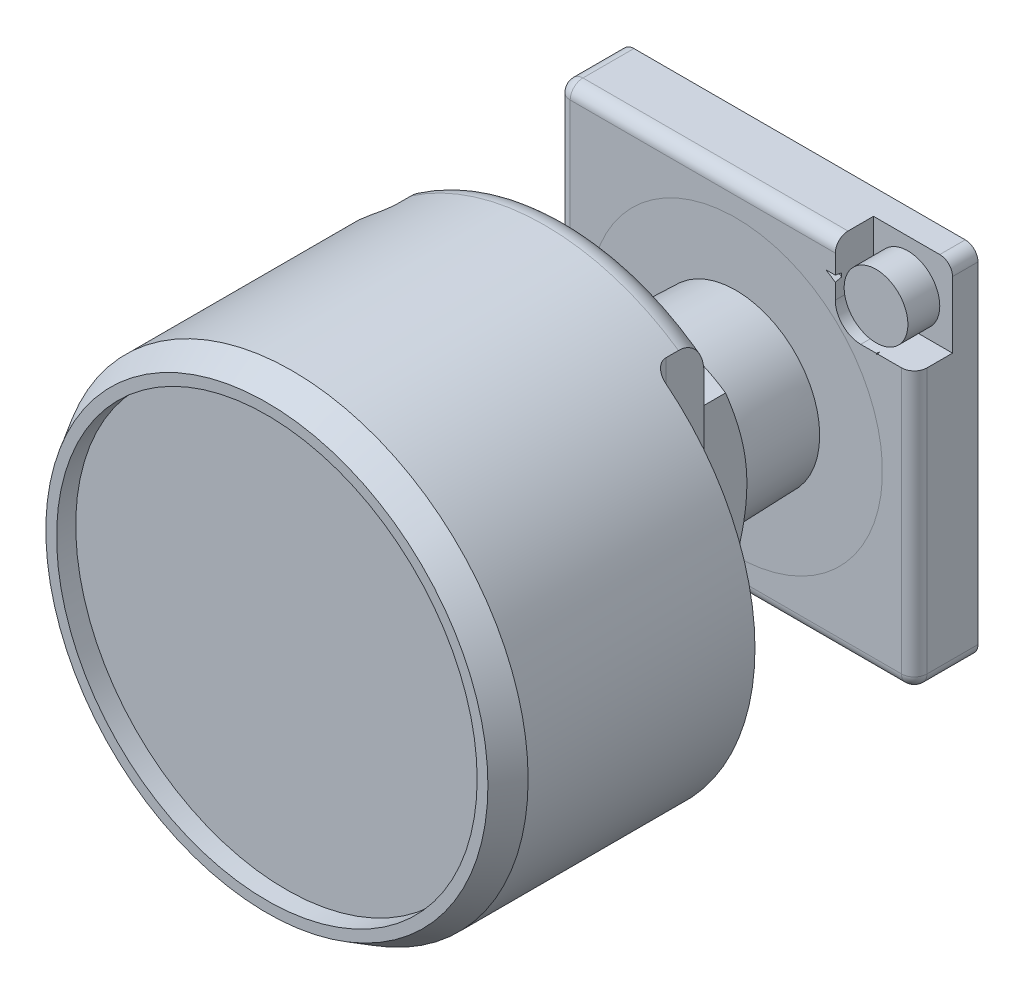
ISO-10303-21;
HEADER;
FILE_DESCRIPTION(('STEP AP214'),'2;1');
FILE_NAME('part.step','',(''),(''),'','','');
FILE_SCHEMA(('AUTOMOTIVE_DESIGN { 1 0 10303 214 1 1 1 1 }'));
ENDSEC;
DATA;
#1=APPLICATION_CONTEXT('core data for automotive mechanical design processes');
#2=APPLICATION_PROTOCOL_DEFINITION('international standard','automotive_design',2000,#1);
#3=PRODUCT_CONTEXT('',#1,'mechanical');
#4=PRODUCT('Part','Part','',(#3));
#5=PRODUCT_RELATED_PRODUCT_CATEGORY('part','',(#4));
#6=PRODUCT_DEFINITION_FORMATION('','',#4);
#7=PRODUCT_DEFINITION_CONTEXT('part definition',#1,'design');
#8=PRODUCT_DEFINITION('design','',#6,#7);
#9=PRODUCT_DEFINITION_SHAPE('','',#8);
#10=(LENGTH_UNIT() NAMED_UNIT(*) SI_UNIT(.MILLI.,.METRE.));
#11=(NAMED_UNIT(*) PLANE_ANGLE_UNIT() SI_UNIT($,.RADIAN.));
#12=(NAMED_UNIT(*) SI_UNIT($,.STERADIAN.) SOLID_ANGLE_UNIT());
#13=UNCERTAINTY_MEASURE_WITH_UNIT(LENGTH_MEASURE(1.E-05),#10,'distance_accuracy_value','');
#14=(GEOMETRIC_REPRESENTATION_CONTEXT(3) GLOBAL_UNCERTAINTY_ASSIGNED_CONTEXT((#13)) GLOBAL_UNIT_ASSIGNED_CONTEXT((#10,
#11,#12)) REPRESENTATION_CONTEXT('',''));
#15=CARTESIAN_POINT('',(0.,0.,0.));
#16=DIRECTION('',(0.,0.,1.));
#17=DIRECTION('',(1.,0.,0.));
#18=AXIS2_PLACEMENT_3D('',#15,#16,#17);
#19=CARTESIAN_POINT('',(0.,0.,15.));
#20=DIRECTION('',(0.,0.,1.));
#21=DIRECTION('',(1.,0.,0.));
#22=AXIS2_PLACEMENT_3D('',#19,#20,#21);
#23=TOROIDAL_SURFACE('',#22,16.5,2.);
#24=CARTESIAN_POINT('',(10.5,-15.0683984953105,14.2800127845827));
#25=CARTESIAN_POINT('',(10.5,-15.0198808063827,14.1768569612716));
#26=CARTESIAN_POINT('',(10.5,-14.9614507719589,14.0783625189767));
#27=CARTESIAN_POINT('',(10.5,-14.8281887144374,13.8932094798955));
#28=CARTESIAN_POINT('',(10.5,-14.7533413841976,13.8065620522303));
#29=CARTESIAN_POINT('',(10.5,-14.5913369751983,13.6470217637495));
#30=CARTESIAN_POINT('',(10.5,-14.5042688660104,13.5740376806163));
#31=CARTESIAN_POINT('',(10.5,-14.3205414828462,13.44151457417));
#32=CARTESIAN_POINT('',(10.5,-14.2238822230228,13.3819755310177));
#33=CARTESIAN_POINT('',(10.5,-14.0087353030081,13.2683991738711));
#34=CARTESIAN_POINT('',(10.5,-13.8891339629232,13.2164792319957));
#35=CARTESIAN_POINT('',(10.5,-13.6439418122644,13.1296272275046));
#36=CARTESIAN_POINT('',(10.5,-13.5183473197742,13.0947057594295));
#37=CARTESIAN_POINT('',(10.5,-13.2376494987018,13.0356285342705));
#38=CARTESIAN_POINT('',(10.5,-13.0817718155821,13.0151437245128));
#39=CARTESIAN_POINT('',(10.5,-12.7686558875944,12.9965261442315));
#40=CARTESIAN_POINT('',(10.5,-12.6114165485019,12.9984134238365));
#41=CARTESIAN_POINT('',(10.5,-12.2722358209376,13.0257364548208));
#42=CARTESIAN_POINT('',(10.5,-12.0906023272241,13.0550912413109));
#43=CARTESIAN_POINT('',(10.5,-11.7342187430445,13.1423503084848));
#44=CARTESIAN_POINT('',(10.5,-11.5594699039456,13.2002597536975));
#45=CARTESIAN_POINT('',(10.5,-11.25228194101,13.332054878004));
#46=CARTESIAN_POINT('',(10.5,-11.1178400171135,13.4012775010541));
#47=CARTESIAN_POINT('',(10.5,-10.8614597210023,13.5599762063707));
#48=CARTESIAN_POINT('',(10.5,-10.7395007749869,13.6494181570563));
#49=CARTESIAN_POINT('',(10.5,-10.5464073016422,13.8208449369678));
#50=CARTESIAN_POINT('',(10.5,-10.4707012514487,13.8976731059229));
#51=CARTESIAN_POINT('',(10.5,-10.3321171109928,14.0621872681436));
#52=CARTESIAN_POINT('',(10.5,-10.2692203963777,14.149857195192));
#53=CARTESIAN_POINT('',(10.5,-10.1712807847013,14.3167531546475));
#54=CARTESIAN_POINT('',(10.5,-10.1331845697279,14.3941765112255));
#55=CARTESIAN_POINT('',(10.5,-10.0702814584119,14.5542740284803));
#56=CARTESIAN_POINT('',(10.5,-10.0454635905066,14.6369437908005));
#57=CARTESIAN_POINT('',(10.5,-10.0110174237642,14.8059831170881));
#58=CARTESIAN_POINT('',(10.5,-10.0014839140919,14.8923723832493));
#59=CARTESIAN_POINT('',(10.5,-9.99883932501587,15.0653979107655));
#60=CARTESIAN_POINT('',(10.5,-10.005725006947,15.1520341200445));
#61=CARTESIAN_POINT('',(10.5,-10.0337953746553,15.3143102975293));
#62=CARTESIAN_POINT('',(10.5,-10.0535424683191,15.3902069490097));
#63=CARTESIAN_POINT('',(10.5,-10.1044631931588,15.5380338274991));
#64=CARTESIAN_POINT('',(10.5,-10.1356417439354,15.6099623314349));
#65=CARTESIAN_POINT('',(10.5,-10.2209432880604,15.7742951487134));
#66=CARTESIAN_POINT('',(10.5,-10.2792875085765,15.8645064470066));
#67=CARTESIAN_POINT('',(10.5,-10.4097647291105,16.0343347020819));
#68=CARTESIAN_POINT('',(10.5,-10.481926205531,16.1139291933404));
#69=CARTESIAN_POINT('',(10.5,-10.6657815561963,16.2904603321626));
#70=CARTESIAN_POINT('',(10.5,-10.7821030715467,16.3825656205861));
#71=CARTESIAN_POINT('',(10.5,-11.0278177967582,16.5471280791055));
#72=CARTESIAN_POINT('',(10.5,-11.1572309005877,16.6195547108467));
#73=CARTESIAN_POINT('',(10.5,-11.4609864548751,16.7624942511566));
#74=CARTESIAN_POINT('',(10.5,-11.6380463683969,16.8272447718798));
#75=CARTESIAN_POINT('',(10.5,-12.0003642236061,16.926875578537));
#76=CARTESIAN_POINT('',(10.5,-12.1856275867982,16.961735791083));
#77=CARTESIAN_POINT('',(10.5,-12.5605827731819,17.0010636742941));
#78=CARTESIAN_POINT('',(10.5,-12.750295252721,17.0053368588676));
#79=CARTESIAN_POINT('',(10.5,-13.1276377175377,16.9813010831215));
#80=CARTESIAN_POINT('',(10.5,-13.3152697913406,16.9530284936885));
#81=CARTESIAN_POINT('',(10.5,-13.641371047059,16.871862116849));
#82=CARTESIAN_POINT('',(10.5,-13.7815432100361,16.8257881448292));
#83=CARTESIAN_POINT('',(10.5,-14.0525805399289,16.7115362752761));
#84=CARTESIAN_POINT('',(10.5,-14.1834581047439,16.6433885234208));
#85=CARTESIAN_POINT('',(10.5,-14.4078503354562,16.4991944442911));
#86=CARTESIAN_POINT('',(10.5,-14.503797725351,16.4269420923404));
#87=CARTESIAN_POINT('',(10.5,-14.682662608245,16.2676426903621));
#88=CARTESIAN_POINT('',(10.5,-14.7655821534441,16.1805979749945));
#89=CARTESIAN_POINT('',(10.5,-14.9150552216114,15.9920743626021));
#90=CARTESIAN_POINT('',(10.5,-14.9814632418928,15.8904787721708));
#91=CARTESIAN_POINT('',(10.5,-15.0927324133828,15.6760792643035));
#92=CARTESIAN_POINT('',(10.5,-15.1376183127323,15.5632884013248));
#93=CARTESIAN_POINT('',(10.5,-15.1976718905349,15.3480088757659));
#94=CARTESIAN_POINT('',(10.5,-15.2162563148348,15.2464683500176));
#95=CARTESIAN_POINT('',(10.5,-15.2342095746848,15.0417200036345));
#96=CARTESIAN_POINT('',(10.5,-15.2335894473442,14.9385131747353));
#97=CARTESIAN_POINT('',(10.5,-15.2137953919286,14.7400544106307));
#98=CARTESIAN_POINT('',(10.5,-15.1957117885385,14.6446909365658));
#99=CARTESIAN_POINT('',(10.5,-15.1436010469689,14.4584360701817));
#100=CARTESIAN_POINT('',(10.5,-15.1095684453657,14.3675462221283));
#101=CARTESIAN_POINT('',(10.5,-15.0683984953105,14.2800127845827));
#102=B_SPLINE_CURVE_WITH_KNOTS('',3,(#24,#25,#26,#27,#28,#29,#30,#31,#32,#33,#34,#35,#36,#37,
#38,#39,#40,#41,#42,#43,#44,#45,#46,#47,#48,#49,#50,#51,#52,#53,#54,#55,#56,#57,#58,#59,#60,#61,
#62,#63,#64,#65,#66,#67,#68,#69,#70,#71,#72,#73,#74,#75,#76,#77,#78,#79,#80,#81,#82,#83,#84,#85,
#86,#87,#88,#89,#90,#91,#92,#93,#94,#95,#96,#97,#98,#99,#100,#101),.UNSPECIFIED.,.T.,.F.,(4,2,2,
2,2,2,2,2,2,2,2,2,2,2,2,2,2,2,2,2,2,2,2,2,2,2,2,2,2,2,2,2,2,2,2,2,2,2,4),(0.,0.341559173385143,
0.683438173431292,1.02294619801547,1.36245372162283,1.75219327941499,2.14217543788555,
2.61204798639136,3.08234167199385,3.631976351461,4.18171047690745,4.63382519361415,
5.08518233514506,5.40772636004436,5.72979801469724,5.9876412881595,6.24527118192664,
6.50449272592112,6.76366314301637,6.99792948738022,7.23229676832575,7.55281920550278,
7.87400946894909,8.31671393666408,8.76010154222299,9.32283341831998,9.88594291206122,
10.4526297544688,11.0186839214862,11.4596756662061,11.9000676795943,12.2589820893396,
12.6178399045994,12.979756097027,13.34125512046,13.6492164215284,13.9570007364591,
14.2467333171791,14.5365652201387),.UNSPECIFIED.);
#103=CARTESIAN_POINT('',(10.5,-15.2315462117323,14.999999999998));
#104=VERTEX_POINT('',#103);
#105=CARTESIAN_POINT('',(10.5,-12.7279220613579,13.));
#106=VERTEX_POINT('',#105);
#107=EDGE_CURVE('E274',#104,#106,#102,.T.);
#108=ORIENTED_EDGE('',*,*,#107,.F.);
#109=CARTESIAN_POINT('',(0.,0.,15.));
#110=DIRECTION('',(0.,0.,1.));
#111=DIRECTION('',(1.,0.,0.));
#112=AXIS2_PLACEMENT_3D('',#109,#110,#111);
#113=CIRCLE('',#112,18.5);
#114=CARTESIAN_POINT('',(-10.5,-15.2315462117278,15.));
#115=VERTEX_POINT('',#114);
#116=EDGE_CURVE('E300',#115,#104,#113,.T.);
#117=ORIENTED_EDGE('',*,*,#116,.F.);
#118=CARTESIAN_POINT('',(-10.5,-15.0683984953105,14.2800127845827));
#119=CARTESIAN_POINT('',(-10.5,-15.1086211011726,14.365545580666));
#120=CARTESIAN_POINT('',(-10.5,-15.1420567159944,14.4543224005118));
#121=CARTESIAN_POINT('',(-10.5,-15.1937146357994,14.6362410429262));
#122=CARTESIAN_POINT('',(-10.5,-15.2119336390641,14.7293838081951));
#123=CARTESIAN_POINT('',(-10.5,-15.2321968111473,14.9175736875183));
#124=CARTESIAN_POINT('',(-10.5,-15.234216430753,15.0126234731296));
#125=CARTESIAN_POINT('',(-10.5,-15.2219005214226,15.2016428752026));
#126=CARTESIAN_POINT('',(-10.5,-15.2075659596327,15.2956125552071));
#127=CARTESIAN_POINT('',(-10.5,-15.1637339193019,15.4780830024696));
#128=CARTESIAN_POINT('',(-10.5,-15.1345198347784,15.5666525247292));
#129=CARTESIAN_POINT('',(-10.5,-15.0624909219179,15.7380467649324));
#130=CARTESIAN_POINT('',(-10.5,-15.0196735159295,15.820870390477));
#131=CARTESIAN_POINT('',(-10.5,-14.9191591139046,15.9841717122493));
#132=CARTESIAN_POINT('',(-10.5,-14.8606972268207,16.0641763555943));
#133=CARTESIAN_POINT('',(-10.5,-14.7327146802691,16.2147461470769));
#134=CARTESIAN_POINT('',(-10.5,-14.6631893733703,16.2853073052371));
#135=CARTESIAN_POINT('',(-10.5,-14.5048554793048,16.4256138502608));
#136=CARTESIAN_POINT('',(-10.5,-14.414710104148,16.4938466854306));
#137=CARTESIAN_POINT('',(-10.5,-14.225782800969,16.6170089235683));
#138=CARTESIAN_POINT('',(-10.5,-14.1269958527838,16.6719305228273));
#139=CARTESIAN_POINT('',(-10.5,-13.9039719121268,16.777793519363));
#140=CARTESIAN_POINT('',(-10.5,-13.7784508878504,16.8260265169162));
#141=CARTESIAN_POINT('',(-10.5,-13.5219813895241,16.9046610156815));
#142=CARTESIAN_POINT('',(-10.5,-13.3910298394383,16.9350522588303));
#143=CARTESIAN_POINT('',(-10.5,-13.0997452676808,16.9832170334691));
#144=CARTESIAN_POINT('',(-10.5,-12.9387886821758,16.9972356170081));
#145=CARTESIAN_POINT('',(-10.5,-12.6164656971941,17.0020281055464));
#146=CARTESIAN_POINT('',(-10.5,-12.4550990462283,16.992778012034));
#147=CARTESIAN_POINT('',(-10.5,-12.1100162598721,16.948678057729));
#148=CARTESIAN_POINT('',(-10.5,-11.9267765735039,16.9100308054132));
#149=CARTESIAN_POINT('',(-10.5,-11.569025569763,16.803196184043));
#150=CARTESIAN_POINT('',(-10.5,-11.3945118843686,16.7350168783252));
#151=CARTESIAN_POINT('',(-10.5,-11.1010757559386,16.5886934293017));
#152=CARTESIAN_POINT('',(-10.5,-10.9789383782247,16.5169802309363));
#153=CARTESIAN_POINT('',(-10.5,-10.7472170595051,16.3554944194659));
#154=CARTESIAN_POINT('',(-10.5,-10.6376118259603,16.265753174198));
#155=CARTESIAN_POINT('',(-10.5,-10.4638461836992,16.0943671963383));
#156=CARTESIAN_POINT('',(-10.5,-10.3954043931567,16.0170741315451));
#157=CARTESIAN_POINT('',(-10.5,-10.2714941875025,15.8526617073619));
#158=CARTESIAN_POINT('',(-10.5,-10.2160075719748,15.7655563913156));
#159=CARTESIAN_POINT('',(-10.5,-10.1306267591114,15.599632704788));
#160=CARTESIAN_POINT('',(-10.5,-10.0978922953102,15.5222849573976));
#161=CARTESIAN_POINT('',(-10.5,-10.0457400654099,15.363204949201));
#162=CARTESIAN_POINT('',(-10.5,-10.0263115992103,15.2814762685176));
#163=CARTESIAN_POINT('',(-10.5,-10.0023024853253,15.1154372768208));
#164=CARTESIAN_POINT('',(-10.5,-9.99779132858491,15.031116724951));
#165=CARTESIAN_POINT('',(-10.5,-10.004238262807,14.8630717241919));
#166=CARTESIAN_POINT('',(-10.5,-10.0151972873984,14.7793473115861));
#167=CARTESIAN_POINT('',(-10.5,-10.0502925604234,14.6209680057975));
#168=CARTESIAN_POINT('',(-10.5,-10.0734455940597,14.5460897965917));
#169=CARTESIAN_POINT('',(-10.5,-10.1306839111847,14.4006739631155));
#170=CARTESIAN_POINT('',(-10.5,-10.1647737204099,14.3301381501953));
#171=CARTESIAN_POINT('',(-10.5,-10.2583215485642,14.1658757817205));
#172=CARTESIAN_POINT('',(-10.5,-10.3224258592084,14.0747947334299));
#173=CARTESIAN_POINT('',(-10.5,-10.4644507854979,13.9041023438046));
#174=CARTESIAN_POINT('',(-10.5,-10.5424034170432,13.8245183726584));
#175=CARTESIAN_POINT('',(-10.5,-10.7400361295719,13.6487812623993));
#176=CARTESIAN_POINT('',(-10.5,-10.8643191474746,13.5578165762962));
#177=CARTESIAN_POINT('',(-10.5,-11.1256364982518,13.3968581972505));
#178=CARTESIAN_POINT('',(-10.5,-11.2626823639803,13.3268837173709));
#179=CARTESIAN_POINT('',(-10.5,-11.5491563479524,13.2054823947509));
#180=CARTESIAN_POINT('',(-10.5,-11.6988210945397,13.1546174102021));
#181=CARTESIAN_POINT('',(-10.5,-12.0037040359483,13.0739682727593));
#182=CARTESIAN_POINT('',(-10.5,-12.1589237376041,13.044189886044));
#183=CARTESIAN_POINT('',(-10.5,-12.5043490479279,13.0021268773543));
#184=CARTESIAN_POINT('',(-10.5,-12.6951700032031,12.9947146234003));
#185=CARTESIAN_POINT('',(-10.5,-13.075358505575,13.0126944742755));
#186=CARTESIAN_POINT('',(-10.5,-13.2647265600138,13.038074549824));
#187=CARTESIAN_POINT('',(-10.5,-13.5950496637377,13.1144879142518));
#188=CARTESIAN_POINT('',(-10.5,-13.7375772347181,13.1587420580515));
#189=CARTESIAN_POINT('',(-10.5,-14.0136167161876,13.2697866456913));
#190=CARTESIAN_POINT('',(-10.5,-14.1471386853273,13.3365514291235));
#191=CARTESIAN_POINT('',(-10.5,-14.3763606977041,13.47860198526));
#192=CARTESIAN_POINT('',(-10.5,-14.4744751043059,13.5499897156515));
#193=CARTESIAN_POINT('',(-10.5,-14.6576526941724,13.7078366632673));
#194=CARTESIAN_POINT('',(-10.5,-14.7427411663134,13.794265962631));
#195=CARTESIAN_POINT('',(-10.5,-14.8685768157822,13.9476664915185));
#196=CARTESIAN_POINT('',(-10.5,-14.9143150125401,14.0105834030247));
#197=CARTESIAN_POINT('',(-10.5,-14.9976968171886,14.1416071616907));
#198=CARTESIAN_POINT('',(-10.5,-15.0353399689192,14.20971430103));
#199=CARTESIAN_POINT('',(-10.5,-15.0683984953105,14.2800127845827));
#200=B_SPLINE_CURVE_WITH_KNOTS('',3,(#118,#119,#120,#121,#122,#123,#124,#125,#126,#127,#128,
#129,#130,#131,#132,#133,#134,#135,#136,#137,#138,#139,#140,#141,#142,#143,#144,#145,#146,#147,
#148,#149,#150,#151,#152,#153,#154,#155,#156,#157,#158,#159,#160,#161,#162,#163,#164,#165,#166,
#167,#168,#169,#170,#171,#172,#173,#174,#175,#176,#177,#178,#179,#180,#181,#182,#183,#184,#185,
#186,#187,#188,#189,#190,#191,#192,#193,#194,#195,#196,#197,#198,#199),.UNSPECIFIED.,.T.,.F.,(4,
2,2,2,2,2,2,2,2,2,2,2,2,2,2,2,2,2,2,2,2,2,2,2,2,2,2,2,2,2,2,2,2,2,2,2,2,2,2,2,4),(0.,
0.283301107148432,0.566663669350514,0.850455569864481,1.13423068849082,1.41279260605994,
1.69140733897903,1.98749907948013,2.28371552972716,2.62162266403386,2.95972741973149,
3.36165586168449,3.76381516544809,4.24666189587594,4.73000682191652,5.28936967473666,
5.84857989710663,6.27211534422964,6.69492014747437,7.00361386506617,7.31187126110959,
7.56281196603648,7.81355063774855,8.06545571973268,8.31737600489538,8.5515401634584,
8.78580134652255,9.11808143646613,9.45113996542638,9.91070619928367,10.3706918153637,
10.8433040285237,11.3160454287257,11.8862505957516,12.4562466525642,12.902285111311,
13.3478168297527,13.7104349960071,14.0723399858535,14.3051689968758,14.538011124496),.UNSPECIFIED.);
#201=CARTESIAN_POINT('',(-10.5,-12.7279220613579,13.));
#202=VERTEX_POINT('',#201);
#203=EDGE_CURVE('E299',#202,#115,#200,.T.);
#204=ORIENTED_EDGE('',*,*,#203,.F.);
#205=CARTESIAN_POINT('',(0.,0.,13.));
#206=DIRECTION('',(0.,0.,1.));
#207=DIRECTION('',(1.,0.,0.));
#208=AXIS2_PLACEMENT_3D('',#205,#206,#207);
#209=CIRCLE('',#208,16.5);
#210=EDGE_CURVE('E291',#106,#202,#209,.F.);
#211=ORIENTED_EDGE('',*,*,#210,.F.);
#212=EDGE_LOOP('',(#108,#117,#204,#211));
#213=FACE_BOUND('',#212,.T.);
#214=ADVANCED_FACE('F36',(#213),#23,.T.);
#215=CARTESIAN_POINT('',(14.,-14.,0.));
#216=DIRECTION('',(0.,0.,-1.));
#217=DIRECTION('',(-1.,0.,0.));
#218=AXIS2_PLACEMENT_3D('',#215,#216,#217);
#219=PLANE('',#218);
#220=DIRECTION('',(0.,-1.,0.));
#221=VECTOR('',#220,1.);
#222=CARTESIAN_POINT('',(7.8,14.,0.));
#223=LINE('',#222,#221);
#224=CARTESIAN_POINT('',(7.8,11.0186206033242,0.));
#225=VERTEX_POINT('',#224);
#226=CARTESIAN_POINT('',(7.8,9.8,0.));
#227=VERTEX_POINT('',#226);
#228=EDGE_CURVE('E785',#225,#227,#223,.T.);
#229=ORIENTED_EDGE('',*,*,#228,.F.);
#230=CARTESIAN_POINT('',(0.,0.,0.));
#231=DIRECTION('',(0.,0.,-1.));
#232=DIRECTION('',(-1.,0.,0.));
#233=AXIS2_PLACEMENT_3D('',#230,#231,#232);
#234=CIRCLE('',#233,13.5);
#235=CARTESIAN_POINT('',(7.07106781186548,11.5,0.));
#236=VERTEX_POINT('',#235);
#237=EDGE_CURVE('E523',#236,#225,#234,.T.);
#238=ORIENTED_EDGE('',*,*,#237,.F.);
#239=DIRECTION('',(-1.,0.,0.));
#240=VECTOR('',#239,1.);
#241=CARTESIAN_POINT('',(7.07106781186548,11.5,0.));
#242=LINE('',#241,#240);
#243=CARTESIAN_POINT('',(7.8,11.5,0.));
#244=VERTEX_POINT('',#243);
#245=EDGE_CURVE('E527',#244,#236,#242,.T.);
#246=ORIENTED_EDGE('',*,*,#245,.F.);
#247=CARTESIAN_POINT('',(7.8,13.,0.));
#248=VERTEX_POINT('',#247);
#249=EDGE_CURVE('E803',#248,#244,#223,.T.);
#250=ORIENTED_EDGE('',*,*,#249,.F.);
#251=DIRECTION('',(-1.,0.,0.));
#252=VECTOR('',#251,1.);
#253=CARTESIAN_POINT('',(-14.,13.,0.));
#254=LINE('',#253,#252);
#255=CARTESIAN_POINT('',(-13.,13.,0.));
#256=VERTEX_POINT('',#255);
#257=EDGE_CURVE('E318',#248,#256,#254,.T.);
#258=ORIENTED_EDGE('',*,*,#257,.T.);
#259=DIRECTION('',(0.,-1.,0.));
#260=VECTOR('',#259,1.);
#261=CARTESIAN_POINT('',(-13.,-14.,0.));
#262=LINE('',#261,#260);
#263=CARTESIAN_POINT('',(-13.,-7.80000000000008,0.));
#264=VERTEX_POINT('',#263);
#265=EDGE_CURVE('E302',#256,#264,#262,.T.);
#266=ORIENTED_EDGE('',*,*,#265,.T.);
#267=DIRECTION('',(-1.,0.,0.));
#268=VECTOR('',#267,1.);
#269=CARTESIAN_POINT('',(-13.9999999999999,-7.80000000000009,0.));
#270=LINE('',#269,#268);
#271=CARTESIAN_POINT('',(-9.79999999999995,-7.80000000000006,0.));
#272=VERTEX_POINT('',#271);
#273=EDGE_CURVE('E846',#272,#264,#270,.T.);
#274=ORIENTED_EDGE('',*,*,#273,.F.);
#275=CARTESIAN_POINT('',(-9.79999999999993,-9.80000000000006,0.));
#276=DIRECTION('',(0.,0.,1.));
#277=DIRECTION('',(-1.,0.,0.));
#278=AXIS2_PLACEMENT_3D('',#275,#276,#277);
#279=CIRCLE('',#278,2.);
#280=CARTESIAN_POINT('',(-7.79999999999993,-9.80000000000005,0.));
#281=VERTEX_POINT('',#280);
#282=EDGE_CURVE('E879',#281,#272,#279,.T.);
#283=ORIENTED_EDGE('',*,*,#282,.F.);
#284=DIRECTION('',(0.,1.,0.));
#285=VECTOR('',#284,1.);
#286=CARTESIAN_POINT('',(-7.7999999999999,-14.,0.));
#287=LINE('',#286,#285);
#288=CARTESIAN_POINT('',(-7.79999999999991,-13.,0.));
#289=VERTEX_POINT('',#288);
#290=EDGE_CURVE('E877',#289,#281,#287,.T.);
#291=ORIENTED_EDGE('',*,*,#290,.F.);
#292=DIRECTION('',(1.,0.,0.));
#293=VECTOR('',#292,1.);
#294=CARTESIAN_POINT('',(14.,-13.,0.));
#295=LINE('',#294,#293);
#296=CARTESIAN_POINT('',(13.,-13.,0.));
#297=VERTEX_POINT('',#296);
#298=EDGE_CURVE('E313',#289,#297,#295,.T.);
#299=ORIENTED_EDGE('',*,*,#298,.T.);
#300=DIRECTION('',(0.,1.,0.));
#301=VECTOR('',#300,1.);
#302=CARTESIAN_POINT('',(13.,14.,0.));
#303=LINE('',#302,#301);
#304=CARTESIAN_POINT('',(13.,7.8,0.));
#305=VERTEX_POINT('',#304);
#306=EDGE_CURVE('E315',#297,#305,#303,.T.);
#307=ORIENTED_EDGE('',*,*,#306,.T.);
#308=DIRECTION('',(1.,0.,0.));
#309=VECTOR('',#308,1.);
#310=CARTESIAN_POINT('',(14.,7.8,0.));
#311=LINE('',#310,#309);
#312=CARTESIAN_POINT('',(11.1395544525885,7.8,0.));
#313=VERTEX_POINT('',#312);
#314=EDGE_CURVE('E809',#313,#305,#311,.T.);
#315=ORIENTED_EDGE('',*,*,#314,.F.);
#316=DIRECTION('',(0.819152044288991,0.573576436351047,0.));
#317=VECTOR('',#316,1.);
#318=CARTESIAN_POINT('',(12.2872806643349,8.60364654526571,0.));
#319=LINE('',#318,#317);
#320=CARTESIAN_POINT('',(11.0585525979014,7.74328189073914,0.));
#321=VERTEX_POINT('',#320);
#322=EDGE_CURVE('E525',#321,#313,#319,.T.);
#323=ORIENTED_EDGE('',*,*,#322,.F.);
#324=CARTESIAN_POINT('',(11.0186206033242,7.8,0.));
#325=VERTEX_POINT('',#324);
#326=EDGE_CURVE('E522',#325,#321,#234,.T.);
#327=ORIENTED_EDGE('',*,*,#326,.F.);
#328=CARTESIAN_POINT('',(9.8,7.8,0.));
#329=VERTEX_POINT('',#328);
#330=EDGE_CURVE('E792',#329,#325,#311,.T.);
#331=ORIENTED_EDGE('',*,*,#330,.F.);
#332=CARTESIAN_POINT('',(9.8,9.8,0.));
#333=DIRECTION('',(0.,0.,1.));
#334=DIRECTION('',(1.,0.,0.));
#335=AXIS2_PLACEMENT_3D('',#332,#333,#334);
#336=CIRCLE('',#335,2.);
#337=EDGE_CURVE('E806',#227,#329,#336,.T.);
#338=ORIENTED_EDGE('',*,*,#337,.F.);
#339=EDGE_LOOP('',(#229,#238,#246,#250,#258,#266,#274,#283,#291,#299,#307,#315,#323,#327,#331,#338));
#340=FACE_BOUND('',#339,.T.);
#341=CARTESIAN_POINT('',(0.,0.,0.));
#342=DIRECTION('',(0.,0.,-1.));
#343=DIRECTION('',(-1.,0.,0.));
#344=AXIS2_PLACEMENT_3D('',#341,#342,#343);
#345=CIRCLE('',#344,11.5);
#346=CARTESIAN_POINT('',(-11.5,0.,0.));
#347=VERTEX_POINT('',#346);
#348=EDGE_CURVE('E390',#347,#347,#345,.F.);
#349=ORIENTED_EDGE('',*,*,#348,.F.);
#350=EDGE_LOOP('',(#349));
#351=FACE_BOUND('',#350,.T.);
#352=ADVANCED_FACE('F481',(#340,#351),#219,.F.);
#353=CARTESIAN_POINT('',(-9.79999999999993,-9.80000000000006,-3.));
#354=DIRECTION('',(0.,0.,1.));
#355=DIRECTION('',(-1.,0.,0.));
#356=AXIS2_PLACEMENT_3D('',#353,#354,#355);
#357=PLANE('',#356);
#358=DIRECTION('',(1.,0.,0.));
#359=VECTOR('',#358,1.);
#360=CARTESIAN_POINT('',(-13.9999999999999,-14.0000000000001,-3.));
#361=LINE('',#360,#359);
#362=CARTESIAN_POINT('',(-13.,-14.0000000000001,-3.));
#363=VERTEX_POINT('',#362);
#364=CARTESIAN_POINT('',(-7.7999999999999,-14.,-3.));
#365=VERTEX_POINT('',#364);
#366=EDGE_CURVE('E768',#363,#365,#361,.T.);
#367=ORIENTED_EDGE('',*,*,#366,.T.);
#368=DIRECTION('',(0.,1.,0.));
#369=VECTOR('',#368,1.);
#370=CARTESIAN_POINT('',(-7.7999999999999,-14.,-3.));
#371=LINE('',#370,#369);
#372=CARTESIAN_POINT('',(-7.79999999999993,-9.80000000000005,-3.));
#373=VERTEX_POINT('',#372);
#374=EDGE_CURVE('E900',#365,#373,#371,.T.);
#375=ORIENTED_EDGE('',*,*,#374,.T.);
#376=CARTESIAN_POINT('',(-9.79999999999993,-9.80000000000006,-3.));
#377=DIRECTION('',(0.,0.,1.));
#378=DIRECTION('',(-1.,0.,0.));
#379=AXIS2_PLACEMENT_3D('',#376,#377,#378);
#380=CIRCLE('',#379,2.);
#381=CARTESIAN_POINT('',(-9.79999999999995,-7.80000000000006,-3.));
#382=VERTEX_POINT('',#381);
#383=EDGE_CURVE('E778',#373,#382,#380,.T.);
#384=ORIENTED_EDGE('',*,*,#383,.T.);
#385=DIRECTION('',(-1.,0.,0.));
#386=VECTOR('',#385,1.);
#387=CARTESIAN_POINT('',(-13.9999999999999,-7.80000000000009,-3.));
#388=LINE('',#387,#386);
#389=CARTESIAN_POINT('',(-13.9999999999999,-7.80000000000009,-3.));
#390=VERTEX_POINT('',#389);
#391=EDGE_CURVE('E772',#382,#390,#388,.T.);
#392=ORIENTED_EDGE('',*,*,#391,.T.);
#393=DIRECTION('',(0.,-1.,0.));
#394=VECTOR('',#393,1.);
#395=CARTESIAN_POINT('',(-13.9999999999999,-14.0000000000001,-3.));
#396=LINE('',#395,#394);
#397=CARTESIAN_POINT('',(-13.9999999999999,-13.,-3.));
#398=VERTEX_POINT('',#397);
#399=EDGE_CURVE('E889',#390,#398,#396,.T.);
#400=ORIENTED_EDGE('',*,*,#399,.T.);
#401=CARTESIAN_POINT('',(-13.,-13.,-3.));
#402=DIRECTION('',(0.,0.,1.));
#403=DIRECTION('',(1.,0.,0.));
#404=AXIS2_PLACEMENT_3D('',#401,#402,#403);
#405=CIRCLE('',#404,1.);
#406=EDGE_CURVE('E385',#363,#398,#405,.F.);
#407=ORIENTED_EDGE('',*,*,#406,.F.);
#408=EDGE_LOOP('',(#367,#375,#384,#392,#400,#407));
#409=FACE_BOUND('',#408,.T.);
#410=CARTESIAN_POINT('',(-10.4999999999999,-10.5000000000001,-3.));
#411=DIRECTION('',(0.,0.,1.));
#412=DIRECTION('',(-1.,0.,0.));
#413=AXIS2_PLACEMENT_3D('',#410,#411,#412);
#414=CIRCLE('',#413,2.5);
#415=CARTESIAN_POINT('',(-12.9999999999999,-10.5000000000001,-3.));
#416=VERTEX_POINT('',#415);
#417=EDGE_CURVE('E884',#416,#416,#414,.T.);
#418=ORIENTED_EDGE('',*,*,#417,.F.);
#419=EDGE_LOOP('',(#418));
#420=FACE_BOUND('',#419,.T.);
#421=ADVANCED_FACE('F485',(#409,#420),#357,.T.);
#422=CARTESIAN_POINT('',(-13.,-13.,-5.));
#423=DIRECTION('',(0.,0.,1.));
#424=DIRECTION('',(1.,0.,0.));
#425=AXIS2_PLACEMENT_3D('',#422,#423,#424);
#426=CYLINDRICAL_SURFACE('',#425,1.);
#427=DIRECTION('',(0.,0.,1.));
#428=VECTOR('',#427,1.);
#429=CARTESIAN_POINT('',(-13.,-14.,-5.));
#430=LINE('',#429,#428);
#431=CARTESIAN_POINT('',(-13.,-14.,-5.));
#432=VERTEX_POINT('',#431);
#433=EDGE_CURVE('E342',#363,#432,#430,.F.);
#434=ORIENTED_EDGE('',*,*,#433,.F.);
#435=ORIENTED_EDGE('',*,*,#406,.T.);
#436=DIRECTION('',(0.,0.,1.));
#437=VECTOR('',#436,1.);
#438=CARTESIAN_POINT('',(-14.,-13.,-5.));
#439=LINE('',#438,#437);
#440=CARTESIAN_POINT('',(-14.,-13.,-5.));
#441=VERTEX_POINT('',#440);
#442=EDGE_CURVE('E353',#441,#398,#439,.T.);
#443=ORIENTED_EDGE('',*,*,#442,.F.);
#444=CARTESIAN_POINT('',(-13.,-13.,-5.));
#445=DIRECTION('',(0.,0.,-1.));
#446=DIRECTION('',(-1.,0.,0.));
#447=AXIS2_PLACEMENT_3D('',#444,#445,#446);
#448=CIRCLE('',#447,1.);
#449=EDGE_CURVE('E336',#432,#441,#448,.T.);
#450=ORIENTED_EDGE('',*,*,#449,.F.);
#451=EDGE_LOOP('',(#434,#435,#443,#450));
#452=FACE_BOUND('',#451,.T.);
#453=ADVANCED_FACE('F1090',(#452),#426,.T.);
#454=CARTESIAN_POINT('',(9.8,9.8,-3.));
#455=DIRECTION('',(0.,0.,1.));
#456=DIRECTION('',(1.,0.,0.));
#457=AXIS2_PLACEMENT_3D('',#454,#455,#456);
#458=PLANE('',#457);
#459=DIRECTION('',(-1.,0.,0.));
#460=VECTOR('',#459,1.);
#461=CARTESIAN_POINT('',(14.,14.,-3.));
#462=LINE('',#461,#460);
#463=CARTESIAN_POINT('',(13.,14.,-3.));
#464=VERTEX_POINT('',#463);
#465=CARTESIAN_POINT('',(7.8,14.,-3.));
#466=VERTEX_POINT('',#465);
#467=EDGE_CURVE('E791',#464,#466,#462,.T.);
#468=ORIENTED_EDGE('',*,*,#467,.T.);
#469=DIRECTION('',(0.,-1.,0.));
#470=VECTOR('',#469,1.);
#471=CARTESIAN_POINT('',(7.8,14.,-3.));
#472=LINE('',#471,#470);
#473=CARTESIAN_POINT('',(7.8,9.8,-3.));
#474=VERTEX_POINT('',#473);
#475=EDGE_CURVE('E794',#466,#474,#472,.T.);
#476=ORIENTED_EDGE('',*,*,#475,.T.);
#477=CARTESIAN_POINT('',(9.8,9.8,-3.));
#478=DIRECTION('',(0.,0.,1.));
#479=DIRECTION('',(1.,0.,0.));
#480=AXIS2_PLACEMENT_3D('',#477,#478,#479);
#481=CIRCLE('',#480,2.);
#482=CARTESIAN_POINT('',(9.8,7.8,-3.));
#483=VERTEX_POINT('',#482);
#484=EDGE_CURVE('E797',#474,#483,#481,.T.);
#485=ORIENTED_EDGE('',*,*,#484,.T.);
#486=DIRECTION('',(1.,0.,0.));
#487=VECTOR('',#486,1.);
#488=CARTESIAN_POINT('',(14.,7.8,-3.));
#489=LINE('',#488,#487);
#490=CARTESIAN_POINT('',(14.,7.8,-3.));
#491=VERTEX_POINT('',#490);
#492=EDGE_CURVE('E800',#483,#491,#489,.T.);
#493=ORIENTED_EDGE('',*,*,#492,.T.);
#494=DIRECTION('',(0.,1.,0.));
#495=VECTOR('',#494,1.);
#496=CARTESIAN_POINT('',(14.,14.,-3.));
#497=LINE('',#496,#495);
#498=CARTESIAN_POINT('',(14.,13.,-3.));
#499=VERTEX_POINT('',#498);
#500=EDGE_CURVE('E739',#491,#499,#497,.T.);
#501=ORIENTED_EDGE('',*,*,#500,.T.);
#502=CARTESIAN_POINT('',(13.,13.,-3.));
#503=DIRECTION('',(0.,0.,1.));
#504=DIRECTION('',(1.,0.,0.));
#505=AXIS2_PLACEMENT_3D('',#502,#503,#504);
#506=CIRCLE('',#505,1.);
#507=EDGE_CURVE('E380',#464,#499,#506,.F.);
#508=ORIENTED_EDGE('',*,*,#507,.F.);
#509=EDGE_LOOP('',(#468,#476,#485,#493,#501,#508));
#510=FACE_BOUND('',#509,.T.);
#511=CARTESIAN_POINT('',(10.5,10.5,-3.));
#512=DIRECTION('',(0.,0.,1.));
#513=DIRECTION('',(1.,0.,0.));
#514=AXIS2_PLACEMENT_3D('',#511,#512,#513);
#515=CIRCLE('',#514,2.5);
#516=CARTESIAN_POINT('',(13.,10.5,-3.));
#517=VERTEX_POINT('',#516);
#518=EDGE_CURVE('E786',#517,#517,#515,.T.);
#519=ORIENTED_EDGE('',*,*,#518,.F.);
#520=EDGE_LOOP('',(#519));
#521=FACE_BOUND('',#520,.T.);
#522=ADVANCED_FACE('F713',(#510,#521),#458,.T.);
#523=CARTESIAN_POINT('',(13.,13.,-5.));
#524=DIRECTION('',(0.,0.,1.));
#525=DIRECTION('',(1.,0.,0.));
#526=AXIS2_PLACEMENT_3D('',#523,#524,#525);
#527=CYLINDRICAL_SURFACE('',#526,1.);
#528=DIRECTION('',(0.,0.,1.));
#529=VECTOR('',#528,1.);
#530=CARTESIAN_POINT('',(13.,14.,-5.));
#531=LINE('',#530,#529);
#532=CARTESIAN_POINT('',(13.,14.,-5.));
#533=VERTEX_POINT('',#532);
#534=EDGE_CURVE('E325',#464,#533,#531,.F.);
#535=ORIENTED_EDGE('',*,*,#534,.F.);
#536=ORIENTED_EDGE('',*,*,#507,.T.);
#537=DIRECTION('',(0.,0.,1.));
#538=VECTOR('',#537,1.);
#539=CARTESIAN_POINT('',(14.,13.,-5.));
#540=LINE('',#539,#538);
#541=CARTESIAN_POINT('',(14.,13.,-5.));
#542=VERTEX_POINT('',#541);
#543=EDGE_CURVE('E331',#542,#499,#540,.T.);
#544=ORIENTED_EDGE('',*,*,#543,.F.);
#545=CARTESIAN_POINT('',(13.,13.,-5.));
#546=DIRECTION('',(0.,0.,-1.));
#547=DIRECTION('',(-1.,0.,0.));
#548=AXIS2_PLACEMENT_3D('',#545,#546,#547);
#549=CIRCLE('',#548,1.);
#550=EDGE_CURVE('E340',#533,#542,#549,.T.);
#551=ORIENTED_EDGE('',*,*,#550,.F.);
#552=EDGE_LOOP('',(#535,#536,#544,#551));
#553=FACE_BOUND('',#552,.T.);
#554=ADVANCED_FACE('F706',(#553),#527,.T.);
#555=CARTESIAN_POINT('',(0.,0.,-5.));
#556=DIRECTION('',(0.,0.,1.));
#557=DIRECTION('',(1.,0.,0.));
#558=AXIS2_PLACEMENT_3D('',#555,#556,#557);
#559=CONICAL_SURFACE('',#558,6.4231157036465,0.0310668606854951);
#560=CARTESIAN_POINT('',(0.,0.,6.));
#561=DIRECTION('',(0.,0.,1.));
#562=DIRECTION('',(1.,0.,0.));
#563=AXIS2_PLACEMENT_3D('',#560,#561,#562);
#564=CIRCLE('',#563,6.76496115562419);
#565=CARTESIAN_POINT('',(6.76496115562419,0.,6.));
#566=VERTEX_POINT('',#565);
#567=EDGE_CURVE('E613',#566,#566,#564,.T.);
#568=ORIENTED_EDGE('',*,*,#567,.F.);
#569=EDGE_LOOP('',(#568));
#570=FACE_BOUND('',#569,.T.);
#571=CARTESIAN_POINT('',(0.,0.,0.));
#572=DIRECTION('',(0.,0.,-1.));
#573=DIRECTION('',(-1.,0.,0.));
#574=AXIS2_PLACEMENT_3D('',#571,#572,#573);
#575=CIRCLE('',#574,6.5785);
#576=CARTESIAN_POINT('',(-6.5785,0.,0.));
#577=VERTEX_POINT('',#576);
#578=EDGE_CURVE('E306',#577,#577,#575,.F.);
#579=ORIENTED_EDGE('',*,*,#578,.T.);
#580=EDGE_LOOP('',(#579));
#581=FACE_BOUND('',#580,.T.);
#582=ADVANCED_FACE('F703',(#570,#581),#559,.T.);
#583=CARTESIAN_POINT('',(-7.,-7.,32.7989898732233));
#584=DIRECTION('',(0.,1.,0.));
#585=DIRECTION('',(-1.,0.,0.));
#586=AXIS2_PLACEMENT_3D('',#583,#584,#585);
#587=PLANE('',#586);
#588=DIRECTION('',(0.,0.,-1.));
#589=VECTOR('',#588,1.);
#590=CARTESIAN_POINT('',(-7.,-7.,32.7989898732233));
#591=LINE('',#590,#589);
#592=CARTESIAN_POINT('',(-7.,-7.,13.));
#593=VERTEX_POINT('',#592);
#594=CARTESIAN_POINT('',(-7.,-7.,7.80972392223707));
#595=VERTEX_POINT('',#594);
#596=EDGE_CURVE('E667',#593,#595,#591,.T.);
#597=ORIENTED_EDGE('',*,*,#596,.T.);
#598=CARTESIAN_POINT('',(-13.7140232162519,-7.,10.9838378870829));
#599=CARTESIAN_POINT('',(-13.376323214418,-7.,10.8102084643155));
#600=CARTESIAN_POINT('',(-13.0381017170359,-7.,10.6375831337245));
#601=CARTESIAN_POINT('',(-12.3603447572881,-7.,10.2948774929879));
#602=CARTESIAN_POINT('',(-12.0208092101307,-7.,10.1247973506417));
#603=CARTESIAN_POINT('',(-11.3393742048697,-7.,9.78733417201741));
#604=CARTESIAN_POINT('',(-10.9974710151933,-7.,9.61995865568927));
#605=CARTESIAN_POINT('',(-10.3117937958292,-7.,9.28909826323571));
#606=CARTESIAN_POINT('',(-9.96801981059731,-7.,9.12561329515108));
#607=CARTESIAN_POINT('',(-9.25921320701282,-7.,8.79467472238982));
#608=CARTESIAN_POINT('',(-8.89405120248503,-7.,8.62749731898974));
#609=CARTESIAN_POINT('',(-8.16054886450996,-7.,8.30016874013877));
#610=CARTESIAN_POINT('',(-7.79220832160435,-7.,8.1400180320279));
#611=CARTESIAN_POINT('',(-7.05195159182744,-7.,7.82909853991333));
#612=CARTESIAN_POINT('',(-6.68003889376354,-7.,7.67832150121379));
#613=CARTESIAN_POINT('',(-5.93149116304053,-7.,7.38906340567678));
#614=CARTESIAN_POINT('',(-5.55485692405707,-7.,7.25058031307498));
#615=CARTESIAN_POINT('',(-4.80003662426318,-7.,6.99150196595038));
#616=CARTESIAN_POINT('',(-4.42191314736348,-7.,6.87072679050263));
#617=CARTESIAN_POINT('',(-3.65936848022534,-7.,6.65063401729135));
#618=CARTESIAN_POINT('',(-3.27494723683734,-7.,6.55131660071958));
#619=CARTESIAN_POINT('',(-2.50715486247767,-7.,6.38232326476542));
#620=CARTESIAN_POINT('',(-2.12390492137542,-7.,6.31211552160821));
#621=CARTESIAN_POINT('',(-1.54562567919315,-7.,6.23163197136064));
#622=CARTESIAN_POINT('',(-1.35229175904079,-7.,6.20894177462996));
#623=CARTESIAN_POINT('',(-0.964797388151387,-7.,6.17241469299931));
#624=CARTESIAN_POINT('',(-0.770637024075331,-7.,6.1585769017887));
#625=CARTESIAN_POINT('',(-0.343008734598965,-7.,6.13832437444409));
#626=CARTESIAN_POINT('',(-0.109440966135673,-7.,6.13394615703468));
#627=CARTESIAN_POINT('',(0.357559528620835,-7.,6.13872262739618));
#628=CARTESIAN_POINT('',(0.590992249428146,-7.,6.14787783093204));
#629=CARTESIAN_POINT('',(1.05701359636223,-7.,6.17933037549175));
#630=CARTESIAN_POINT('',(1.28960201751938,-7.,6.20163071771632));
#631=CARTESIAN_POINT('',(1.75326409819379,-7.,6.25848382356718));
#632=CARTESIAN_POINT('',(1.98433771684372,-7.,6.29303691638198));
#633=CARTESIAN_POINT('',(2.45077396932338,-7.,6.37425940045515));
#634=CARTESIAN_POINT('',(2.68608338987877,-7.,6.42123144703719));
#635=CARTESIAN_POINT('',(3.15442689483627,-7.,6.52533788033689));
#636=CARTESIAN_POINT('',(3.38746092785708,-7.,6.58247249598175));
#637=CARTESIAN_POINT('',(3.85129119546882,-7.,6.70546518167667));
#638=CARTESIAN_POINT('',(4.08208655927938,-7.,6.77132651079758));
#639=CARTESIAN_POINT('',(4.54142002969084,-7.,6.91041005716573));
#640=CARTESIAN_POINT('',(4.76995826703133,-7.,6.98363184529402));
#641=CARTESIAN_POINT('',(5.21296371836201,-7.,7.1322441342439));
#642=CARTESIAN_POINT('',(5.42753797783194,-7.,7.20731720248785));
#643=CARTESIAN_POINT('',(5.85498372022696,-7.,7.36217550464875));
#644=CARTESIAN_POINT('',(6.06785512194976,-7.,7.44196096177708));
#645=CARTESIAN_POINT('',(6.70426177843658,-7.,7.68730986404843));
#646=CARTESIAN_POINT('',(7.12549910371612,-7.,7.85883482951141));
#647=CARTESIAN_POINT('',(7.96348180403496,-7.,8.21350629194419));
#648=CARTESIAN_POINT('',(8.38022237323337,-7.,8.39666401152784));
#649=CARTESIAN_POINT('',(9.2098187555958,-7.,8.77142525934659));
#650=CARTESIAN_POINT('',(9.62267499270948,-7.,8.96302785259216));
#651=CARTESIAN_POINT('',(10.4467751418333,-7.,9.35325169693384));
#652=CARTESIAN_POINT('',(10.858008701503,-7.,9.55189472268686));
#653=CARTESIAN_POINT('',(11.6780799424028,-7.,9.95407784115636));
#654=CARTESIAN_POINT('',(12.0869175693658,-7.,10.1576180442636));
#655=CARTESIAN_POINT('',(12.9024443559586,-7.,10.5683926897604));
#656=CARTESIAN_POINT('',(13.3091345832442,-7.,10.7756250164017));
#657=CARTESIAN_POINT('',(14.1209587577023,-7.,11.1931033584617));
#658=CARTESIAN_POINT('',(14.5260927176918,-7.,11.4033493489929));
#659=CARTESIAN_POINT('',(15.6307523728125,-7.,11.9807987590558));
#660=CARTESIAN_POINT('',(16.3290208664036,-7.,12.3504060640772));
#661=CARTESIAN_POINT('',(17.7229522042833,-7.,13.0947503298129));
#662=CARTESIAN_POINT('',(18.4186146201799,-7.,13.4694880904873));
#663=CARTESIAN_POINT('',(19.8031304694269,-7.,14.2200841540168));
#664=CARTESIAN_POINT('',(20.4919977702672,-6.99999999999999,14.5959168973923));
#665=CARTESIAN_POINT('',(21.5240989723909,-6.99999999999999,15.1617044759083));
#666=CARTESIAN_POINT('',(21.8679018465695,-6.99999999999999,15.3506229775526));
#667=CARTESIAN_POINT('',(22.5551711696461,-6.99999999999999,15.7290696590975));
#668=CARTESIAN_POINT('',(22.8986376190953,-6.99999999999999,15.9185978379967));
#669=CARTESIAN_POINT('',(23.2419577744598,-6.99999999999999,16.1083907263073));
#670=B_SPLINE_CURVE_WITH_KNOTS('',3,(#598,#599,#600,#601,#602,#603,#604,#605,#606,#607,#608,
#609,#610,#611,#612,#613,#614,#615,#616,#617,#618,#619,#620,#621,#622,#623,#624,#625,#626,#627,
#628,#629,#630,#631,#632,#633,#634,#635,#636,#637,#638,#639,#640,#641,#642,#643,#644,#645,#646,
#647,#648,#649,#650,#651,#652,#653,#654,#655,#656,#657,#658,#659,#660,#661,#662,#663,#664,#665,
#666,#667,#668,#669),.UNSPECIFIED.,.F.,.F.,(4,2,2,2,2,2,2,2,2,2,2,2,2,2,2,2,2,2,2,2,2,2,2,2,2,2,
2,2,2,2,2,2,2,2,2,4),(0.,1.13916996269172,2.27841470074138,3.42041540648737,4.56238909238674,
5.76716597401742,6.97202286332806,8.1758032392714,9.3793839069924,10.5697323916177,
11.7600909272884,12.9276259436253,13.5114340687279,14.0951824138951,14.7956081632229,
15.4960606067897,16.1966730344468,16.897304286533,17.6169007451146,18.3365134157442,
19.0563955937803,19.7762358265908,20.4581562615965,21.1401090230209,22.5043009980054,
23.8698296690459,25.2352075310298,26.6052578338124,27.9753390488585,29.3446589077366,
30.7139674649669,33.0841016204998,35.4546096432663,37.8087662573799,38.985632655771,
40.1624971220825),.UNSPECIFIED.);
#671=CARTESIAN_POINT('',(7.,-7.,7.80972392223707));
#672=VERTEX_POINT('',#671);
#673=EDGE_CURVE('E660',#595,#672,#670,.T.);
#674=ORIENTED_EDGE('',*,*,#673,.T.);
#675=DIRECTION('',(0.,0.,-1.));
#676=VECTOR('',#675,1.);
#677=CARTESIAN_POINT('',(7.,-7.,32.7989898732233));
#678=LINE('',#677,#676);
#679=CARTESIAN_POINT('',(7.,-7.,13.));
#680=VERTEX_POINT('',#679);
#681=EDGE_CURVE('E681',#680,#672,#678,.T.);
#682=ORIENTED_EDGE('',*,*,#681,.F.);
#683=DIRECTION('',(1.,0.,0.));
#684=VECTOR('',#683,1.);
#685=CARTESIAN_POINT('',(-7.,-7.,13.));
#686=LINE('',#685,#684);
#687=EDGE_CURVE('E674',#593,#680,#686,.T.);
#688=ORIENTED_EDGE('',*,*,#687,.F.);
#689=EDGE_LOOP('',(#597,#674,#682,#688));
#690=FACE_BOUND('',#689,.T.);
#691=ADVANCED_FACE('F649',(#690),#587,.F.);
#692=CARTESIAN_POINT('',(7.,-7.,32.7989898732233));
#693=DIRECTION('',(-1.,0.,0.));
#694=DIRECTION('',(0.,-1.,0.));
#695=AXIS2_PLACEMENT_3D('',#692,#693,#694);
#696=PLANE('',#695);
#697=ORIENTED_EDGE('',*,*,#681,.T.);
#698=CARTESIAN_POINT('',(7.,-13.7140232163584,10.9838378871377));
#699=CARTESIAN_POINT('',(7.,-13.3763232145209,10.8102084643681));
#700=CARTESIAN_POINT('',(7.,-13.0381017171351,10.6375831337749));
#701=CARTESIAN_POINT('',(7.,-12.36034475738,10.294877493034));
#702=CARTESIAN_POINT('',(7.,-12.0208092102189,10.1247973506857));
#703=CARTESIAN_POINT('',(7.,-11.3393742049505,9.78733417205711));
#704=CARTESIAN_POINT('',(7.,-10.9974710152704,9.61995865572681));
#705=CARTESIAN_POINT('',(7.,-10.3117937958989,9.28909826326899));
#706=CARTESIAN_POINT('',(7.,-9.96801981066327,9.12561329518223));
#707=CARTESIAN_POINT('',(7.,-9.25921320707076,8.79467472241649));
#708=CARTESIAN_POINT('',(7.,-8.89405120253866,8.62749731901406));
#709=CARTESIAN_POINT('',(7.,-8.16054886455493,8.30016874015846));
#710=CARTESIAN_POINT('',(7.,-7.79220832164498,8.14001803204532));
#711=CARTESIAN_POINT('',(7.,-7.05195159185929,7.82909853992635));
#712=CARTESIAN_POINT('',(7.,-6.68003889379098,7.67832150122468));
#713=CARTESIAN_POINT('',(7.,-5.93149116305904,7.38906340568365));
#714=CARTESIAN_POINT('',(7.,-5.55485692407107,7.25058031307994));
#715=CARTESIAN_POINT('',(7.,-4.80003662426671,6.99150196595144));
#716=CARTESIAN_POINT('',(7.,-4.42191314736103,6.87072679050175));
#717=CARTESIAN_POINT('',(7.,-3.65936848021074,6.65063401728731));
#718=CARTESIAN_POINT('',(7.,-3.27494723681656,6.55131660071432));
#719=CARTESIAN_POINT('',(7.,-2.50715486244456,6.3823232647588));
#720=CARTESIAN_POINT('',(7.,-2.12390492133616,6.31211552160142));
#721=CARTESIAN_POINT('',(7.,-1.54562567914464,6.23163197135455));
#722=CARTESIAN_POINT('',(7.,-1.35229175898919,6.20894177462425));
#723=CARTESIAN_POINT('',(7.,-0.964797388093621,6.1724146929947));
#724=CARTESIAN_POINT('',(7.,-0.770637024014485,6.1585769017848));
#725=CARTESIAN_POINT('',(7.,-0.343008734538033,6.13832437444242));
#726=CARTESIAN_POINT('',(7.,-0.109440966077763,6.13394615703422));
#727=CARTESIAN_POINT('',(7.,0.357559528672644,6.13872262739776));
#728=CARTESIAN_POINT('',(7.,0.590992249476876,6.14787783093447));
#729=CARTESIAN_POINT('',(7.,1.05701359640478,6.17933037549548));
#730=CARTESIAN_POINT('',(7.,1.28960201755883,6.20163071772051));
#731=CARTESIAN_POINT('',(7.,1.75326409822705,6.2584838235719));
#732=CARTESIAN_POINT('',(7.,1.98433771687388,6.29303691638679));
#733=CARTESIAN_POINT('',(7.,2.45077396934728,6.37425940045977));
#734=CARTESIAN_POINT('',(7.,2.68608338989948,6.42123144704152));
#735=CARTESIAN_POINT('',(7.,3.15442689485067,6.52533788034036));
#736=CARTESIAN_POINT('',(7.,3.38746092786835,6.58247249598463));
#737=CARTESIAN_POINT('',(7.,3.85129119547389,6.70546518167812));
#738=CARTESIAN_POINT('',(7.,4.08208655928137,6.7713265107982));
#739=CARTESIAN_POINT('',(7.,4.54142002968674,6.91041005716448));
#740=CARTESIAN_POINT('',(7.,4.76995826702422,6.98363184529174));
#741=CARTESIAN_POINT('',(7.,5.21296371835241,7.13224413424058));
#742=CARTESIAN_POINT('',(7.,5.42753797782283,7.20731720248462));
#743=CARTESIAN_POINT('',(7.,5.85498372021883,7.36217550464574));
#744=CARTESIAN_POINT('',(7.,6.06785512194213,7.44196096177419));
#745=CARTESIAN_POINT('',(7.,6.7042617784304,7.68730986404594));
#746=CARTESIAN_POINT('',(7.,7.12549910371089,7.85883482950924));
#747=CARTESIAN_POINT('',(7.,7.96348180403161,8.21350629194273));
#748=CARTESIAN_POINT('',(7.,8.38022237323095,8.39666401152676));
#749=CARTESIAN_POINT('',(7.,9.20981875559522,8.77142525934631));
#750=CARTESIAN_POINT('',(7.,9.62267499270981,8.96302785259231));
#751=CARTESIAN_POINT('',(7.,10.4467751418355,9.35325169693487));
#752=CARTESIAN_POINT('',(7.,10.8580087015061,9.55189472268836));
#753=CARTESIAN_POINT('',(7.,11.6780799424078,9.95407784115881));
#754=CARTESIAN_POINT('',(7.,12.0869175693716,10.1576180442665));
#755=CARTESIAN_POINT('',(7.,12.9024443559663,10.5683926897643));
#756=CARTESIAN_POINT('',(7.,13.3091345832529,10.7756250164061));
#757=CARTESIAN_POINT('',(7.,14.1209587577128,11.1931033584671));
#758=CARTESIAN_POINT('',(7.,14.5260927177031,11.4033493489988));
#759=CARTESIAN_POINT('',(7.,15.6307523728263,11.9807987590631));
#760=CARTESIAN_POINT('',(7.,16.3290208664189,12.3504060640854));
#761=CARTESIAN_POINT('',(7.,17.7229522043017,13.0947503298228));
#762=CARTESIAN_POINT('',(7.,18.4186146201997,13.469488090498));
#763=CARTESIAN_POINT('',(7.,19.8031304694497,14.2200841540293));
#764=CARTESIAN_POINT('',(7.,20.4919977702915,14.5959168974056));
#765=CARTESIAN_POINT('',(7.,21.5240989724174,15.1617044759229));
#766=CARTESIAN_POINT('',(7.,21.8679018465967,15.3506229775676));
#767=CARTESIAN_POINT('',(7.,22.5551711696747,15.7290696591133));
#768=CARTESIAN_POINT('',(7.,22.8986376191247,15.918597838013));
#769=CARTESIAN_POINT('',(7.,23.2419577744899,16.1083907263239));
#770=B_SPLINE_CURVE_WITH_KNOTS('',3,(#698,#699,#700,#701,#702,#703,#704,#705,#706,#707,#708,
#709,#710,#711,#712,#713,#714,#715,#716,#717,#718,#719,#720,#721,#722,#723,#724,#725,#726,#727,
#728,#729,#730,#731,#732,#733,#734,#735,#736,#737,#738,#739,#740,#741,#742,#743,#744,#745,#746,
#747,#748,#749,#750,#751,#752,#753,#754,#755,#756,#757,#758,#759,#760,#761,#762,#763,#764,#765,
#766,#767,#768,#769),.UNSPECIFIED.,.F.,.F.,(4,2,2,2,2,2,2,2,2,2,2,2,2,2,2,2,2,2,2,2,2,2,2,2,2,2,
2,2,2,2,2,2,2,2,2,4),(0.,1.13916996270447,2.27841470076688,3.42041540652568,4.56238909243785,
5.76716597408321,6.97202286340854,8.17580323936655,9.37938390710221,10.5697323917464,
11.7600909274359,12.9276259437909,13.5114340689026,14.0951824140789,14.7956081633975,
15.4960606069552,16.1966730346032,16.8973042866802,17.6169007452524,18.3365134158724,
19.056395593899,19.7762358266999,20.4581562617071,21.140109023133,22.5043009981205,
23.869829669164,25.2352075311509,26.6052578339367,27.9753390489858,29.3446589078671,
30.7139674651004,33.0841016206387,35.4546096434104,37.8087662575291,38.9856326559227,
40.1624971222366),.UNSPECIFIED.);
#771=CARTESIAN_POINT('',(7.,7.,7.80972392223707));
#772=VERTEX_POINT('',#771);
#773=EDGE_CURVE('E653',#672,#772,#770,.T.);
#774=ORIENTED_EDGE('',*,*,#773,.T.);
#775=DIRECTION('',(0.,0.,-1.));
#776=VECTOR('',#775,1.);
#777=CARTESIAN_POINT('',(7.,7.,32.7989898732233));
#778=LINE('',#777,#776);
#779=CARTESIAN_POINT('',(7.,7.,13.));
#780=VERTEX_POINT('',#779);
#781=EDGE_CURVE('E684',#780,#772,#778,.T.);
#782=ORIENTED_EDGE('',*,*,#781,.F.);
#783=DIRECTION('',(0.,1.,0.));
#784=VECTOR('',#783,1.);
#785=CARTESIAN_POINT('',(7.,-7.,13.));
#786=LINE('',#785,#784);
#787=EDGE_CURVE('E671',#680,#780,#786,.T.);
#788=ORIENTED_EDGE('',*,*,#787,.F.);
#789=EDGE_LOOP('',(#697,#774,#782,#788));
#790=FACE_BOUND('',#789,.T.);
#791=ADVANCED_FACE('F644',(#790),#696,.F.);
#792=CARTESIAN_POINT('',(7.,7.,32.7989898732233));
#793=DIRECTION('',(0.,-1.,0.));
#794=DIRECTION('',(1.,0.,0.));
#795=AXIS2_PLACEMENT_3D('',#792,#793,#794);
#796=PLANE('',#795);
#797=ORIENTED_EDGE('',*,*,#781,.T.);
#798=CARTESIAN_POINT('',(-13.7140232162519,7.,10.9838378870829));
#799=CARTESIAN_POINT('',(-13.376323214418,7.,10.8102084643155));
#800=CARTESIAN_POINT('',(-13.0381017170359,7.,10.6375831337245));
#801=CARTESIAN_POINT('',(-12.3603447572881,7.,10.2948774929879));
#802=CARTESIAN_POINT('',(-12.0208092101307,7.,10.1247973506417));
#803=CARTESIAN_POINT('',(-11.3393742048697,7.,9.78733417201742));
#804=CARTESIAN_POINT('',(-10.9974710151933,7.,9.61995865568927));
#805=CARTESIAN_POINT('',(-10.3117937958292,7.,9.28909826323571));
#806=CARTESIAN_POINT('',(-9.96801981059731,7.,9.12561329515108));
#807=CARTESIAN_POINT('',(-9.25921320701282,7.,8.79467472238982));
#808=CARTESIAN_POINT('',(-8.89405120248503,7.,8.62749731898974));
#809=CARTESIAN_POINT('',(-8.16054886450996,7.,8.30016874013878));
#810=CARTESIAN_POINT('',(-7.79220832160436,7.,8.1400180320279));
#811=CARTESIAN_POINT('',(-7.05195159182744,7.,7.82909853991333));
#812=CARTESIAN_POINT('',(-6.68003889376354,7.,7.67832150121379));
#813=CARTESIAN_POINT('',(-5.93149116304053,7.,7.38906340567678));
#814=CARTESIAN_POINT('',(-5.55485692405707,7.,7.25058031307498));
#815=CARTESIAN_POINT('',(-4.80003662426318,7.,6.99150196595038));
#816=CARTESIAN_POINT('',(-4.42191314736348,7.,6.87072679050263));
#817=CARTESIAN_POINT('',(-3.65936848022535,7.,6.65063401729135));
#818=CARTESIAN_POINT('',(-3.27494723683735,7.,6.55131660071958));
#819=CARTESIAN_POINT('',(-2.50715486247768,7.,6.38232326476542));
#820=CARTESIAN_POINT('',(-2.12390492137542,7.,6.31211552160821));
#821=CARTESIAN_POINT('',(-1.54562567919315,7.,6.23163197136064));
#822=CARTESIAN_POINT('',(-1.3522917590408,7.,6.20894177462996));
#823=CARTESIAN_POINT('',(-0.964797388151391,7.,6.17241469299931));
#824=CARTESIAN_POINT('',(-0.770637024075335,7.,6.1585769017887));
#825=CARTESIAN_POINT('',(-0.343008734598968,7.,6.13832437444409));
#826=CARTESIAN_POINT('',(-0.109440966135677,7.,6.13394615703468));
#827=CARTESIAN_POINT('',(0.357559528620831,7.,6.13872262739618));
#828=CARTESIAN_POINT('',(0.590992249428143,7.,6.14787783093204));
#829=CARTESIAN_POINT('',(1.05701359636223,7.,6.17933037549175));
#830=CARTESIAN_POINT('',(1.28960201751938,7.,6.20163071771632));
#831=CARTESIAN_POINT('',(1.75326409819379,7.,6.25848382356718));
#832=CARTESIAN_POINT('',(1.98433771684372,7.,6.29303691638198));
#833=CARTESIAN_POINT('',(2.45077396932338,7.,6.37425940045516));
#834=CARTESIAN_POINT('',(2.68608338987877,7.,6.42123144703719));
#835=CARTESIAN_POINT('',(3.15442689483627,7.,6.5253378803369));
#836=CARTESIAN_POINT('',(3.38746092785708,7.,6.58247249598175));
#837=CARTESIAN_POINT('',(3.85129119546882,7.,6.70546518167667));
#838=CARTESIAN_POINT('',(4.08208655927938,7.,6.77132651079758));
#839=CARTESIAN_POINT('',(4.54142002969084,7.,6.91041005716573));
#840=CARTESIAN_POINT('',(4.76995826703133,7.,6.98363184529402));
#841=CARTESIAN_POINT('',(5.21296371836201,7.,7.1322441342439));
#842=CARTESIAN_POINT('',(5.42753797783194,7.,7.20731720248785));
#843=CARTESIAN_POINT('',(5.85498372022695,7.,7.36217550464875));
#844=CARTESIAN_POINT('',(6.06785512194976,7.,7.44196096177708));
#845=CARTESIAN_POINT('',(6.70426177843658,7.,7.68730986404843));
#846=CARTESIAN_POINT('',(7.12549910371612,7.,7.85883482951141));
#847=CARTESIAN_POINT('',(7.96348180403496,7.,8.21350629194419));
#848=CARTESIAN_POINT('',(8.38022237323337,7.,8.39666401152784));
#849=CARTESIAN_POINT('',(9.2098187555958,7.,8.77142525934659));
#850=CARTESIAN_POINT('',(9.62267499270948,7.,8.96302785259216));
#851=CARTESIAN_POINT('',(10.4467751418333,7.,9.35325169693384));
#852=CARTESIAN_POINT('',(10.858008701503,7.,9.55189472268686));
#853=CARTESIAN_POINT('',(11.6780799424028,7.,9.95407784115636));
#854=CARTESIAN_POINT('',(12.0869175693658,7.,10.1576180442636));
#855=CARTESIAN_POINT('',(12.9024443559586,7.,10.5683926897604));
#856=CARTESIAN_POINT('',(13.3091345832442,7.,10.7756250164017));
#857=CARTESIAN_POINT('',(14.1209587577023,7.,11.1931033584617));
#858=CARTESIAN_POINT('',(14.5260927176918,7.,11.4033493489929));
#859=CARTESIAN_POINT('',(15.6307523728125,7.,11.9807987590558));
#860=CARTESIAN_POINT('',(16.3290208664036,7.,12.3504060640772));
#861=CARTESIAN_POINT('',(17.7229522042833,7.,13.0947503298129));
#862=CARTESIAN_POINT('',(18.4186146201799,7.,13.4694880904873));
#863=CARTESIAN_POINT('',(19.8031304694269,7.,14.2200841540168));
#864=CARTESIAN_POINT('',(20.4919977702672,7.,14.5959168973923));
#865=CARTESIAN_POINT('',(21.5240989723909,7.,15.1617044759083));
#866=CARTESIAN_POINT('',(21.8679018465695,7.,15.3506229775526));
#867=CARTESIAN_POINT('',(22.5551711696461,7.,15.7290696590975));
#868=CARTESIAN_POINT('',(22.8986376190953,7.,15.9185978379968));
#869=CARTESIAN_POINT('',(23.2419577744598,7.,16.1083907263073));
#870=B_SPLINE_CURVE_WITH_KNOTS('',3,(#798,#799,#800,#801,#802,#803,#804,#805,#806,#807,#808,
#809,#810,#811,#812,#813,#814,#815,#816,#817,#818,#819,#820,#821,#822,#823,#824,#825,#826,#827,
#828,#829,#830,#831,#832,#833,#834,#835,#836,#837,#838,#839,#840,#841,#842,#843,#844,#845,#846,
#847,#848,#849,#850,#851,#852,#853,#854,#855,#856,#857,#858,#859,#860,#861,#862,#863,#864,#865,
#866,#867,#868,#869),.UNSPECIFIED.,.F.,.F.,(4,2,2,2,2,2,2,2,2,2,2,2,2,2,2,2,2,2,2,2,2,2,2,2,2,2,
2,2,2,2,2,2,2,2,2,4),(0.,1.13916996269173,2.27841470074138,3.42041540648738,4.56238909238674,
5.76716597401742,6.97202286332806,8.1758032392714,9.3793839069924,10.5697323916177,
11.7600909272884,12.9276259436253,13.5114340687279,14.0951824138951,14.7956081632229,
15.4960606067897,16.1966730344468,16.897304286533,17.6169007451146,18.3365134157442,
19.0563955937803,19.7762358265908,20.4581562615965,21.1401090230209,22.5043009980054,
23.8698296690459,25.2352075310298,26.6052578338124,27.9753390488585,29.3446589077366,
30.7139674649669,33.0841016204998,35.4546096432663,37.8087662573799,38.9856326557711,
40.1624971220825),.UNSPECIFIED.);
#871=CARTESIAN_POINT('',(-7.,7.,7.80972392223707));
#872=VERTEX_POINT('',#871);
#873=EDGE_CURVE('E629',#772,#872,#870,.F.);
#874=ORIENTED_EDGE('',*,*,#873,.T.);
#875=DIRECTION('',(0.,0.,-1.));
#876=VECTOR('',#875,1.);
#877=CARTESIAN_POINT('',(-7.,7.,32.7989898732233));
#878=LINE('',#877,#876);
#879=CARTESIAN_POINT('',(-7.,7.,13.));
#880=VERTEX_POINT('',#879);
#881=EDGE_CURVE('E680',#880,#872,#878,.T.);
#882=ORIENTED_EDGE('',*,*,#881,.F.);
#883=DIRECTION('',(-1.,0.,0.));
#884=VECTOR('',#883,1.);
#885=CARTESIAN_POINT('',(7.,7.,13.));
#886=LINE('',#885,#884);
#887=EDGE_CURVE('E668',#780,#880,#886,.T.);
#888=ORIENTED_EDGE('',*,*,#887,.F.);
#889=EDGE_LOOP('',(#797,#874,#882,#888));
#890=FACE_BOUND('',#889,.T.);
#891=ADVANCED_FACE('F639',(#890),#796,.F.);
#892=CARTESIAN_POINT('',(-7.,7.,32.7989898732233));
#893=DIRECTION('',(1.,0.,0.));
#894=DIRECTION('',(0.,1.,0.));
#895=AXIS2_PLACEMENT_3D('',#892,#893,#894);
#896=PLANE('',#895);
#897=ORIENTED_EDGE('',*,*,#881,.T.);
#898=CARTESIAN_POINT('',(-7.,-13.7140232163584,10.9838378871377));
#899=CARTESIAN_POINT('',(-7.,-13.3763232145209,10.8102084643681));
#900=CARTESIAN_POINT('',(-7.,-13.0381017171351,10.6375831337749));
#901=CARTESIAN_POINT('',(-7.,-12.36034475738,10.294877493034));
#902=CARTESIAN_POINT('',(-7.,-12.0208092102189,10.1247973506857));
#903=CARTESIAN_POINT('',(-7.,-11.3393742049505,9.7873341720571));
#904=CARTESIAN_POINT('',(-7.,-10.9974710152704,9.61995865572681));
#905=CARTESIAN_POINT('',(-7.,-10.3117937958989,9.28909826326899));
#906=CARTESIAN_POINT('',(-7.,-9.96801981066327,9.12561329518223));
#907=CARTESIAN_POINT('',(-7.,-9.25921320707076,8.79467472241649));
#908=CARTESIAN_POINT('',(-7.,-8.89405120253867,8.62749731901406));
#909=CARTESIAN_POINT('',(-7.,-8.16054886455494,8.30016874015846));
#910=CARTESIAN_POINT('',(-7.,-7.79220832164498,8.14001803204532));
#911=CARTESIAN_POINT('',(-7.,-7.0519515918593,7.82909853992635));
#912=CARTESIAN_POINT('',(-7.,-6.68003889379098,7.67832150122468));
#913=CARTESIAN_POINT('',(-7.,-5.93149116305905,7.38906340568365));
#914=CARTESIAN_POINT('',(-7.,-5.55485692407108,7.25058031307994));
#915=CARTESIAN_POINT('',(-7.,-4.80003662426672,6.99150196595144));
#916=CARTESIAN_POINT('',(-7.,-4.42191314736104,6.87072679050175));
#917=CARTESIAN_POINT('',(-7.,-3.65936848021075,6.65063401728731));
#918=CARTESIAN_POINT('',(-7.,-3.27494723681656,6.55131660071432));
#919=CARTESIAN_POINT('',(-7.,-2.50715486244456,6.3823232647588));
#920=CARTESIAN_POINT('',(-7.,-2.12390492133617,6.31211552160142));
#921=CARTESIAN_POINT('',(-7.,-1.54562567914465,6.23163197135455));
#922=CARTESIAN_POINT('',(-7.,-1.3522917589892,6.20894177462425));
#923=CARTESIAN_POINT('',(-7.,-0.964797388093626,6.1724146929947));
#924=CARTESIAN_POINT('',(-7.,-0.77063702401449,6.1585769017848));
#925=CARTESIAN_POINT('',(-7.,-0.343008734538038,6.13832437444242));
#926=CARTESIAN_POINT('',(-7.,-0.109440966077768,6.13394615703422));
#927=CARTESIAN_POINT('',(-7.,0.35755952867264,6.13872262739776));
#928=CARTESIAN_POINT('',(-7.,0.590992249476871,6.14787783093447));
#929=CARTESIAN_POINT('',(-7.,1.05701359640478,6.17933037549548));
#930=CARTESIAN_POINT('',(-7.,1.28960201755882,6.20163071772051));
#931=CARTESIAN_POINT('',(-7.,1.75326409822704,6.2584838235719));
#932=CARTESIAN_POINT('',(-7.,1.98433771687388,6.29303691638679));
#933=CARTESIAN_POINT('',(-7.,2.45077396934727,6.37425940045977));
#934=CARTESIAN_POINT('',(-7.,2.68608338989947,6.42123144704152));
#935=CARTESIAN_POINT('',(-7.,3.15442689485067,6.52533788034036));
#936=CARTESIAN_POINT('',(-7.,3.38746092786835,6.58247249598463));
#937=CARTESIAN_POINT('',(-7.,3.85129119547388,6.70546518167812));
#938=CARTESIAN_POINT('',(-7.,4.08208655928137,6.7713265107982));
#939=CARTESIAN_POINT('',(-7.,4.54142002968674,6.91041005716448));
#940=CARTESIAN_POINT('',(-7.,4.76995826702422,6.98363184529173));
#941=CARTESIAN_POINT('',(-7.,5.2129637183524,7.13224413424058));
#942=CARTESIAN_POINT('',(-7.,5.42753797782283,7.20731720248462));
#943=CARTESIAN_POINT('',(-7.,5.85498372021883,7.36217550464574));
#944=CARTESIAN_POINT('',(-7.,6.06785512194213,7.44196096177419));
#945=CARTESIAN_POINT('',(-7.,6.7042617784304,7.68730986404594));
#946=CARTESIAN_POINT('',(-7.,7.12549910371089,7.85883482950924));
#947=CARTESIAN_POINT('',(-7.,7.96348180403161,8.21350629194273));
#948=CARTESIAN_POINT('',(-7.,8.38022237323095,8.39666401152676));
#949=CARTESIAN_POINT('',(-7.,9.20981875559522,8.77142525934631));
#950=CARTESIAN_POINT('',(-7.,9.62267499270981,8.96302785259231));
#951=CARTESIAN_POINT('',(-7.,10.4467751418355,9.35325169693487));
#952=CARTESIAN_POINT('',(-7.,10.8580087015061,9.55189472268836));
#953=CARTESIAN_POINT('',(-7.,11.6780799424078,9.95407784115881));
#954=CARTESIAN_POINT('',(-7.,12.0869175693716,10.1576180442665));
#955=CARTESIAN_POINT('',(-7.,12.9024443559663,10.5683926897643));
#956=CARTESIAN_POINT('',(-7.,13.3091345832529,10.7756250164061));
#957=CARTESIAN_POINT('',(-7.,14.1209587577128,11.1931033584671));
#958=CARTESIAN_POINT('',(-7.,14.5260927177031,11.4033493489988));
#959=CARTESIAN_POINT('',(-7.,15.6307523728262,11.9807987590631));
#960=CARTESIAN_POINT('',(-7.,16.3290208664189,12.3504060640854));
#961=CARTESIAN_POINT('',(-7.,17.7229522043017,13.0947503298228));
#962=CARTESIAN_POINT('',(-7.,18.4186146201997,13.469488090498));
#963=CARTESIAN_POINT('',(-7.,19.8031304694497,14.2200841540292));
#964=CARTESIAN_POINT('',(-7.,20.4919977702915,14.5959168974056));
#965=CARTESIAN_POINT('',(-7.,21.5240989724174,15.1617044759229));
#966=CARTESIAN_POINT('',(-7.,21.8679018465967,15.3506229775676));
#967=CARTESIAN_POINT('',(-7.,22.5551711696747,15.7290696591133));
#968=CARTESIAN_POINT('',(-7.,22.8986376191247,15.918597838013));
#969=CARTESIAN_POINT('',(-7.00000000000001,23.2419577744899,16.1083907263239));
#970=B_SPLINE_CURVE_WITH_KNOTS('',3,(#898,#899,#900,#901,#902,#903,#904,#905,#906,#907,#908,
#909,#910,#911,#912,#913,#914,#915,#916,#917,#918,#919,#920,#921,#922,#923,#924,#925,#926,#927,
#928,#929,#930,#931,#932,#933,#934,#935,#936,#937,#938,#939,#940,#941,#942,#943,#944,#945,#946,
#947,#948,#949,#950,#951,#952,#953,#954,#955,#956,#957,#958,#959,#960,#961,#962,#963,#964,#965,
#966,#967,#968,#969),.UNSPECIFIED.,.F.,.F.,(4,2,2,2,2,2,2,2,2,2,2,2,2,2,2,2,2,2,2,2,2,2,2,2,2,2,
2,2,2,2,2,2,2,2,2,4),(0.,1.13916996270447,2.27841470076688,3.42041540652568,4.56238909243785,
5.76716597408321,6.97202286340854,8.17580323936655,9.37938390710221,10.5697323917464,
11.7600909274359,12.9276259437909,13.5114340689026,14.0951824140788,14.7956081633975,
15.4960606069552,16.1966730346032,16.8973042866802,17.6169007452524,18.3365134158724,
19.056395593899,19.7762358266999,20.4581562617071,21.140109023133,22.5043009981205,
23.869829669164,25.2352075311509,26.6052578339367,27.9753390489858,29.344658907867,
30.7139674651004,33.0841016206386,35.4546096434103,37.808766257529,38.9856326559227,
40.1624971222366),.UNSPECIFIED.);
#971=EDGE_CURVE('E616',#872,#595,#970,.F.);
#972=ORIENTED_EDGE('',*,*,#971,.T.);
#973=ORIENTED_EDGE('',*,*,#596,.F.);
#974=DIRECTION('',(0.,-1.,0.));
#975=VECTOR('',#974,1.);
#976=CARTESIAN_POINT('',(-7.,7.,13.));
#977=LINE('',#976,#975);
#978=EDGE_CURVE('E677',#880,#593,#977,.T.);
#979=ORIENTED_EDGE('',*,*,#978,.F.);
#980=EDGE_LOOP('',(#897,#972,#973,#979));
#981=FACE_BOUND('',#980,.T.);
#982=ADVANCED_FACE('F636',(#981),#896,.F.);
#983=CARTESIAN_POINT('',(0.,0.,6.));
#984=DIRECTION('',(0.,0.,1.));
#985=DIRECTION('',(1.,0.,0.));
#986=AXIS2_PLACEMENT_3D('',#983,#984,#985);
#987=CONICAL_SURFACE('',#986,6.76496115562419,1.0471975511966);
#988=ORIENTED_EDGE('',*,*,#567,.T.);
#989=EDGE_LOOP('',(#988));
#990=FACE_BOUND('',#989,.T.);
#991=ORIENTED_EDGE('',*,*,#971,.F.);
#992=ORIENTED_EDGE('',*,*,#873,.F.);
#993=ORIENTED_EDGE('',*,*,#773,.F.);
#994=ORIENTED_EDGE('',*,*,#673,.F.);
#995=EDGE_LOOP('',(#991,#992,#993,#994));
#996=FACE_BOUND('',#995,.T.);
#997=ADVANCED_FACE('F456',(#990,#996),#987,.T.);
#998=CARTESIAN_POINT('',(0.,0.,13.));
#999=DIRECTION('',(0.,0.,1.));
#1000=DIRECTION('',(1.,0.,0.));
#1001=AXIS2_PLACEMENT_3D('',#998,#999,#1000);
#1002=PLANE('',#1001);
#1003=CARTESIAN_POINT('',(-10.5,12.7279220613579,13.));
#1004=VERTEX_POINT('',#1003);
#1005=CARTESIAN_POINT('',(10.5,12.7279220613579,13.));
#1006=VERTEX_POINT('',#1005);
#1007=EDGE_CURVE('E294',#1004,#1006,#209,.F.);
#1008=ORIENTED_EDGE('',*,*,#1007,.T.);
#1009=DIRECTION('',(0.,1.,0.));
#1010=VECTOR('',#1009,1.);
#1011=CARTESIAN_POINT('',(10.5,-18.5,13.));
#1012=LINE('',#1011,#1010);
#1013=EDGE_CURVE('E56',#106,#1006,#1012,.T.);
#1014=ORIENTED_EDGE('',*,*,#1013,.F.);
#1015=ORIENTED_EDGE('',*,*,#210,.T.);
#1016=DIRECTION('',(0.,1.,0.));
#1017=VECTOR('',#1016,1.);
#1018=CARTESIAN_POINT('',(-10.5,-18.5,13.));
#1019=LINE('',#1018,#1017);
#1020=EDGE_CURVE('E510',#202,#1004,#1019,.T.);
#1021=ORIENTED_EDGE('',*,*,#1020,.T.);
#1022=EDGE_LOOP('',(#1008,#1014,#1015,#1021));
#1023=FACE_BOUND('',#1022,.T.);
#1024=ORIENTED_EDGE('',*,*,#978,.T.);
#1025=ORIENTED_EDGE('',*,*,#687,.T.);
#1026=ORIENTED_EDGE('',*,*,#787,.T.);
#1027=ORIENTED_EDGE('',*,*,#887,.T.);
#1028=EDGE_LOOP('',(#1024,#1025,#1026,#1027));
#1029=FACE_BOUND('',#1028,.T.);
#1030=ADVANCED_FACE('F288',(#1023,#1029),#1002,.F.);
#1031=CARTESIAN_POINT('',(0.,0.,36.8));
#1032=DIRECTION('',(0.,0.,-1.));
#1033=DIRECTION('',(-1.,0.,0.));
#1034=AXIS2_PLACEMENT_3D('',#1031,#1032,#1033);
#1035=CYLINDRICAL_SURFACE('',#1034,18.5);
#1036=CARTESIAN_POINT('',(0.,0.,34.8));
#1037=DIRECTION('',(0.,0.,1.));
#1038=DIRECTION('',(1.,0.,0.));
#1039=AXIS2_PLACEMENT_3D('',#1036,#1037,#1038);
#1040=CIRCLE('',#1039,18.5);
#1041=CARTESIAN_POINT('',(18.5,0.,34.8));
#1042=VERTEX_POINT('',#1041);
#1043=EDGE_CURVE('E397',#1042,#1042,#1040,.F.);
#1044=ORIENTED_EDGE('',*,*,#1043,.T.);
#1045=EDGE_LOOP('',(#1044));
#1046=FACE_BOUND('',#1045,.T.);
#1047=CARTESIAN_POINT('',(11.5,14.4913767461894,17.));
#1048=CARTESIAN_POINT('',(11.4335977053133,14.5440715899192,17.0000003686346));
#1049=CARTESIAN_POINT('',(11.3668126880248,14.5963211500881,16.9933989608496));
#1050=CARTESIAN_POINT('',(11.2341713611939,14.6986531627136,16.9663934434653));
#1051=CARTESIAN_POINT('',(11.1683161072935,14.7487332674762,16.9459747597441));
#1052=CARTESIAN_POINT('',(11.0515921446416,14.8363285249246,16.8956594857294));
#1053=CARTESIAN_POINT('',(11.0001700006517,14.8744762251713,16.8681504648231));
#1054=CARTESIAN_POINT('',(10.9012555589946,14.947119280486,16.8031167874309));
#1055=CARTESIAN_POINT('',(10.8537570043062,14.9816204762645,16.765608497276));
#1056=CARTESIAN_POINT('',(10.7725914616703,15.0400573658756,16.6880759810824));
#1057=CARTESIAN_POINT('',(10.7379618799,15.0647836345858,16.6496588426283));
#1058=CARTESIAN_POINT('',(10.6741495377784,15.1100649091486,16.5663221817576));
#1059=CARTESIAN_POINT('',(10.6449657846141,15.1306206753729,16.5214038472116));
#1060=CARTESIAN_POINT('',(10.5933805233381,15.1667826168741,16.4254733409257));
#1061=CARTESIAN_POINT('',(10.5710321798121,15.1823500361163,16.3744175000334));
#1062=CARTESIAN_POINT('',(10.5349351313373,15.2074203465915,16.2679532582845));
#1063=CARTESIAN_POINT('',(10.5211783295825,15.216928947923,16.2125490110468));
#1064=CARTESIAN_POINT('',(10.5045153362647,15.2284353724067,16.1070946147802));
#1065=CARTESIAN_POINT('',(10.5004006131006,15.2312699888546,16.0573239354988));
#1066=CARTESIAN_POINT('',(10.4996558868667,15.2317834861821,15.9577093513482));
#1067=CARTESIAN_POINT('',(10.5030226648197,15.2294645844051,15.907865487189));
#1068=CARTESIAN_POINT('',(10.5165460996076,15.2201286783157,15.8130240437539));
#1069=CARTESIAN_POINT('',(10.5262328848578,15.2134367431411,15.7679254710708));
#1070=CARTESIAN_POINT('',(10.5514106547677,15.1959851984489,15.6802179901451));
#1071=CARTESIAN_POINT('',(10.566902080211,15.1852252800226,15.6376092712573));
#1072=CARTESIAN_POINT('',(10.60377987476,15.1594979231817,15.5539356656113));
#1073=CARTESIAN_POINT('',(10.6253996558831,15.1443632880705,15.5130259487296));
#1074=CARTESIAN_POINT('',(10.6732623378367,15.1106693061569,15.4355707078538));
#1075=CARTESIAN_POINT('',(10.6995070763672,15.0921085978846,15.3990269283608));
#1076=CARTESIAN_POINT('',(10.7593373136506,15.0495240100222,15.326268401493));
#1077=CARTESIAN_POINT('',(10.7934331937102,15.025104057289,15.2907070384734));
#1078=CARTESIAN_POINT('',(10.865149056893,14.9733261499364,15.2258515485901));
#1079=CARTESIAN_POINT('',(10.9027710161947,14.9459665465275,15.1965609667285));
#1080=CARTESIAN_POINT('',(10.9875686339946,14.8837686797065,15.1394901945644));
#1081=CARTESIAN_POINT('',(11.0352400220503,14.8484736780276,15.1129458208));
#1082=CARTESIAN_POINT('',(11.1326987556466,14.7755451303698,15.0683529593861));
#1083=CARTESIAN_POINT('',(11.1824873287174,14.7379102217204,15.0503094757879));
#1084=CARTESIAN_POINT('',(11.2928583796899,14.6535678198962,15.0197060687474));
#1085=CARTESIAN_POINT('',(11.3536621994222,14.6065159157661,15.0088873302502));
#1086=CARTESIAN_POINT('',(11.4752830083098,14.5111636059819,14.9984410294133));
#1087=CARTESIAN_POINT('',(11.5360999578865,14.4628620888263,14.9988237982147));
#1088=CARTESIAN_POINT('',(11.6654603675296,14.3587916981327,15.0113383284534));
#1089=CARTESIAN_POINT('',(11.7338072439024,14.3029809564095,15.0252095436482));
#1090=CARTESIAN_POINT('',(11.8670884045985,14.1925928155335,15.0671939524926));
#1091=CARTESIAN_POINT('',(11.9320231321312,14.1380152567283,15.0953052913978));
#1092=CARTESIAN_POINT('',(12.0444824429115,14.0422512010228,15.1592364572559));
#1093=CARTESIAN_POINT('',(12.0929581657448,14.0005034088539,15.1925452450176));
#1094=CARTESIAN_POINT('',(12.1849022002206,13.920554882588,15.2689252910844));
#1095=CARTESIAN_POINT('',(12.2283780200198,13.8823488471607,15.3119816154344));
#1096=CARTESIAN_POINT('',(12.2987000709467,13.8200445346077,15.3964069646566));
#1097=CARTESIAN_POINT('',(12.3270262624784,13.7947679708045,15.4356702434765));
#1098=CARTESIAN_POINT('',(12.3785230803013,13.7485766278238,15.5197717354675));
#1099=CARTESIAN_POINT('',(12.4017003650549,13.7276562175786,15.56460263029));
#1100=CARTESIAN_POINT('',(12.438083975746,13.6946911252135,15.6510040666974));
#1101=CARTESIAN_POINT('',(12.4523228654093,13.681736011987,15.6917889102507));
#1102=CARTESIAN_POINT('',(12.475566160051,13.6605453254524,15.7760044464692));
#1103=CARTESIAN_POINT('',(12.4845740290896,13.652306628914,15.8194333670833));
#1104=CARTESIAN_POINT('',(12.4967659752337,13.6411477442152,15.9080013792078));
#1105=CARTESIAN_POINT('',(12.4999224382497,13.6382527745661,15.9531475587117));
#1106=CARTESIAN_POINT('',(12.5000746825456,13.6381132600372,16.0434587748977));
#1107=CARTESIAN_POINT('',(12.4970710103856,13.6408682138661,16.0886238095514));
#1108=CARTESIAN_POINT('',(12.4856048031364,13.651363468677,16.1740694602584));
#1109=CARTESIAN_POINT('',(12.4775763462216,13.6587072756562,16.2144597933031));
#1110=CARTESIAN_POINT('',(12.4569626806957,13.6775097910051,16.2930426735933));
#1111=CARTESIAN_POINT('',(12.4443765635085,13.688969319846,16.3312347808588));
#1112=CARTESIAN_POINT('',(12.4141194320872,13.7164166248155,16.4076850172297));
#1113=CARTESIAN_POINT('',(12.3961258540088,13.7326900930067,16.4457111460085));
#1114=CARTESIAN_POINT('',(12.3563496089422,13.7684909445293,16.5180469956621));
#1115=CARTESIAN_POINT('',(12.334564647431,13.7880202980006,16.5523544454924));
#1116=CARTESIAN_POINT('',(12.2755464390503,13.8406368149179,16.634231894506));
#1117=CARTESIAN_POINT('',(12.2362367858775,13.8754314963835,16.6792189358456));
#1118=CARTESIAN_POINT('',(12.1523238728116,13.9489842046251,16.7601904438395));
#1119=CARTESIAN_POINT('',(12.1077066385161,13.9877526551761,16.7961503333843));
#1120=CARTESIAN_POINT('',(12.0025123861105,14.0781979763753,16.8674684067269));
#1121=CARTESIAN_POINT('',(11.9408049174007,14.1306073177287,16.9002313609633));
#1122=CARTESIAN_POINT('',(11.8135478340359,14.2371688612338,16.9520515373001));
#1123=CARTESIAN_POINT('',(11.7480040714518,14.2913183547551,16.9711290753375));
#1124=CARTESIAN_POINT('',(11.6216008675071,14.3942466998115,16.9944350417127));
#1125=CARTESIAN_POINT('',(11.5609617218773,14.442999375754,16.999999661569));
#1126=CARTESIAN_POINT('',(11.5,14.4913767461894,17.));
#1127=B_SPLINE_CURVE_WITH_KNOTS('',3,(#1047,#1048,#1049,#1050,#1051,#1052,#1053,#1054,#1055,
#1056,#1057,#1058,#1059,#1060,#1061,#1062,#1063,#1064,#1065,#1066,#1067,#1068,#1069,#1070,#1071,
#1072,#1073,#1074,#1075,#1076,#1077,#1078,#1079,#1080,#1081,#1082,#1083,#1084,#1085,#1086,#1087,
#1088,#1089,#1090,#1091,#1092,#1093,#1094,#1095,#1096,#1097,#1098,#1099,#1100,#1101,#1102,#1103,
#1104,#1105,#1106,#1107,#1108,#1109,#1110,#1111,#1112,#1113,#1114,#1115,#1116,#1117,#1118,#1119,
#1120,#1121,#1122,#1123,#1124,#1125,#1126),.UNSPECIFIED.,.T.,.F.,(4,2,2,2,2,2,2,2,2,2,2,2,2,2,2,
2,2,2,2,2,2,2,2,2,2,2,2,2,2,2,2,2,2,2,2,2,2,2,2,4),(0.,0.254077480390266,0.508423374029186,
0.716685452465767,0.924608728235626,1.09590542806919,1.26717086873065,1.43973635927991,
1.61213897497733,1.76140191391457,1.91060064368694,2.04980643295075,2.18902279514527,
2.33448873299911,2.48001260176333,2.64435097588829,2.80878200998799,3.00301368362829,
3.19735954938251,3.42938188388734,3.6616182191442,3.92840490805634,4.1951568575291,
4.41076868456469,4.62605238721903,4.78932156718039,4.95237836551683,5.08712017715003,
5.22177265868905,5.3570589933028,5.49233332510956,5.61728438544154,5.74226036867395,
5.87708553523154,6.0119925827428,6.21825500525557,6.42507304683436,6.68574834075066,
6.9460358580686,7.17929587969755),.UNSPECIFIED.);
#1128=CARTESIAN_POINT('',(11.5,14.4913767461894,17.));
#1129=VERTEX_POINT('',#1128);
#1130=CARTESIAN_POINT('',(10.5,15.2315462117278,16.));
#1131=VERTEX_POINT('',#1130);
#1132=EDGE_CURVE('E49',#1129,#1131,#1127,.T.);
#1133=ORIENTED_EDGE('',*,*,#1132,.T.);
#1134=DIRECTION('',(0.,0.,-1.));
#1135=VECTOR('',#1134,1.);
#1136=CARTESIAN_POINT('',(10.5,15.2315462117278,36.8));
#1137=LINE('',#1136,#1135);
#1138=CARTESIAN_POINT('',(10.5,15.2315462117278,15.));
#1139=VERTEX_POINT('',#1138);
#1140=EDGE_CURVE('E501',#1131,#1139,#1137,.T.);
#1141=ORIENTED_EDGE('',*,*,#1140,.T.);
#1142=CARTESIAN_POINT('',(-10.5,15.2315462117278,15.));
#1143=VERTEX_POINT('',#1142);
#1144=EDGE_CURVE('E64',#1139,#1143,#113,.T.);
#1145=ORIENTED_EDGE('',*,*,#1144,.T.);
#1146=DIRECTION('',(0.,0.,-1.));
#1147=VECTOR('',#1146,1.);
#1148=CARTESIAN_POINT('',(-10.5,15.2315462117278,36.8));
#1149=LINE('',#1148,#1147);
#1150=CARTESIAN_POINT('',(-10.5,15.2315462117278,16.));
#1151=VERTEX_POINT('',#1150);
#1152=EDGE_CURVE('E512',#1143,#1151,#1149,.F.);
#1153=ORIENTED_EDGE('',*,*,#1152,.T.);
#1154=CARTESIAN_POINT('',(-11.5,14.4913767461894,15.));
#1155=CARTESIAN_POINT('',(-11.4335977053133,14.5440715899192,14.9999996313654));
#1156=CARTESIAN_POINT('',(-11.3668126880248,14.5963211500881,15.0066010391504));
#1157=CARTESIAN_POINT('',(-11.2341713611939,14.6986531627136,15.0336065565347));
#1158=CARTESIAN_POINT('',(-11.1683161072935,14.7487332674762,15.0540252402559));
#1159=CARTESIAN_POINT('',(-11.0515921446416,14.8363285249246,15.1043405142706));
#1160=CARTESIAN_POINT('',(-11.0001700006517,14.8744762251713,15.1318495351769));
#1161=CARTESIAN_POINT('',(-10.9012555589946,14.947119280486,15.1968832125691));
#1162=CARTESIAN_POINT('',(-10.8537570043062,14.9816204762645,15.234391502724));
#1163=CARTESIAN_POINT('',(-10.7725914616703,15.0400573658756,15.3119240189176));
#1164=CARTESIAN_POINT('',(-10.7379618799,15.0647836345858,15.3503411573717));
#1165=CARTESIAN_POINT('',(-10.6741495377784,15.1100649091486,15.4336778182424));
#1166=CARTESIAN_POINT('',(-10.6449657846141,15.1306206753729,15.4785961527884));
#1167=CARTESIAN_POINT('',(-10.5933805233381,15.1667826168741,15.5745266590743));
#1168=CARTESIAN_POINT('',(-10.5710321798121,15.1823500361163,15.6255824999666));
#1169=CARTESIAN_POINT('',(-10.5349351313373,15.2074203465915,15.7320467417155));
#1170=CARTESIAN_POINT('',(-10.5211783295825,15.216928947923,15.7874509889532));
#1171=CARTESIAN_POINT('',(-10.5045153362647,15.2284353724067,15.8929053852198));
#1172=CARTESIAN_POINT('',(-10.5004006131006,15.2312699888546,15.9426760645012));
#1173=CARTESIAN_POINT('',(-10.4996558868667,15.2317834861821,16.0422906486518));
#1174=CARTESIAN_POINT('',(-10.5030226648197,15.2294645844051,16.092134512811));
#1175=CARTESIAN_POINT('',(-10.5165460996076,15.2201286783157,16.186975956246));
#1176=CARTESIAN_POINT('',(-10.5262328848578,15.2134367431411,16.2320745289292));
#1177=CARTESIAN_POINT('',(-10.5514106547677,15.1959851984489,16.3197820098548));
#1178=CARTESIAN_POINT('',(-10.566902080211,15.1852252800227,16.3623907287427));
#1179=CARTESIAN_POINT('',(-10.60377987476,15.1594979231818,16.4460643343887));
#1180=CARTESIAN_POINT('',(-10.6253996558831,15.1443632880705,16.4869740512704));
#1181=CARTESIAN_POINT('',(-10.6732623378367,15.1106693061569,16.5644292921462));
#1182=CARTESIAN_POINT('',(-10.6995070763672,15.0921085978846,16.6009730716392));
#1183=CARTESIAN_POINT('',(-10.7593373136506,15.0495240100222,16.6737315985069));
#1184=CARTESIAN_POINT('',(-10.7934331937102,15.025104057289,16.7092929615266));
#1185=CARTESIAN_POINT('',(-10.865149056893,14.9733261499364,16.7741484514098));
#1186=CARTESIAN_POINT('',(-10.9027710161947,14.9459665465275,16.8034390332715));
#1187=CARTESIAN_POINT('',(-10.9875686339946,14.8837686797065,16.8605098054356));
#1188=CARTESIAN_POINT('',(-11.0352400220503,14.8484736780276,16.8870541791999));
#1189=CARTESIAN_POINT('',(-11.1326987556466,14.7755451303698,16.9316470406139));
#1190=CARTESIAN_POINT('',(-11.1824873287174,14.7379102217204,16.9496905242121));
#1191=CARTESIAN_POINT('',(-11.2928583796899,14.6535678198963,16.9802939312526));
#1192=CARTESIAN_POINT('',(-11.3536621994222,14.6065159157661,16.9911126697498));
#1193=CARTESIAN_POINT('',(-11.4752830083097,14.511163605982,17.0015589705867));
#1194=CARTESIAN_POINT('',(-11.5360999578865,14.4628620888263,17.0011762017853));
#1195=CARTESIAN_POINT('',(-11.6654603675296,14.3587916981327,16.9886616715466));
#1196=CARTESIAN_POINT('',(-11.7338072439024,14.3029809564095,16.9747904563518));
#1197=CARTESIAN_POINT('',(-11.8670884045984,14.1925928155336,16.9328060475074));
#1198=CARTESIAN_POINT('',(-11.9320231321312,14.1380152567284,16.9046947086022));
#1199=CARTESIAN_POINT('',(-12.0444824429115,14.0422512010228,16.8407635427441));
#1200=CARTESIAN_POINT('',(-12.0929581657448,14.0005034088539,16.8074547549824));
#1201=CARTESIAN_POINT('',(-12.1849022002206,13.920554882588,16.7310747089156));
#1202=CARTESIAN_POINT('',(-12.2283780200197,13.8823488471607,16.6880183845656));
#1203=CARTESIAN_POINT('',(-12.2987000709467,13.8200445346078,16.6035930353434));
#1204=CARTESIAN_POINT('',(-12.3270262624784,13.7947679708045,16.5643297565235));
#1205=CARTESIAN_POINT('',(-12.3785230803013,13.7485766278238,16.4802282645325));
#1206=CARTESIAN_POINT('',(-12.4017003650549,13.7276562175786,16.4353973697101));
#1207=CARTESIAN_POINT('',(-12.438083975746,13.6946911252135,16.3489959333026));
#1208=CARTESIAN_POINT('',(-12.4523228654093,13.681736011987,16.3082110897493));
#1209=CARTESIAN_POINT('',(-12.475566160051,13.6605453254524,16.2239955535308));
#1210=CARTESIAN_POINT('',(-12.4845740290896,13.652306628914,16.1805666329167));
#1211=CARTESIAN_POINT('',(-12.4967659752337,13.6411477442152,16.0919986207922));
#1212=CARTESIAN_POINT('',(-12.4999224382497,13.6382527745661,16.0468524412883));
#1213=CARTESIAN_POINT('',(-12.5000746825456,13.6381132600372,15.9565412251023));
#1214=CARTESIAN_POINT('',(-12.4970710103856,13.6408682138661,15.9113761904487));
#1215=CARTESIAN_POINT('',(-12.4856048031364,13.651363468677,15.8259305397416));
#1216=CARTESIAN_POINT('',(-12.4775763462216,13.6587072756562,15.7855402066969));
#1217=CARTESIAN_POINT('',(-12.4569626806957,13.6775097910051,15.7069573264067));
#1218=CARTESIAN_POINT('',(-12.4443765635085,13.6889693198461,15.6687652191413));
#1219=CARTESIAN_POINT('',(-12.4141194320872,13.7164166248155,15.5923149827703));
#1220=CARTESIAN_POINT('',(-12.3961258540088,13.7326900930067,15.5542888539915));
#1221=CARTESIAN_POINT('',(-12.3563496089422,13.7684909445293,15.4819530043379));
#1222=CARTESIAN_POINT('',(-12.334564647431,13.7880202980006,15.4476455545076));
#1223=CARTESIAN_POINT('',(-12.2755464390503,13.8406368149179,15.365768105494));
#1224=CARTESIAN_POINT('',(-12.2362367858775,13.8754314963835,15.3207810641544));
#1225=CARTESIAN_POINT('',(-12.1523238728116,13.9489842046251,15.2398095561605));
#1226=CARTESIAN_POINT('',(-12.1077066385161,13.9877526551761,15.2038496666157));
#1227=CARTESIAN_POINT('',(-12.0025123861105,14.0781979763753,15.1325315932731));
#1228=CARTESIAN_POINT('',(-11.9408049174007,14.1306073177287,15.0997686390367));
#1229=CARTESIAN_POINT('',(-11.8135478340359,14.2371688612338,15.0479484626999));
#1230=CARTESIAN_POINT('',(-11.7480040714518,14.2913183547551,15.0288709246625));
#1231=CARTESIAN_POINT('',(-11.6216008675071,14.3942466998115,15.0055649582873));
#1232=CARTESIAN_POINT('',(-11.5609617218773,14.442999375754,15.000000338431));
#1233=CARTESIAN_POINT('',(-11.5,14.4913767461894,15.));
#1234=B_SPLINE_CURVE_WITH_KNOTS('',3,(#1154,#1155,#1156,#1157,#1158,#1159,#1160,#1161,#1162,
#1163,#1164,#1165,#1166,#1167,#1168,#1169,#1170,#1171,#1172,#1173,#1174,#1175,#1176,#1177,#1178,
#1179,#1180,#1181,#1182,#1183,#1184,#1185,#1186,#1187,#1188,#1189,#1190,#1191,#1192,#1193,#1194,
#1195,#1196,#1197,#1198,#1199,#1200,#1201,#1202,#1203,#1204,#1205,#1206,#1207,#1208,#1209,#1210,
#1211,#1212,#1213,#1214,#1215,#1216,#1217,#1218,#1219,#1220,#1221,#1222,#1223,#1224,#1225,#1226,
#1227,#1228,#1229,#1230,#1231,#1232,#1233),.UNSPECIFIED.,.T.,.F.,(4,2,2,2,2,2,2,2,2,2,2,2,2,2,2,
2,2,2,2,2,2,2,2,2,2,2,2,2,2,2,2,2,2,2,2,2,2,2,2,4),(0.,0.254077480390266,0.508423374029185,
0.716685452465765,0.924608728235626,1.09590542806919,1.26717086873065,1.4397363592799,
1.61213897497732,1.76140191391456,1.91060064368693,2.04980643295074,2.18902279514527,
2.3344887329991,2.48001260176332,2.64435097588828,2.80878200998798,3.00301368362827,
3.19735954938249,3.42938188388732,3.66161821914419,3.92840490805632,4.19515685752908,
4.41076868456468,4.62605238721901,4.78932156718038,4.95237836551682,5.08712017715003,
5.22177265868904,5.35705899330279,5.49233332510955,5.61728438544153,5.74226036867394,
5.87708553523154,6.01199258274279,6.21825500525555,6.42507304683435,6.68574834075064,
6.94603585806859,7.17929587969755),.UNSPECIFIED.);
#1235=CARTESIAN_POINT('',(-11.5,14.4913767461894,17.));
#1236=VERTEX_POINT('',#1235);
#1237=EDGE_CURVE('E438',#1151,#1236,#1234,.T.);
#1238=ORIENTED_EDGE('',*,*,#1237,.T.);
#1239=CARTESIAN_POINT('',(0.,0.,17.));
#1240=DIRECTION('',(0.,0.,1.));
#1241=DIRECTION('',(1.,0.,0.));
#1242=AXIS2_PLACEMENT_3D('',#1239,#1240,#1241);
#1243=CIRCLE('',#1242,18.5);
#1244=CARTESIAN_POINT('',(-11.5,-14.4913767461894,17.));
#1245=VERTEX_POINT('',#1244);
#1246=EDGE_CURVE('E1297',#1236,#1245,#1243,.T.);
#1247=ORIENTED_EDGE('',*,*,#1246,.T.);
#1248=CARTESIAN_POINT('',(-11.5,-14.4913767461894,15.));
#1249=CARTESIAN_POINT('',(-11.5662825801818,-14.438776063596,15.0000000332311));
#1250=CARTESIAN_POINT('',(-11.632209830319,-14.3857109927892,15.0065783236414));
#1251=CARTESIAN_POINT('',(-11.7618854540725,-14.2798834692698,15.0326338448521));
#1252=CARTESIAN_POINT('',(-11.82563028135,-14.2271216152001,15.0521311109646));
#1253=CARTESIAN_POINT('',(-11.9545364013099,-14.1190195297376,15.1063006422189));
#1254=CARTESIAN_POINT('',(-12.0193582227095,-14.063840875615,15.1421210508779));
#1255=CARTESIAN_POINT('',(-12.1418468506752,-13.9582248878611,15.2295046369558));
#1256=CARTESIAN_POINT('',(-12.1995338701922,-13.9077742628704,15.2810218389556));
#1257=CARTESIAN_POINT('',(-12.2830310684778,-13.8339769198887,15.3762143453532));
#1258=CARTESIAN_POINT('',(-12.3123365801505,-13.8078843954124,15.4147243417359));
#1259=CARTESIAN_POINT('',(-12.3659369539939,-13.7599014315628,15.4974346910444));
#1260=CARTESIAN_POINT('',(-12.3902398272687,-13.73800427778,15.5416257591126));
#1261=CARTESIAN_POINT('',(-12.4289667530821,-13.7029688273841,15.6273744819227));
#1262=CARTESIAN_POINT('',(-12.4443624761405,-13.688978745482,15.6681415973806));
#1263=CARTESIAN_POINT('',(-12.4699100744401,-13.6657104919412,15.7525824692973));
#1264=CARTESIAN_POINT('',(-12.4800649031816,-13.656429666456,15.7962545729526));
#1265=CARTESIAN_POINT('',(-12.4944724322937,-13.6432495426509,15.8856222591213));
#1266=CARTESIAN_POINT('',(-12.4986932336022,-13.6393793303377,15.9313274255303));
#1267=CARTESIAN_POINT('',(-12.5007852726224,-13.6374620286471,16.0230030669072));
#1268=CARTESIAN_POINT('',(-12.498657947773,-13.6394136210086,16.0689734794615));
#1269=CARTESIAN_POINT('',(-12.4887050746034,-13.6485267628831,16.1555348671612));
#1270=CARTESIAN_POINT('',(-12.481404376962,-13.6552083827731,16.1962400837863));
#1271=CARTESIAN_POINT('',(-12.4621478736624,-13.6727846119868,16.2755698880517));
#1272=CARTESIAN_POINT('',(-12.4501912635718,-13.6836799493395,16.3141941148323));
#1273=CARTESIAN_POINT('',(-12.4213104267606,-13.7099033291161,16.3911344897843));
#1274=CARTESIAN_POINT('',(-12.4041103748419,-13.7254765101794,16.429261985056));
#1275=CARTESIAN_POINT('',(-12.3658881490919,-13.7599227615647,16.5019228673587));
#1276=CARTESIAN_POINT('',(-12.3448635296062,-13.7787979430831,16.5364539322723));
#1277=CARTESIAN_POINT('',(-12.2879371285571,-13.8296313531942,16.6187024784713));
#1278=CARTESIAN_POINT('',(-12.2499797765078,-13.8632931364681,16.6639543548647));
#1279=CARTESIAN_POINT('',(-12.1687617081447,-13.9346395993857,16.74571676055));
#1280=CARTESIAN_POINT('',(-12.1254888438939,-13.9723334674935,16.7822066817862));
#1281=CARTESIAN_POINT('',(-12.022930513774,-14.0607557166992,16.8552773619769));
#1282=CARTESIAN_POINT('',(-11.9624643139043,-14.1122674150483,16.8892545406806));
#1283=CARTESIAN_POINT('',(-11.8374552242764,-14.2172901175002,16.9438108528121));
#1284=CARTESIAN_POINT('',(-11.7729111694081,-14.2708016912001,16.9643861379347));
#1285=CARTESIAN_POINT('',(-11.6407721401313,-14.3787957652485,16.99236281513));
#1286=CARTESIAN_POINT('',(-11.5731542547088,-14.4332826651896,16.9996390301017));
#1287=CARTESIAN_POINT('',(-11.437047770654,-14.5413718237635,17.0003349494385));
#1288=CARTESIAN_POINT('',(-11.3685586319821,-14.5949734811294,16.9937455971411));
#1289=CARTESIAN_POINT('',(-11.2292672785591,-14.7024373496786,16.9654042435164));
#1290=CARTESIAN_POINT('',(-11.1585186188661,-14.7561808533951,16.9429170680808));
#1291=CARTESIAN_POINT('',(-11.0211585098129,-14.8590504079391,16.8811088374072));
#1292=CARTESIAN_POINT('',(-10.9545374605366,-14.9081873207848,16.8418286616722));
#1293=CARTESIAN_POINT('',(-10.8505625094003,-14.9839231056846,16.762203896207));
#1294=CARTESIAN_POINT('',(-10.8109292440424,-15.0125249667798,16.7267098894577));
#1295=CARTESIAN_POINT('',(-10.7366488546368,-15.0657375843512,16.6482339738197));
#1296=CARTESIAN_POINT('',(-10.7019991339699,-15.0903504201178,16.605255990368));
#1297=CARTESIAN_POINT('',(-10.6391153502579,-15.1347522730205,16.5119275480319));
#1298=CARTESIAN_POINT('',(-10.6109395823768,-15.1544975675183,16.4615163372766));
#1299=CARTESIAN_POINT('',(-10.5632624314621,-15.1877694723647,16.354854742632));
#1300=CARTESIAN_POINT('',(-10.543751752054,-15.2013027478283,16.2986106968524));
#1301=CARTESIAN_POINT('',(-10.5170350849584,-15.2197962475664,16.1908031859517));
#1302=CARTESIAN_POINT('',(-10.5084557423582,-15.22571459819,16.1397424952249));
#1303=CARTESIAN_POINT('',(-10.49933189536,-15.2320078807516,16.0365808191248));
#1304=CARTESIAN_POINT('',(-10.4987820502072,-15.2323864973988,15.9844805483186));
#1305=CARTESIAN_POINT('',(-10.5053971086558,-15.227824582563,15.8861975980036));
#1306=CARTESIAN_POINT('',(-10.5118087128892,-15.223403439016,15.8399368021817));
#1307=CARTESIAN_POINT('',(-10.530816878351,-15.2102606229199,15.7493498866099));
#1308=CARTESIAN_POINT('',(-10.543413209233,-15.2015391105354,15.7050236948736));
#1309=CARTESIAN_POINT('',(-10.5744226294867,-15.17998503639,15.6186193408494));
#1310=CARTESIAN_POINT('',(-10.592933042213,-15.1670836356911,15.576593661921));
#1311=CARTESIAN_POINT('',(-10.6348601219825,-15.1377146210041,15.4964311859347));
#1312=CARTESIAN_POINT('',(-10.6582784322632,-15.1212458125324,15.4582956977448));
#1313=CARTESIAN_POINT('',(-10.7119520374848,-15.0832780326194,15.382448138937));
#1314=CARTESIAN_POINT('',(-10.7426766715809,-15.0614244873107,15.3452474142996));
#1315=CARTESIAN_POINT('',(-10.8079510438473,-15.0146531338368,15.2765944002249));
#1316=CARTESIAN_POINT('',(-10.8425027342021,-14.989733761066,15.2451450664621));
#1317=CARTESIAN_POINT('',(-10.9205836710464,-14.9329687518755,15.1831978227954));
#1318=CARTESIAN_POINT('',(-10.9646379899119,-14.9006672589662,15.1537812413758));
#1319=CARTESIAN_POINT('',(-11.0552855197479,-14.8335381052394,15.1028168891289));
#1320=CARTESIAN_POINT('',(-11.1018804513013,-14.7987087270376,15.0812745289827));
#1321=CARTESIAN_POINT('',(-11.2065057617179,-14.7196932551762,15.0420840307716));
#1322=CARTESIAN_POINT('',(-11.2648794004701,-14.6750803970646,15.0262090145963));
#1323=CARTESIAN_POINT('',(-11.3822614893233,-14.5842259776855,15.0051644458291));
#1324=CARTESIAN_POINT('',(-11.4412702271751,-14.5379836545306,14.9999999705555));
#1325=CARTESIAN_POINT('',(-11.5,-14.4913767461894,15.));
#1326=B_SPLINE_CURVE_WITH_KNOTS('',3,(#1248,#1249,#1250,#1251,#1252,#1253,#1254,#1255,#1256,
#1257,#1258,#1259,#1260,#1261,#1262,#1263,#1264,#1265,#1266,#1267,#1268,#1269,#1270,#1271,#1272,
#1273,#1274,#1275,#1276,#1277,#1278,#1279,#1280,#1281,#1282,#1283,#1284,#1285,#1286,#1287,#1288,
#1289,#1290,#1291,#1292,#1293,#1294,#1295,#1296,#1297,#1298,#1299,#1300,#1301,#1302,#1303,#1304,
#1305,#1306,#1307,#1308,#1309,#1310,#1311,#1312,#1313,#1314,#1315,#1316,#1317,#1318,#1319,#1320,
#1321,#1322,#1323,#1324,#1325),.UNSPECIFIED.,.T.,.F.,(4,2,2,2,2,2,2,2,2,2,2,2,2,2,2,2,2,2,2,2,2,
2,2,2,2,2,2,2,2,2,2,2,2,2,2,2,2,2,4),(0.,0.253626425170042,0.507647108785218,0.783241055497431,
1.05803543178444,1.22242497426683,1.38654918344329,1.52329343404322,1.65996053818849,
1.79735953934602,1.93472743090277,2.05985018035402,2.18499455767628,2.31840014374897,
2.45189133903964,2.65471176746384,2.85800465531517,3.11585384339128,3.37377703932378,
3.63411566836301,3.89462439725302,4.16804210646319,4.44079798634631,4.62132992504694,
4.80176745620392,4.98377109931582,5.16557900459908,5.32104153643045,5.47640065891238,
5.61648281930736,5.75655976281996,5.89907210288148,6.041632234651,6.19992776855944,
6.35830442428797,6.54375029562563,6.72932335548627,6.95394294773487,7.17866899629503),.UNSPECIFIED.);
#1327=CARTESIAN_POINT('',(-10.5,-15.2315462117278,16.));
#1328=VERTEX_POINT('',#1327);
#1329=EDGE_CURVE('E433',#1245,#1328,#1326,.T.);
#1330=ORIENTED_EDGE('',*,*,#1329,.T.);
#1331=DIRECTION('',(0.,0.,-1.));
#1332=VECTOR('',#1331,1.);
#1333=CARTESIAN_POINT('',(-10.5,-15.2315462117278,36.8));
#1334=LINE('',#1333,#1332);
#1335=EDGE_CURVE('E519',#1328,#115,#1334,.T.);
#1336=ORIENTED_EDGE('',*,*,#1335,.T.);
#1337=ORIENTED_EDGE('',*,*,#116,.T.);
#1338=DIRECTION('',(0.,0.,-1.));
#1339=VECTOR('',#1338,1.);
#1340=CARTESIAN_POINT('',(10.5,-15.2315462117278,36.8));
#1341=LINE('',#1340,#1339);
#1342=CARTESIAN_POINT('',(10.5,-15.2315462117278,16.));
#1343=VERTEX_POINT('',#1342);
#1344=EDGE_CURVE('E278',#104,#1343,#1341,.F.);
#1345=ORIENTED_EDGE('',*,*,#1344,.T.);
#1346=CARTESIAN_POINT('',(11.5,-14.4913767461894,17.));
#1347=CARTESIAN_POINT('',(11.5662825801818,-14.438776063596,16.9999999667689));
#1348=CARTESIAN_POINT('',(11.632209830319,-14.3857109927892,16.9934216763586));
#1349=CARTESIAN_POINT('',(11.7618854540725,-14.2798834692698,16.9673661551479));
#1350=CARTESIAN_POINT('',(11.82563028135,-14.2271216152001,16.9478688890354));
#1351=CARTESIAN_POINT('',(11.9545364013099,-14.1190195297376,16.8936993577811));
#1352=CARTESIAN_POINT('',(12.0193582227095,-14.063840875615,16.8578789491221));
#1353=CARTESIAN_POINT('',(12.1418468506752,-13.9582248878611,16.7704953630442));
#1354=CARTESIAN_POINT('',(12.1995338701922,-13.9077742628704,16.7189781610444));
#1355=CARTESIAN_POINT('',(12.2830310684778,-13.8339769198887,16.6237856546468));
#1356=CARTESIAN_POINT('',(12.3123365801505,-13.8078843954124,16.5852756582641));
#1357=CARTESIAN_POINT('',(12.3659369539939,-13.7599014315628,16.5025653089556));
#1358=CARTESIAN_POINT('',(12.3902398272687,-13.73800427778,16.4583742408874));
#1359=CARTESIAN_POINT('',(12.4289667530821,-13.7029688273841,16.3726255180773));
#1360=CARTESIAN_POINT('',(12.4443624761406,-13.688978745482,16.3318584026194));
#1361=CARTESIAN_POINT('',(12.4699100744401,-13.6657104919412,16.2474175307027));
#1362=CARTESIAN_POINT('',(12.4800649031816,-13.656429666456,16.2037454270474));
#1363=CARTESIAN_POINT('',(12.4944724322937,-13.6432495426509,16.1143777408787));
#1364=CARTESIAN_POINT('',(12.4986932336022,-13.6393793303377,16.0686725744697));
#1365=CARTESIAN_POINT('',(12.5007852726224,-13.6374620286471,15.9769969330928));
#1366=CARTESIAN_POINT('',(12.498657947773,-13.6394136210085,15.9310265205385));
#1367=CARTESIAN_POINT('',(12.4887050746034,-13.6485267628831,15.8444651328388));
#1368=CARTESIAN_POINT('',(12.481404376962,-13.6552083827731,15.8037599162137));
#1369=CARTESIAN_POINT('',(12.4621478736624,-13.6727846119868,15.7244301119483));
#1370=CARTESIAN_POINT('',(12.4501912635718,-13.6836799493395,15.6858058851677));
#1371=CARTESIAN_POINT('',(12.4213104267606,-13.7099033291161,15.6088655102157));
#1372=CARTESIAN_POINT('',(12.4041103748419,-13.7254765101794,15.570738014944));
#1373=CARTESIAN_POINT('',(12.3658881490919,-13.7599227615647,15.4980771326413));
#1374=CARTESIAN_POINT('',(12.3448635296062,-13.7787979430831,15.4635460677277));
#1375=CARTESIAN_POINT('',(12.2879371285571,-13.8296313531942,15.3812975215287));
#1376=CARTESIAN_POINT('',(12.2499797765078,-13.8632931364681,15.3360456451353));
#1377=CARTESIAN_POINT('',(12.1687617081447,-13.9346395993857,15.25428323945));
#1378=CARTESIAN_POINT('',(12.1254888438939,-13.9723334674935,15.2177933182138));
#1379=CARTESIAN_POINT('',(12.022930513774,-14.0607557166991,15.1447226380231));
#1380=CARTESIAN_POINT('',(11.9624643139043,-14.1122674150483,15.1107454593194));
#1381=CARTESIAN_POINT('',(11.8374552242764,-14.2172901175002,15.0561891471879));
#1382=CARTESIAN_POINT('',(11.7729111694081,-14.2708016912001,15.0356138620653));
#1383=CARTESIAN_POINT('',(11.6407721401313,-14.3787957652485,15.00763718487));
#1384=CARTESIAN_POINT('',(11.5731542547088,-14.4332826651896,15.0003609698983));
#1385=CARTESIAN_POINT('',(11.437047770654,-14.5413718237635,14.9996650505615));
#1386=CARTESIAN_POINT('',(11.3685586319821,-14.5949734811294,15.0062544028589));
#1387=CARTESIAN_POINT('',(11.2292672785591,-14.7024373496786,15.0345957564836));
#1388=CARTESIAN_POINT('',(11.1585186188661,-14.7561808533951,15.0570829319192));
#1389=CARTESIAN_POINT('',(11.0211585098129,-14.8590504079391,15.1188911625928));
#1390=CARTESIAN_POINT('',(10.9545374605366,-14.9081873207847,15.1581713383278));
#1391=CARTESIAN_POINT('',(10.8505625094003,-14.9839231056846,15.237796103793));
#1392=CARTESIAN_POINT('',(10.8109292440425,-15.0125249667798,15.2732901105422));
#1393=CARTESIAN_POINT('',(10.7366488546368,-15.0657375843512,15.3517660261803));
#1394=CARTESIAN_POINT('',(10.7019991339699,-15.0903504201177,15.3947440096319));
#1395=CARTESIAN_POINT('',(10.639115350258,-15.1347522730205,15.4880724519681));
#1396=CARTESIAN_POINT('',(10.6109395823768,-15.1544975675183,15.5384836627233));
#1397=CARTESIAN_POINT('',(10.5632624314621,-15.1877694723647,15.6451452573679));
#1398=CARTESIAN_POINT('',(10.543751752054,-15.2013027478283,15.7013893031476));
#1399=CARTESIAN_POINT('',(10.5170350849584,-15.2197962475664,15.8091968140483));
#1400=CARTESIAN_POINT('',(10.5084557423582,-15.22571459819,15.8602575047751));
#1401=CARTESIAN_POINT('',(10.49933189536,-15.2320078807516,15.9634191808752));
#1402=CARTESIAN_POINT('',(10.4987820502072,-15.2323864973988,16.0155194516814));
#1403=CARTESIAN_POINT('',(10.5053971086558,-15.227824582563,16.1138024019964));
#1404=CARTESIAN_POINT('',(10.5118087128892,-15.223403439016,16.1600631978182));
#1405=CARTESIAN_POINT('',(10.530816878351,-15.2102606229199,16.2506501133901));
#1406=CARTESIAN_POINT('',(10.543413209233,-15.2015391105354,16.2949763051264));
#1407=CARTESIAN_POINT('',(10.5744226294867,-15.17998503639,16.3813806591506));
#1408=CARTESIAN_POINT('',(10.592933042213,-15.1670836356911,16.423406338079));
#1409=CARTESIAN_POINT('',(10.6348601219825,-15.1377146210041,16.5035688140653));
#1410=CARTESIAN_POINT('',(10.6582784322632,-15.1212458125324,16.5417043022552));
#1411=CARTESIAN_POINT('',(10.7119520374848,-15.0832780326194,16.6175518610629));
#1412=CARTESIAN_POINT('',(10.7426766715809,-15.0614244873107,16.6547525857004));
#1413=CARTESIAN_POINT('',(10.8079510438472,-15.0146531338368,16.7234055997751));
#1414=CARTESIAN_POINT('',(10.8425027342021,-14.989733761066,16.7548549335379));
#1415=CARTESIAN_POINT('',(10.9205836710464,-14.9329687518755,16.8168021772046));
#1416=CARTESIAN_POINT('',(10.9646379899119,-14.9006672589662,16.8462187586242));
#1417=CARTESIAN_POINT('',(11.0552855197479,-14.8335381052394,16.8971831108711));
#1418=CARTESIAN_POINT('',(11.1018804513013,-14.7987087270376,16.9187254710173));
#1419=CARTESIAN_POINT('',(11.2065057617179,-14.7196932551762,16.9579159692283));
#1420=CARTESIAN_POINT('',(11.2648794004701,-14.6750803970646,16.9737909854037));
#1421=CARTESIAN_POINT('',(11.3822614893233,-14.5842259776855,16.9948355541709));
#1422=CARTESIAN_POINT('',(11.4412702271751,-14.5379836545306,17.0000000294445));
#1423=CARTESIAN_POINT('',(11.5,-14.4913767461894,17.));
#1424=B_SPLINE_CURVE_WITH_KNOTS('',3,(#1346,#1347,#1348,#1349,#1350,#1351,#1352,#1353,#1354,
#1355,#1356,#1357,#1358,#1359,#1360,#1361,#1362,#1363,#1364,#1365,#1366,#1367,#1368,#1369,#1370,
#1371,#1372,#1373,#1374,#1375,#1376,#1377,#1378,#1379,#1380,#1381,#1382,#1383,#1384,#1385,#1386,
#1387,#1388,#1389,#1390,#1391,#1392,#1393,#1394,#1395,#1396,#1397,#1398,#1399,#1400,#1401,#1402,
#1403,#1404,#1405,#1406,#1407,#1408,#1409,#1410,#1411,#1412,#1413,#1414,#1415,#1416,#1417,#1418,
#1419,#1420,#1421,#1422,#1423),.UNSPECIFIED.,.T.,.F.,(4,2,2,2,2,2,2,2,2,2,2,2,2,2,2,2,2,2,2,2,2,
2,2,2,2,2,2,2,2,2,2,2,2,2,2,2,2,2,4),(0.,0.253626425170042,0.507647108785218,0.783241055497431,
1.05803543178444,1.22242497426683,1.38654918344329,1.52329343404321,1.65996053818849,
1.79735953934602,1.93472743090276,2.05985018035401,2.18499455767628,2.31840014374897,
2.45189133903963,2.65471176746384,2.85800465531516,3.11585384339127,3.37377703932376,
3.63411566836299,3.89462439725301,4.16804210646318,4.44079798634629,4.62132992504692,
4.8017674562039,4.9837710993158,5.16557900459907,5.32104153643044,5.47640065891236,
5.61648281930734,5.75655976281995,5.89907210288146,6.04163223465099,6.19992776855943,
6.35830442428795,6.54375029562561,6.72932335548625,6.95394294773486,7.17866899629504),.UNSPECIFIED.);
#1425=CARTESIAN_POINT('',(11.5,-14.4913767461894,17.));
#1426=VERTEX_POINT('',#1425);
#1427=EDGE_CURVE('E11',#1343,#1426,#1424,.T.);
#1428=ORIENTED_EDGE('',*,*,#1427,.T.);
#1429=CARTESIAN_POINT('',(0.,0.,17.));
#1430=DIRECTION('',(0.,0.,1.));
#1431=DIRECTION('',(1.,0.,0.));
#1432=AXIS2_PLACEMENT_3D('',#1429,#1430,#1431);
#1433=CIRCLE('',#1432,18.5);
#1434=EDGE_CURVE('E283',#1426,#1129,#1433,.T.);
#1435=ORIENTED_EDGE('',*,*,#1434,.T.);
#1436=EDGE_LOOP('',(#1133,#1141,#1145,#1153,#1238,#1247,#1330,#1336,#1337,#1345,#1428,#1435));
#1437=FACE_BOUND('',#1436,.T.);
#1438=ADVANCED_FACE('F448',(#1046,#1437),#1035,.T.);
#1439=CARTESIAN_POINT('',(0.,0.,36.8));
#1440=DIRECTION('',(0.,0.,1.));
#1441=DIRECTION('',(1.,0.,0.));
#1442=AXIS2_PLACEMENT_3D('',#1439,#1440,#1441);
#1443=PLANE('',#1442);
#1444=CARTESIAN_POINT('',(0.,0.,36.8));
#1445=DIRECTION('',(0.,0.,1.));
#1446=DIRECTION('',(1.,0.,0.));
#1447=AXIS2_PLACEMENT_3D('',#1444,#1445,#1446);
#1448=CIRCLE('',#1447,17.3452994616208);
#1449=CARTESIAN_POINT('',(17.3452994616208,0.,36.8));
#1450=VERTEX_POINT('',#1449);
#1451=EDGE_CURVE('E394',#1450,#1450,#1448,.T.);
#1452=ORIENTED_EDGE('',*,*,#1451,.T.);
#1453=EDGE_LOOP('',(#1452));
#1454=FACE_BOUND('',#1453,.T.);
#1455=CARTESIAN_POINT('',(0.,0.,36.8));
#1456=DIRECTION('',(0.,0.,1.));
#1457=DIRECTION('',(1.,0.,0.));
#1458=AXIS2_PLACEMENT_3D('',#1455,#1456,#1457);
#1459=CIRCLE('',#1458,16.5);
#1460=CARTESIAN_POINT('',(16.5,0.,36.8));
#1461=VERTEX_POINT('',#1460);
#1462=EDGE_CURVE('E309',#1461,#1461,#1459,.T.);
#1463=ORIENTED_EDGE('',*,*,#1462,.F.);
#1464=EDGE_LOOP('',(#1463));
#1465=FACE_BOUND('',#1464,.T.);
#1466=ADVANCED_FACE('F453',(#1454,#1465),#1443,.T.);
#1467=CARTESIAN_POINT('',(10.5,10.0371844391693,14.6805963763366));
#1468=CARTESIAN_POINT('',(10.5,10.048678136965,14.6315062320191));
#1469=CARTESIAN_POINT('',(10.5,10.0627502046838,14.5830028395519));
#1470=CARTESIAN_POINT('',(10.5,10.0956470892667,14.4876203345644));
#1471=CARTESIAN_POINT('',(10.5,10.114476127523,14.4407427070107));
#1472=CARTESIAN_POINT('',(10.5,10.1775492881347,14.3027844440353));
#1473=CARTESIAN_POINT('',(10.5,10.2283174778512,14.2146285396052));
#1474=CARTESIAN_POINT('',(10.5,10.3425412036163,14.0488446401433));
#1475=CARTESIAN_POINT('',(10.5,10.4058317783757,13.9710997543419));
#1476=CARTESIAN_POINT('',(10.5,10.5423443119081,13.825076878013));
#1477=CARTESIAN_POINT('',(10.5,10.6155621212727,13.7567949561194));
#1478=CARTESIAN_POINT('',(10.5,10.8150389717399,13.5918992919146));
#1479=CARTESIAN_POINT('',(10.5,10.9471212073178,13.5023136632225));
#1480=CARTESIAN_POINT('',(10.5,11.223904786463,13.3453312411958));
#1481=CARTESIAN_POINT('',(10.5,11.368631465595,13.2779803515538));
#1482=CARTESIAN_POINT('',(10.5,11.6696188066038,13.1635967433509));
#1483=CARTESIAN_POINT('',(10.5,11.8260663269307,13.1170581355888));
#1484=CARTESIAN_POINT('',(10.5,12.1439249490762,13.0465036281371));
#1485=CARTESIAN_POINT('',(10.5,12.305336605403,13.0224902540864));
#1486=CARTESIAN_POINT('',(10.5,12.6591053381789,12.9953065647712));
#1487=CARTESIAN_POINT('',(10.5,12.851829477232,12.9966369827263));
#1488=CARTESIAN_POINT('',(10.5,13.2341164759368,13.0332984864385));
#1489=CARTESIAN_POINT('',(10.5,13.423681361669,13.0686068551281));
#1490=CARTESIAN_POINT('',(10.5,13.7455815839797,13.161966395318));
#1491=CARTESIAN_POINT('',(10.5,13.8802538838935,13.2119949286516));
#1492=CARTESIAN_POINT('',(10.5,14.1397169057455,13.3331780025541));
#1493=CARTESIAN_POINT('',(10.5,14.2645224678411,13.4043000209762));
#1494=CARTESIAN_POINT('',(10.5,14.4780771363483,13.553202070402));
#1495=CARTESIAN_POINT('',(10.5,14.5692700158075,13.6274695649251));
#1496=CARTESIAN_POINT('',(10.5,14.7383228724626,13.7900220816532));
#1497=CARTESIAN_POINT('',(10.5,14.8161849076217,13.8783049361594));
#1498=CARTESIAN_POINT('',(10.5,14.9553452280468,14.0683204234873));
#1499=CARTESIAN_POINT('',(10.5,15.0165041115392,14.1701562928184));
#1500=CARTESIAN_POINT('',(10.5,15.1174916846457,14.383927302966));
#1501=CARTESIAN_POINT('',(10.5,15.1573427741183,14.4958516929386));
#1502=CARTESIAN_POINT('',(10.5,15.208830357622,14.7091939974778));
#1503=CARTESIAN_POINT('',(10.5,15.2236723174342,14.8098437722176));
#1504=CARTESIAN_POINT('',(10.5,15.2346063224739,15.0121392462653));
#1505=CARTESIAN_POINT('',(10.5,15.2307082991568,15.1137843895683));
#1506=CARTESIAN_POINT('',(10.5,15.2054991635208,15.3064890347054));
#1507=CARTESIAN_POINT('',(10.5,15.1856189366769,15.397740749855));
#1508=CARTESIAN_POINT('',(10.5,15.1312786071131,15.5757668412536));
#1509=CARTESIAN_POINT('',(10.5,15.0968181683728,15.6625411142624));
#1510=CARTESIAN_POINT('',(10.5,15.0135822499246,15.8323449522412));
#1511=CARTESIAN_POINT('',(10.5,14.9643844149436,15.9151661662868));
#1512=CARTESIAN_POINT('',(10.5,14.8541909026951,16.0725122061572));
#1513=CARTESIAN_POINT('',(10.5,14.7931909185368,16.1470339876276));
#1514=CARTESIAN_POINT('',(10.5,14.6536034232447,16.295262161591));
#1515=CARTESIAN_POINT('',(10.5,14.5737851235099,16.3678058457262));
#1516=CARTESIAN_POINT('',(10.5,14.4047131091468,16.500853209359));
#1517=CARTESIAN_POINT('',(10.5,14.3154543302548,16.5613503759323));
#1518=CARTESIAN_POINT('',(10.5,14.1134252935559,16.6799066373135));
#1519=CARTESIAN_POINT('',(10.5,13.9992906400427,16.735636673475));
#1520=CARTESIAN_POINT('',(10.5,13.7644447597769,16.8307726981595));
#1521=CARTESIAN_POINT('',(10.5,13.6437295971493,16.8701687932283));
#1522=CARTESIAN_POINT('',(10.5,13.3735128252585,16.9396571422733));
#1523=CARTESIAN_POINT('',(10.5,13.2231156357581,16.9662705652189));
#1524=CARTESIAN_POINT('',(10.5,12.9200679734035,16.9980513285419));
#1525=CARTESIAN_POINT('',(10.5,12.7674158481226,17.0032020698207));
#1526=CARTESIAN_POINT('',(10.5,12.4355294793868,16.9921119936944));
#1527=CARTESIAN_POINT('',(10.5,12.2564217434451,16.9718823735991));
#1528=CARTESIAN_POINT('',(10.5,11.9033933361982,16.9038947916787));
#1529=CARTESIAN_POINT('',(10.5,11.7294755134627,16.8561219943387));
#1530=CARTESIAN_POINT('',(10.5,11.4101045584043,16.7398294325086));
#1531=CARTESIAN_POINT('',(10.5,11.2636182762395,16.6741491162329));
#1532=CARTESIAN_POINT('',(10.5,10.9829282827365,16.5203079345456));
#1533=CARTESIAN_POINT('',(10.5,10.8487058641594,16.4321821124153));
#1534=CARTESIAN_POINT('',(10.5,10.6358678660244,16.2619133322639));
#1535=CARTESIAN_POINT('',(10.5,10.552529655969,16.185675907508));
#1536=CARTESIAN_POINT('',(10.5,10.398560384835,16.0212615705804));
#1537=CARTESIAN_POINT('',(10.5,10.327909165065,15.9331039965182));
#1538=CARTESIAN_POINT('',(10.5,10.2169299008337,15.7652739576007));
#1539=CARTESIAN_POINT('',(10.5,10.1733486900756,15.6877649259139));
#1540=CARTESIAN_POINT('',(10.5,10.099423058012,15.5265883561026));
#1541=CARTESIAN_POINT('',(10.5,10.0690732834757,15.4429233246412));
#1542=CARTESIAN_POINT('',(10.5,10.0238612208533,15.2706927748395));
#1543=CARTESIAN_POINT('',(10.5,10.0091307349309,15.18209209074));
#1544=CARTESIAN_POINT('',(10.5,9.99713605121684,15.0038102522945));
#1545=CARTESIAN_POINT('',(10.5,9.99983218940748,14.9141320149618));
#1546=CARTESIAN_POINT('',(10.5,10.0141196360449,14.8013076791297));
#1547=CARTESIAN_POINT('',(10.5,10.0178579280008,14.7769978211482));
#1548=CARTESIAN_POINT('',(10.5,10.0265883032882,14.7286109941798));
#1549=CARTESIAN_POINT('',(10.5,10.0315798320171,14.7045339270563));
#1550=CARTESIAN_POINT('',(10.5,10.0371844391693,14.6805963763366));
#1551=B_SPLINE_CURVE_WITH_KNOTS('',3,(#1467,#1468,#1469,#1470,#1471,#1472,#1473,#1474,#1475,
#1476,#1477,#1478,#1479,#1480,#1481,#1482,#1483,#1484,#1485,#1486,#1487,#1488,#1489,#1490,#1491,
#1492,#1493,#1494,#1495,#1496,#1497,#1498,#1499,#1500,#1501,#1502,#1503,#1504,#1505,#1506,#1507,
#1508,#1509,#1510,#1511,#1512,#1513,#1514,#1515,#1516,#1517,#1518,#1519,#1520,#1521,#1522,#1523,
#1524,#1525,#1526,#1527,#1528,#1529,#1530,#1531,#1532,#1533,#1534,#1535,#1536,#1537,#1538,#1539,
#1540,#1541,#1542,#1543,#1544,#1545,#1546,#1547,#1548,#1549,#1550),.UNSPECIFIED.,.T.,.F.,(4,2,2,
2,2,2,2,2,2,2,2,2,2,2,2,2,2,2,2,2,2,2,2,2,2,2,2,2,2,2,2,2,2,2,2,2,2,2,2,2,2,4),(0.,
0.151215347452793,0.30256535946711,0.606025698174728,0.905726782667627,1.20530298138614,
1.68148540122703,2.1586448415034,2.64659870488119,3.13460727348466,3.70997622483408,
4.2849607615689,4.71435167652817,5.14308396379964,5.49451507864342,5.84589189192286,
6.20011735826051,6.55396970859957,6.85752159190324,7.16091262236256,7.43981556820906,
7.71872494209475,8.0065493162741,8.29447892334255,8.61683280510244,8.93936049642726,
9.31900538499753,9.69887988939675,10.1553675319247,10.6122081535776,11.150718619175,
11.6895194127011,12.1694104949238,12.648556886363,12.9863412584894,13.3235840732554,
13.5893299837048,13.8549682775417,14.1228307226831,14.3900837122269,14.4638525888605,
14.5375888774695),.UNSPECIFIED.);
#1552=EDGE_CURVE('E284',#1006,#1139,#1551,.T.);
#1553=ORIENTED_EDGE('',*,*,#1552,.F.);
#1554=ORIENTED_EDGE('',*,*,#1007,.F.);
#1555=CARTESIAN_POINT('',(-10.5,10.0371844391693,14.6805963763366));
#1556=CARTESIAN_POINT('',(-10.5,10.0184696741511,14.760566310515));
#1557=CARTESIAN_POINT('',(-10.5,10.006582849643,14.8422643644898));
#1558=CARTESIAN_POINT('',(-10.5,9.9975619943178,15.0065364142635));
#1559=CARTESIAN_POINT('',(-10.5,10.0004461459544,15.0891113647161));
#1560=CARTESIAN_POINT('',(-10.5,10.0207046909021,15.2522297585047));
#1561=CARTESIAN_POINT('',(-10.5,10.0380419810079,15.3327778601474));
#1562=CARTESIAN_POINT('',(-10.5,10.0857441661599,15.489871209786));
#1563=CARTESIAN_POINT('',(-10.5,10.1161149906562,15.5664146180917));
#1564=CARTESIAN_POINT('',(-10.5,10.1976761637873,15.7341839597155));
#1565=CARTESIAN_POINT('',(-10.5,10.2522821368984,15.8237426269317));
#1566=CARTESIAN_POINT('',(-10.5,10.3752497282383,15.9928363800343));
#1567=CARTESIAN_POINT('',(-10.5,10.4436362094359,16.072352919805));
#1568=CARTESIAN_POINT('',(-10.5,10.6184180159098,16.2491000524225));
#1569=CARTESIAN_POINT('',(-10.5,10.7294355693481,16.3417466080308));
#1570=CARTESIAN_POINT('',(-10.5,10.9646987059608,16.5082436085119));
#1571=CARTESIAN_POINT('',(-10.5,11.0889658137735,16.5820627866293));
#1572=CARTESIAN_POINT('',(-10.5,11.3837218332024,16.7303496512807));
#1573=CARTESIAN_POINT('',(-10.5,11.5572080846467,16.7988691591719));
#1574=CARTESIAN_POINT('',(-10.5,11.9130040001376,16.9066606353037));
#1575=CARTESIAN_POINT('',(-10.5,12.0953196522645,16.9459124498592));
#1576=CARTESIAN_POINT('',(-10.5,12.4654057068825,16.9949174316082));
#1577=CARTESIAN_POINT('',(-10.5,12.653208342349,17.0044289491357));
#1578=CARTESIAN_POINT('',(-10.5,13.0277342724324,16.9917870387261));
#1579=CARTESIAN_POINT('',(-10.5,13.2144584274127,16.9696638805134));
#1580=CARTESIAN_POINT('',(-10.5,13.5449959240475,16.8993407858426));
#1581=CARTESIAN_POINT('',(-10.5,13.6900732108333,16.857071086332));
#1582=CARTESIAN_POINT('',(-10.5,13.9714858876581,16.7495409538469));
#1583=CARTESIAN_POINT('',(-10.5,14.1078311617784,16.6843070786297));
#1584=CARTESIAN_POINT('',(-10.5,14.3420773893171,16.5446998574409));
#1585=CARTESIAN_POINT('',(-10.5,14.4423815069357,16.4743644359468));
#1586=CARTESIAN_POINT('',(-10.5,14.6301711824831,16.3182250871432));
#1587=CARTESIAN_POINT('',(-10.5,14.7176699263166,16.2324372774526));
#1588=CARTESIAN_POINT('',(-10.5,14.8638406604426,16.0604856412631));
#1589=CARTESIAN_POINT('',(-10.5,14.9248700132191,15.9763300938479));
#1590=CARTESIAN_POINT('',(-10.5,15.0321158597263,15.799004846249));
#1591=CARTESIAN_POINT('',(-10.5,15.0783378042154,15.7058384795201));
#1592=CARTESIAN_POINT('',(-10.5,15.1537299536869,15.5122385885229));
#1593=CARTESIAN_POINT('',(-10.5,15.1828125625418,15.4117706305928));
#1594=CARTESIAN_POINT('',(-10.5,15.2217480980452,15.2071686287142));
#1595=CARTESIAN_POINT('',(-10.5,15.231609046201,15.1030361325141));
#1596=CARTESIAN_POINT('',(-10.5,15.2314885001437,14.904410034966));
#1597=CARTESIAN_POINT('',(-10.5,15.2232491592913,14.8099110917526));
#1598=CARTESIAN_POINT('',(-10.5,15.1908796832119,14.6237000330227));
#1599=CARTESIAN_POINT('',(-10.5,15.1667513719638,14.531987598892));
#1600=CARTESIAN_POINT('',(-10.5,15.104059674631,14.3543789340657));
#1601=CARTESIAN_POINT('',(-10.5,15.0655945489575,14.2684477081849));
#1602=CARTESIAN_POINT('',(-10.5,14.9759434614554,14.1035325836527));
#1603=CARTESIAN_POINT('',(-10.5,14.9247542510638,14.0245504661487));
#1604=CARTESIAN_POINT('',(-10.5,14.8064527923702,13.8679637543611));
#1605=CARTESIAN_POINT('',(-10.5,14.7383166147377,13.7911357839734));
#1606=CARTESIAN_POINT('',(-10.5,14.5917251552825,13.6480984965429));
#1607=CARTESIAN_POINT('',(-10.5,14.5132648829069,13.5818943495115));
#1608=CARTESIAN_POINT('',(-10.5,14.3351574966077,13.450765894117));
#1609=CARTESIAN_POINT('',(-10.5,14.2341263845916,13.3877256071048));
#1610=CARTESIAN_POINT('',(-10.5,14.0243148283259,13.2762986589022));
#1611=CARTESIAN_POINT('',(-10.5,13.915529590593,13.2279211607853));
#1612=CARTESIAN_POINT('',(-10.5,13.6707249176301,13.1372696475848));
#1613=CARTESIAN_POINT('',(-10.5,13.5335642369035,13.0980787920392));
#1614=CARTESIAN_POINT('',(-10.5,13.2551720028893,13.0391499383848));
#1615=CARTESIAN_POINT('',(-10.5,13.1139383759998,13.0194220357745));
#1616=CARTESIAN_POINT('',(-10.5,12.8025308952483,12.9964477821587));
#1617=CARTESIAN_POINT('',(-10.5,12.6320597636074,12.9971428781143));
#1618=CARTESIAN_POINT('',(-10.5,12.2929561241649,13.0236912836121));
#1619=CARTESIAN_POINT('',(-10.5,12.1243266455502,13.0495811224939));
#1620=CARTESIAN_POINT('',(-10.5,11.7716017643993,13.1308157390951));
#1621=CARTESIAN_POINT('',(-10.5,11.5882350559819,13.1894610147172));
#1622=CARTESIAN_POINT('',(-10.5,11.3233706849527,13.3009129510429));
#1623=CARTESIAN_POINT('',(-10.5,11.2367917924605,13.3419700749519));
#1624=CARTESIAN_POINT('',(-10.5,11.067936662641,13.4321042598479));
#1625=CARTESIAN_POINT('',(-10.5,10.9856579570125,13.4811766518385));
#1626=CARTESIAN_POINT('',(-10.5,10.8048987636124,13.6020808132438));
#1627=CARTESIAN_POINT('',(-10.5,10.7081034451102,13.6764719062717));
#1628=CARTESIAN_POINT('',(-10.5,10.5268697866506,13.8390984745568));
#1629=CARTESIAN_POINT('',(-10.5,10.4424167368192,13.9273172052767));
#1630=CARTESIAN_POINT('',(-10.5,10.3077797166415,14.0961431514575));
#1631=CARTESIAN_POINT('',(-10.5,10.2541602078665,14.1740005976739));
#1632=CARTESIAN_POINT('',(-10.5,10.1602830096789,14.3372720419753));
#1633=CARTESIAN_POINT('',(-10.5,10.1199801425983,14.4226592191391));
#1634=CARTESIAN_POINT('',(-10.5,10.0777453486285,14.5386585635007));
#1635=CARTESIAN_POINT('',(-10.5,10.0684502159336,14.5666897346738));
#1636=CARTESIAN_POINT('',(-10.5,10.051536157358,14.6232712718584));
#1637=CARTESIAN_POINT('',(-10.5,10.0439183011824,14.6518219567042));
#1638=CARTESIAN_POINT('',(-10.5,10.0371844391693,14.6805963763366));
#1639=B_SPLINE_CURVE_WITH_KNOTS('',3,(#1555,#1556,#1557,#1558,#1559,#1560,#1561,#1562,#1563,
#1564,#1565,#1566,#1567,#1568,#1569,#1570,#1571,#1572,#1573,#1574,#1575,#1576,#1577,#1578,#1579,
#1580,#1581,#1582,#1583,#1584,#1585,#1586,#1587,#1588,#1589,#1590,#1591,#1592,#1593,#1594,#1595,
#1596,#1597,#1598,#1599,#1600,#1601,#1602,#1603,#1604,#1605,#1606,#1607,#1608,#1609,#1610,#1611,
#1612,#1613,#1614,#1615,#1616,#1617,#1618,#1619,#1620,#1621,#1622,#1623,#1624,#1625,#1626,#1627,
#1628,#1629,#1630,#1631,#1632,#1633,#1634,#1635,#1636,#1637,#1638),.UNSPECIFIED.,.T.,.F.,(4,2,2,
2,2,2,2,2,2,2,2,2,2,2,2,2,2,2,2,2,2,2,2,2,2,2,2,2,2,2,2,2,2,2,2,2,2,2,2,2,2,4),(0.,
0.246268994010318,0.492841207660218,0.738782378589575,0.984835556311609,1.29779625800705,
1.61132674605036,2.042765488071,2.4749161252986,3.03165087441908,3.58876863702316,
4.15040155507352,4.71149743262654,5.16311442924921,5.6142108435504,5.98031266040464,
6.34603480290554,6.65659621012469,6.96704316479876,7.27906330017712,7.59095319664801,
7.87414728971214,8.1573088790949,8.43856441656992,8.71989183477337,9.02677032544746,
9.33379770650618,9.68973611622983,10.0458965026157,10.4722670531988,10.8988586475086,
11.4082363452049,11.9183536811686,12.4927503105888,12.779866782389,13.0668165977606,
13.4318644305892,13.7964735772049,14.0790878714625,14.3607332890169,14.4492883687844,
14.5378997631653),.UNSPECIFIED.);
#1640=EDGE_CURVE('E400',#1143,#1004,#1639,.T.);
#1641=ORIENTED_EDGE('',*,*,#1640,.F.);
#1642=ORIENTED_EDGE('',*,*,#1144,.F.);
#1643=EDGE_LOOP('',(#1553,#1554,#1641,#1642));
#1644=FACE_BOUND('',#1643,.T.);
#1645=ADVANCED_FACE('F411',(#1644),#23,.T.);
#1646=CARTESIAN_POINT('',(0.,0.,35.3));
#1647=DIRECTION('',(0.,0.,1.));
#1648=DIRECTION('',(1.,0.,0.));
#1649=AXIS2_PLACEMENT_3D('',#1646,#1647,#1648);
#1650=CYLINDRICAL_SURFACE('',#1649,16.5);
#1651=CARTESIAN_POINT('',(0.,0.,35.3));
#1652=DIRECTION('',(0.,0.,1.));
#1653=DIRECTION('',(1.,0.,0.));
#1654=AXIS2_PLACEMENT_3D('',#1651,#1652,#1653);
#1655=CIRCLE('',#1654,16.5);
#1656=CARTESIAN_POINT('',(16.5,0.,35.3));
#1657=VERTEX_POINT('',#1656);
#1658=EDGE_CURVE('E612',#1657,#1657,#1655,.T.);
#1659=ORIENTED_EDGE('',*,*,#1658,.F.);
#1660=EDGE_LOOP('',(#1659));
#1661=FACE_BOUND('',#1660,.T.);
#1662=ORIENTED_EDGE('',*,*,#1462,.T.);
#1663=EDGE_LOOP('',(#1662));
#1664=FACE_BOUND('',#1663,.T.);
#1665=ADVANCED_FACE('F490',(#1661,#1664),#1650,.F.);
#1666=CARTESIAN_POINT('',(0.,0.,35.3));
#1667=DIRECTION('',(0.,0.,1.));
#1668=DIRECTION('',(1.,0.,0.));
#1669=AXIS2_PLACEMENT_3D('',#1666,#1667,#1668);
#1670=PLANE('',#1669);
#1671=ORIENTED_EDGE('',*,*,#1658,.T.);
#1672=EDGE_LOOP('',(#1671));
#1673=FACE_BOUND('',#1672,.T.);
#1674=ADVANCED_FACE('F496',(#1673),#1670,.T.);
#1675=CARTESIAN_POINT('',(14.,14.,-5.));
#1676=DIRECTION('',(1.,0.,0.));
#1677=DIRECTION('',(0.,1.,0.));
#1678=AXIS2_PLACEMENT_3D('',#1675,#1676,#1677);
#1679=PLANE('',#1678);
#1680=DIRECTION('',(0.,0.,1.));
#1681=VECTOR('',#1680,1.);
#1682=CARTESIAN_POINT('',(14.,7.8,-3.));
#1683=LINE('',#1682,#1681);
#1684=CARTESIAN_POINT('',(14.,7.8,-1.));
#1685=VERTEX_POINT('',#1684);
#1686=EDGE_CURVE('E361',#491,#1685,#1683,.T.);
#1687=ORIENTED_EDGE('',*,*,#1686,.T.);
#1688=DIRECTION('',(0.,1.,0.));
#1689=VECTOR('',#1688,1.);
#1690=CARTESIAN_POINT('',(14.,-14.,-1.));
#1691=LINE('',#1690,#1689);
#1692=CARTESIAN_POINT('',(14.,-13.,-1.));
#1693=VERTEX_POINT('',#1692);
#1694=EDGE_CURVE('E329',#1685,#1693,#1691,.F.);
#1695=ORIENTED_EDGE('',*,*,#1694,.T.);
#1696=DIRECTION('',(0.,0.,1.));
#1697=VECTOR('',#1696,1.);
#1698=CARTESIAN_POINT('',(14.,-13.,-5.));
#1699=LINE('',#1698,#1697);
#1700=CARTESIAN_POINT('',(14.,-13.,-5.));
#1701=VERTEX_POINT('',#1700);
#1702=EDGE_CURVE('E327',#1693,#1701,#1699,.F.);
#1703=ORIENTED_EDGE('',*,*,#1702,.T.);
#1704=DIRECTION('',(0.,1.,0.));
#1705=VECTOR('',#1704,1.);
#1706=CARTESIAN_POINT('',(14.,14.,-5.));
#1707=LINE('',#1706,#1705);
#1708=EDGE_CURVE('E376',#1701,#542,#1707,.T.);
#1709=ORIENTED_EDGE('',*,*,#1708,.T.);
#1710=ORIENTED_EDGE('',*,*,#543,.T.);
#1711=ORIENTED_EDGE('',*,*,#500,.F.);
#1712=EDGE_LOOP('',(#1687,#1695,#1703,#1709,#1710,#1711));
#1713=FACE_BOUND('',#1712,.T.);
#1714=ADVANCED_FACE('F595',(#1713),#1679,.T.);
#1715=CARTESIAN_POINT('',(14.,-14.,-5.));
#1716=DIRECTION('',(0.,-1.,0.));
#1717=DIRECTION('',(1.,0.,0.));
#1718=AXIS2_PLACEMENT_3D('',#1715,#1716,#1717);
#1719=PLANE('',#1718);
#1720=DIRECTION('',(0.,0.,1.));
#1721=VECTOR('',#1720,1.);
#1722=CARTESIAN_POINT('',(-7.7999999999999,-14.,-3.));
#1723=LINE('',#1722,#1721);
#1724=CARTESIAN_POINT('',(-7.7999999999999,-14.,-1.));
#1725=VERTEX_POINT('',#1724);
#1726=EDGE_CURVE('E767',#365,#1725,#1723,.T.);
#1727=ORIENTED_EDGE('',*,*,#1726,.F.);
#1728=ORIENTED_EDGE('',*,*,#366,.F.);
#1729=ORIENTED_EDGE('',*,*,#433,.T.);
#1730=DIRECTION('',(1.,0.,0.));
#1731=VECTOR('',#1730,1.);
#1732=CARTESIAN_POINT('',(14.,-14.,-5.));
#1733=LINE('',#1732,#1731);
#1734=CARTESIAN_POINT('',(13.,-14.,-5.));
#1735=VERTEX_POINT('',#1734);
#1736=EDGE_CURVE('E310',#432,#1735,#1733,.T.);
#1737=ORIENTED_EDGE('',*,*,#1736,.T.);
#1738=DIRECTION('',(0.,0.,1.));
#1739=VECTOR('',#1738,1.);
#1740=CARTESIAN_POINT('',(13.,-14.,-5.));
#1741=LINE('',#1740,#1739);
#1742=CARTESIAN_POINT('',(13.,-14.,-1.));
#1743=VERTEX_POINT('',#1742);
#1744=EDGE_CURVE('E347',#1735,#1743,#1741,.T.);
#1745=ORIENTED_EDGE('',*,*,#1744,.T.);
#1746=DIRECTION('',(1.,0.,0.));
#1747=VECTOR('',#1746,1.);
#1748=CARTESIAN_POINT('',(-14.,-14.,-1.));
#1749=LINE('',#1748,#1747);
#1750=EDGE_CURVE('E344',#1743,#1725,#1749,.F.);
#1751=ORIENTED_EDGE('',*,*,#1750,.T.);
#1752=EDGE_LOOP('',(#1727,#1728,#1729,#1737,#1745,#1751));
#1753=FACE_BOUND('',#1752,.T.);
#1754=ADVANCED_FACE('F591',(#1753),#1719,.T.);
#1755=CARTESIAN_POINT('',(-14.,14.,-5.));
#1756=DIRECTION('',(-1.,0.,0.));
#1757=DIRECTION('',(0.,-1.,0.));
#1758=AXIS2_PLACEMENT_3D('',#1755,#1756,#1757);
#1759=PLANE('',#1758);
#1760=DIRECTION('',(0.,0.,1.));
#1761=VECTOR('',#1760,1.);
#1762=CARTESIAN_POINT('',(-13.9999999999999,-7.80000000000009,-3.));
#1763=LINE('',#1762,#1761);
#1764=CARTESIAN_POINT('',(-13.9999999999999,-7.80000000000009,-1.));
#1765=VERTEX_POINT('',#1764);
#1766=EDGE_CURVE('E789',#390,#1765,#1763,.T.);
#1767=ORIENTED_EDGE('',*,*,#1766,.T.);
#1768=DIRECTION('',(0.,-1.,0.));
#1769=VECTOR('',#1768,1.);
#1770=CARTESIAN_POINT('',(-14.,14.,-1.));
#1771=LINE('',#1770,#1769);
#1772=CARTESIAN_POINT('',(-14.,13.,-1.));
#1773=VERTEX_POINT('',#1772);
#1774=EDGE_CURVE('E351',#1765,#1773,#1771,.F.);
#1775=ORIENTED_EDGE('',*,*,#1774,.T.);
#1776=DIRECTION('',(0.,0.,1.));
#1777=VECTOR('',#1776,1.);
#1778=CARTESIAN_POINT('',(-14.,13.,-5.));
#1779=LINE('',#1778,#1777);
#1780=CARTESIAN_POINT('',(-14.,13.,-5.));
#1781=VERTEX_POINT('',#1780);
#1782=EDGE_CURVE('E349',#1773,#1781,#1779,.F.);
#1783=ORIENTED_EDGE('',*,*,#1782,.T.);
#1784=DIRECTION('',(0.,-1.,0.));
#1785=VECTOR('',#1784,1.);
#1786=CARTESIAN_POINT('',(-14.,14.,-5.));
#1787=LINE('',#1786,#1785);
#1788=EDGE_CURVE('E733',#1781,#441,#1787,.T.);
#1789=ORIENTED_EDGE('',*,*,#1788,.T.);
#1790=ORIENTED_EDGE('',*,*,#442,.T.);
#1791=ORIENTED_EDGE('',*,*,#399,.F.);
#1792=EDGE_LOOP('',(#1767,#1775,#1783,#1789,#1790,#1791));
#1793=FACE_BOUND('',#1792,.T.);
#1794=ADVANCED_FACE('F594',(#1793),#1759,.T.);
#1795=CARTESIAN_POINT('',(14.,14.,-5.));
#1796=DIRECTION('',(0.,1.,0.));
#1797=DIRECTION('',(-1.,0.,0.));
#1798=AXIS2_PLACEMENT_3D('',#1795,#1796,#1797);
#1799=PLANE('',#1798);
#1800=DIRECTION('',(0.,0.,1.));
#1801=VECTOR('',#1800,1.);
#1802=CARTESIAN_POINT('',(7.8,14.,-3.));
#1803=LINE('',#1802,#1801);
#1804=CARTESIAN_POINT('',(7.8,14.,-1.));
#1805=VERTEX_POINT('',#1804);
#1806=EDGE_CURVE('E746',#466,#1805,#1803,.T.);
#1807=ORIENTED_EDGE('',*,*,#1806,.F.);
#1808=ORIENTED_EDGE('',*,*,#467,.F.);
#1809=ORIENTED_EDGE('',*,*,#534,.T.);
#1810=DIRECTION('',(-1.,0.,0.));
#1811=VECTOR('',#1810,1.);
#1812=CARTESIAN_POINT('',(14.,14.,-5.));
#1813=LINE('',#1812,#1811);
#1814=CARTESIAN_POINT('',(-13.,14.,-5.));
#1815=VERTEX_POINT('',#1814);
#1816=EDGE_CURVE('E726',#533,#1815,#1813,.T.);
#1817=ORIENTED_EDGE('',*,*,#1816,.T.);
#1818=DIRECTION('',(0.,0.,1.));
#1819=VECTOR('',#1818,1.);
#1820=CARTESIAN_POINT('',(-13.,14.,-5.));
#1821=LINE('',#1820,#1819);
#1822=CARTESIAN_POINT('',(-13.,14.,-1.));
#1823=VERTEX_POINT('',#1822);
#1824=EDGE_CURVE('E320',#1815,#1823,#1821,.T.);
#1825=ORIENTED_EDGE('',*,*,#1824,.T.);
#1826=DIRECTION('',(-1.,0.,0.));
#1827=VECTOR('',#1826,1.);
#1828=CARTESIAN_POINT('',(14.,14.,-1.));
#1829=LINE('',#1828,#1827);
#1830=EDGE_CURVE('E322',#1823,#1805,#1829,.F.);
#1831=ORIENTED_EDGE('',*,*,#1830,.T.);
#1832=EDGE_LOOP('',(#1807,#1808,#1809,#1817,#1825,#1831));
#1833=FACE_BOUND('',#1832,.T.);
#1834=ADVANCED_FACE('F589',(#1833),#1799,.T.);
#1835=ORIENTED_EDGE('',*,*,#348,.T.);
#1836=EDGE_LOOP('',(#1835));
#1837=FACE_BOUND('',#1836,.T.);
#1838=ORIENTED_EDGE('',*,*,#578,.F.);
#1839=EDGE_LOOP('',(#1838));
#1840=FACE_BOUND('',#1839,.T.);
#1841=ADVANCED_FACE('F488',(#1837,#1840),#219,.F.);
#1842=CARTESIAN_POINT('',(0.,0.,-5.));
#1843=DIRECTION('',(0.,0.,-1.));
#1844=DIRECTION('',(-1.,0.,0.));
#1845=AXIS2_PLACEMENT_3D('',#1842,#1843,#1844);
#1846=PLANE('',#1845);
#1847=ORIENTED_EDGE('',*,*,#1816,.F.);
#1848=ORIENTED_EDGE('',*,*,#550,.T.);
#1849=ORIENTED_EDGE('',*,*,#1708,.F.);
#1850=CARTESIAN_POINT('',(13.,-13.,-5.));
#1851=DIRECTION('',(0.,0.,-1.));
#1852=DIRECTION('',(-1.,0.,0.));
#1853=AXIS2_PLACEMENT_3D('',#1850,#1851,#1852);
#1854=CIRCLE('',#1853,1.);
#1855=EDGE_CURVE('E338',#1701,#1735,#1854,.T.);
#1856=ORIENTED_EDGE('',*,*,#1855,.T.);
#1857=ORIENTED_EDGE('',*,*,#1736,.F.);
#1858=ORIENTED_EDGE('',*,*,#449,.T.);
#1859=ORIENTED_EDGE('',*,*,#1788,.F.);
#1860=CARTESIAN_POINT('',(-13.,13.,-5.));
#1861=DIRECTION('',(0.,0.,-1.));
#1862=DIRECTION('',(-1.,0.,0.));
#1863=AXIS2_PLACEMENT_3D('',#1860,#1861,#1862);
#1864=CIRCLE('',#1863,1.);
#1865=EDGE_CURVE('E334',#1781,#1815,#1864,.T.);
#1866=ORIENTED_EDGE('',*,*,#1865,.T.);
#1867=EDGE_LOOP('',(#1847,#1848,#1849,#1856,#1857,#1858,#1859,#1866));
#1868=FACE_BOUND('',#1867,.T.);
#1869=ADVANCED_FACE('F588',(#1868),#1846,.T.);
#1870=CARTESIAN_POINT('',(13.,-13.,-5.));
#1871=DIRECTION('',(0.,0.,1.));
#1872=DIRECTION('',(1.,0.,0.));
#1873=AXIS2_PLACEMENT_3D('',#1870,#1871,#1872);
#1874=CYLINDRICAL_SURFACE('',#1873,1.);
#1875=ORIENTED_EDGE('',*,*,#1855,.F.);
#1876=ORIENTED_EDGE('',*,*,#1702,.F.);
#1877=CARTESIAN_POINT('',(13.,-13.,-1.));
#1878=DIRECTION('',(0.,0.,1.));
#1879=DIRECTION('',(1.,0.,0.));
#1880=AXIS2_PLACEMENT_3D('',#1877,#1878,#1879);
#1881=CIRCLE('',#1880,1.);
#1882=EDGE_CURVE('E373',#1743,#1693,#1881,.T.);
#1883=ORIENTED_EDGE('',*,*,#1882,.F.);
#1884=ORIENTED_EDGE('',*,*,#1744,.F.);
#1885=EDGE_LOOP('',(#1875,#1876,#1883,#1884));
#1886=FACE_BOUND('',#1885,.T.);
#1887=ADVANCED_FACE('F717',(#1886),#1874,.T.);
#1888=CARTESIAN_POINT('',(14.,-13.,-1.));
#1889=DIRECTION('',(-1.,0.,0.));
#1890=DIRECTION('',(0.,-1.,0.));
#1891=AXIS2_PLACEMENT_3D('',#1888,#1889,#1890);
#1892=CYLINDRICAL_SURFACE('',#1891,1.);
#1893=CARTESIAN_POINT('',(-7.79999999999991,-13.,-1.));
#1894=DIRECTION('',(1.,0.,0.));
#1895=DIRECTION('',(0.,1.,0.));
#1896=AXIS2_PLACEMENT_3D('',#1893,#1894,#1895);
#1897=CIRCLE('',#1896,1.);
#1898=EDGE_CURVE('E388',#1725,#289,#1897,.F.);
#1899=ORIENTED_EDGE('',*,*,#1898,.F.);
#1900=ORIENTED_EDGE('',*,*,#1750,.F.);
#1901=CARTESIAN_POINT('',(13.,-13.,-1.));
#1902=DIRECTION('',(1.,0.,0.));
#1903=DIRECTION('',(0.,0.,-1.));
#1904=AXIS2_PLACEMENT_3D('',#1901,#1902,#1903);
#1905=CIRCLE('',#1904,1.);
#1906=EDGE_CURVE('E370',#297,#1743,#1905,.T.);
#1907=ORIENTED_EDGE('',*,*,#1906,.F.);
#1908=ORIENTED_EDGE('',*,*,#298,.F.);
#1909=EDGE_LOOP('',(#1899,#1900,#1907,#1908));
#1910=FACE_BOUND('',#1909,.T.);
#1911=ADVANCED_FACE('F722',(#1910),#1892,.T.);
#1912=CARTESIAN_POINT('',(13.,-13.,-1.));
#1913=DIRECTION('',(0.,0.,1.));
#1914=DIRECTION('',(1.,0.,0.));
#1915=AXIS2_PLACEMENT_3D('',#1912,#1913,#1914);
#1916=SPHERICAL_SURFACE('',#1915,1.);
#1917=ORIENTED_EDGE('',*,*,#1906,.T.);
#1918=ORIENTED_EDGE('',*,*,#1882,.T.);
#1919=CARTESIAN_POINT('',(13.,-13.,-1.));
#1920=DIRECTION('',(0.,-1.,0.));
#1921=DIRECTION('',(0.,0.,-1.));
#1922=AXIS2_PLACEMENT_3D('',#1919,#1920,#1921);
#1923=CIRCLE('',#1922,1.);
#1924=EDGE_CURVE('E367',#297,#1693,#1923,.F.);
#1925=ORIENTED_EDGE('',*,*,#1924,.F.);
#1926=EDGE_LOOP('',(#1917,#1918,#1925));
#1927=FACE_BOUND('',#1926,.T.);
#1928=ADVANCED_FACE('F762',(#1927),#1916,.T.);
#1929=CARTESIAN_POINT('',(13.,-14.,-1.));
#1930=DIRECTION('',(0.,-1.,0.));
#1931=DIRECTION('',(1.,0.,0.));
#1932=AXIS2_PLACEMENT_3D('',#1929,#1930,#1931);
#1933=CYLINDRICAL_SURFACE('',#1932,1.);
#1934=CARTESIAN_POINT('',(13.,7.8,-1.));
#1935=DIRECTION('',(0.,-1.,0.));
#1936=DIRECTION('',(1.,0.,0.));
#1937=AXIS2_PLACEMENT_3D('',#1934,#1935,#1936);
#1938=CIRCLE('',#1937,1.);
#1939=EDGE_CURVE('E378',#305,#1685,#1938,.F.);
#1940=ORIENTED_EDGE('',*,*,#1939,.F.);
#1941=ORIENTED_EDGE('',*,*,#306,.F.);
#1942=ORIENTED_EDGE('',*,*,#1924,.T.);
#1943=ORIENTED_EDGE('',*,*,#1694,.F.);
#1944=EDGE_LOOP('',(#1940,#1941,#1942,#1943));
#1945=FACE_BOUND('',#1944,.T.);
#1946=ADVANCED_FACE('F874',(#1945),#1933,.T.);
#1947=CARTESIAN_POINT('',(-13.,-14.,-1.));
#1948=DIRECTION('',(0.,1.,0.));
#1949=DIRECTION('',(-1.,0.,0.));
#1950=AXIS2_PLACEMENT_3D('',#1947,#1948,#1949);
#1951=CYLINDRICAL_SURFACE('',#1950,1.);
#1952=CARTESIAN_POINT('',(-13.,-7.80000000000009,-1.));
#1953=DIRECTION('',(0.,1.,0.));
#1954=DIRECTION('',(-1.,0.,0.));
#1955=AXIS2_PLACEMENT_3D('',#1952,#1953,#1954);
#1956=CIRCLE('',#1955,1.);
#1957=EDGE_CURVE('E383',#264,#1765,#1956,.F.);
#1958=ORIENTED_EDGE('',*,*,#1957,.F.);
#1959=ORIENTED_EDGE('',*,*,#265,.F.);
#1960=CARTESIAN_POINT('',(-13.,13.,-1.));
#1961=DIRECTION('',(0.,1.,0.));
#1962=DIRECTION('',(0.,0.,1.));
#1963=AXIS2_PLACEMENT_3D('',#1960,#1961,#1962);
#1964=CIRCLE('',#1963,1.);
#1965=EDGE_CURVE('E364',#1773,#256,#1964,.T.);
#1966=ORIENTED_EDGE('',*,*,#1965,.F.);
#1967=ORIENTED_EDGE('',*,*,#1774,.F.);
#1968=EDGE_LOOP('',(#1958,#1959,#1966,#1967));
#1969=FACE_BOUND('',#1968,.T.);
#1970=ADVANCED_FACE('F841',(#1969),#1951,.T.);
#1971=CARTESIAN_POINT('',(-13.,13.,-5.));
#1972=DIRECTION('',(0.,0.,1.));
#1973=DIRECTION('',(1.,0.,0.));
#1974=AXIS2_PLACEMENT_3D('',#1971,#1972,#1973);
#1975=CYLINDRICAL_SURFACE('',#1974,1.);
#1976=ORIENTED_EDGE('',*,*,#1865,.F.);
#1977=ORIENTED_EDGE('',*,*,#1782,.F.);
#1978=CARTESIAN_POINT('',(-13.,13.,-1.));
#1979=DIRECTION('',(0.,0.,1.));
#1980=DIRECTION('',(1.,0.,0.));
#1981=AXIS2_PLACEMENT_3D('',#1978,#1979,#1980);
#1982=CIRCLE('',#1981,1.);
#1983=EDGE_CURVE('E360',#1823,#1773,#1982,.T.);
#1984=ORIENTED_EDGE('',*,*,#1983,.F.);
#1985=ORIENTED_EDGE('',*,*,#1824,.F.);
#1986=EDGE_LOOP('',(#1976,#1977,#1984,#1985));
#1987=FACE_BOUND('',#1986,.T.);
#1988=ADVANCED_FACE('F833',(#1987),#1975,.T.);
#1989=CARTESIAN_POINT('',(-13.,13.,-1.));
#1990=DIRECTION('',(0.,0.,1.));
#1991=DIRECTION('',(1.,0.,0.));
#1992=AXIS2_PLACEMENT_3D('',#1989,#1990,#1991);
#1993=SPHERICAL_SURFACE('',#1992,1.);
#1994=ORIENTED_EDGE('',*,*,#1983,.T.);
#1995=ORIENTED_EDGE('',*,*,#1965,.T.);
#1996=CARTESIAN_POINT('',(-13.,13.,-1.));
#1997=DIRECTION('',(-1.,0.,0.));
#1998=DIRECTION('',(0.,-1.,0.));
#1999=AXIS2_PLACEMENT_3D('',#1996,#1997,#1998);
#2000=CIRCLE('',#1999,1.);
#2001=EDGE_CURVE('E357',#1823,#256,#2000,.F.);
#2002=ORIENTED_EDGE('',*,*,#2001,.F.);
#2003=EDGE_LOOP('',(#1994,#1995,#2002));
#2004=FACE_BOUND('',#2003,.T.);
#2005=ADVANCED_FACE('F836',(#2004),#1993,.T.);
#2006=CARTESIAN_POINT('',(14.,13.,-1.));
#2007=DIRECTION('',(1.,0.,0.));
#2008=DIRECTION('',(0.,1.,0.));
#2009=AXIS2_PLACEMENT_3D('',#2006,#2007,#2008);
#2010=CYLINDRICAL_SURFACE('',#2009,1.);
#2011=CARTESIAN_POINT('',(7.8,13.,-1.));
#2012=DIRECTION('',(-1.,0.,0.));
#2013=DIRECTION('',(0.,-1.,0.));
#2014=AXIS2_PLACEMENT_3D('',#2011,#2012,#2013);
#2015=CIRCLE('',#2014,1.);
#2016=EDGE_CURVE('E356',#1805,#248,#2015,.F.);
#2017=ORIENTED_EDGE('',*,*,#2016,.F.);
#2018=ORIENTED_EDGE('',*,*,#1830,.F.);
#2019=ORIENTED_EDGE('',*,*,#2001,.T.);
#2020=ORIENTED_EDGE('',*,*,#257,.F.);
#2021=EDGE_LOOP('',(#2017,#2018,#2019,#2020));
#2022=FACE_BOUND('',#2021,.T.);
#2023=ADVANCED_FACE('F828',(#2022),#2010,.T.);
#2024=CARTESIAN_POINT('',(14.,7.8,-3.));
#2025=DIRECTION('',(0.,-1.,0.));
#2026=DIRECTION('',(1.,0.,0.));
#2027=AXIS2_PLACEMENT_3D('',#2024,#2025,#2026);
#2028=PLANE('',#2027);
#2029=ORIENTED_EDGE('',*,*,#330,.T.);
#2030=CARTESIAN_POINT('',(10.4809402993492,7.8,2.46790081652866));
#2031=CARTESIAN_POINT('',(10.5793035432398,7.8,2.02037664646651));
#2032=CARTESIAN_POINT('',(10.6771987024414,7.8,1.57274974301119));
#2033=CARTESIAN_POINT('',(10.8721197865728,7.8,0.677308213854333));
#2034=CARTESIAN_POINT('',(10.9691457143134,7.8,0.22949358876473));
#2035=CARTESIAN_POINT('',(11.1623958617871,7.8,-0.666308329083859));
#2036=CARTESIAN_POINT('',(11.2586200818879,7.8,-1.11429562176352));
#2037=CARTESIAN_POINT('',(11.450324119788,7.8,-2.01043098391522));
#2038=CARTESIAN_POINT('',(11.5458039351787,7.8,-2.45857905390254));
#2039=CARTESIAN_POINT('',(11.6409398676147,7.8,-2.90680001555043));
#2040=B_SPLINE_CURVE_WITH_KNOTS('',3,(#2030,#2031,#2032,#2033,#2034,#2035,#2036,#2037,#2038,
#2039),.UNSPECIFIED.,.F.,.F.,(4,2,2,2,4),(0.,1.37461908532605,2.74923372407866,4.12384773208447,
5.49846618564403),.UNSPECIFIED.);
#2041=CARTESIAN_POINT('',(11.0685095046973,7.8,-0.231103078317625));
#2042=VERTEX_POINT('',#2041);
#2043=EDGE_CURVE('E570',#325,#2042,#2040,.T.);
#2044=ORIENTED_EDGE('',*,*,#2043,.T.);
#2045=DIRECTION('',(0.29384519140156,0.,0.955853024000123));
#2046=VECTOR('',#2045,1.);
#2047=CARTESIAN_POINT('',(10.543921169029,7.8,-1.93754361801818));
#2048=LINE('',#2047,#2046);
#2049=EDGE_CURVE('E539',#2042,#313,#2048,.T.);
#2050=ORIENTED_EDGE('',*,*,#2049,.T.);
#2051=ORIENTED_EDGE('',*,*,#314,.T.);
#2052=ORIENTED_EDGE('',*,*,#1939,.T.);
#2053=ORIENTED_EDGE('',*,*,#1686,.F.);
#2054=ORIENTED_EDGE('',*,*,#492,.F.);
#2055=DIRECTION('',(0.,0.,1.));
#2056=VECTOR('',#2055,1.);
#2057=CARTESIAN_POINT('',(9.8,7.8,-3.));
#2058=LINE('',#2057,#2056);
#2059=EDGE_CURVE('E813',#483,#329,#2058,.T.);
#2060=ORIENTED_EDGE('',*,*,#2059,.T.);
#2061=EDGE_LOOP('',(#2029,#2044,#2050,#2051,#2052,#2053,#2054,#2060));
#2062=FACE_BOUND('',#2061,.T.);
#2063=ADVANCED_FACE('F870',(#2062),#2028,.F.);
#2064=CARTESIAN_POINT('',(9.8,9.8,-3.));
#2065=DIRECTION('',(0.,0.,1.));
#2066=DIRECTION('',(1.,0.,0.));
#2067=AXIS2_PLACEMENT_3D('',#2064,#2065,#2066);
#2068=CYLINDRICAL_SURFACE('',#2067,2.);
#2069=ORIENTED_EDGE('',*,*,#337,.T.);
#2070=ORIENTED_EDGE('',*,*,#2059,.F.);
#2071=ORIENTED_EDGE('',*,*,#484,.F.);
#2072=DIRECTION('',(0.,0.,1.));
#2073=VECTOR('',#2072,1.);
#2074=CARTESIAN_POINT('',(7.8,9.8,-3.));
#2075=LINE('',#2074,#2073);
#2076=EDGE_CURVE('E814',#474,#227,#2075,.T.);
#2077=ORIENTED_EDGE('',*,*,#2076,.T.);
#2078=EDGE_LOOP('',(#2069,#2070,#2071,#2077));
#2079=FACE_BOUND('',#2078,.T.);
#2080=ADVANCED_FACE('F584',(#2079),#2068,.F.);
#2081=CARTESIAN_POINT('',(7.8,14.,-3.));
#2082=DIRECTION('',(-1.,0.,0.));
#2083=DIRECTION('',(0.,-1.,0.));
#2084=AXIS2_PLACEMENT_3D('',#2081,#2082,#2083);
#2085=PLANE('',#2084);
#2086=DIRECTION('',(0.,-1.,0.));
#2087=VECTOR('',#2086,1.);
#2088=CARTESIAN_POINT('',(7.8,14.,-0.5));
#2089=LINE('',#2088,#2087);
#2090=CARTESIAN_POINT('',(7.8,11.4118365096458,-0.5));
#2091=VERTEX_POINT('',#2090);
#2092=CARTESIAN_POINT('',(7.8,11.1264633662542,-0.5));
#2093=VERTEX_POINT('',#2092);
#2094=EDGE_CURVE('E850',#2091,#2093,#2089,.T.);
#2095=ORIENTED_EDGE('',*,*,#2094,.T.);
#2096=CARTESIAN_POINT('',(7.8,11.7749261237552,-3.53918285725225));
#2097=CARTESIAN_POINT('',(7.8,11.6573925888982,-2.98349176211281));
#2098=CARTESIAN_POINT('',(7.8,11.5393496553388,-2.42790818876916));
#2099=CARTESIAN_POINT('',(7.8,11.3021391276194,-1.31698412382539));
#2100=CARTESIAN_POINT('',(7.8,11.1829715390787,-0.76164363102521));
#2101=CARTESIAN_POINT('',(7.8,10.9434045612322,0.348772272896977));
#2102=CARTESIAN_POINT('',(7.8,10.8230051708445,0.903847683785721));
#2103=CARTESIAN_POINT('',(7.8,10.5808432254,2.01370392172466));
#2104=CARTESIAN_POINT('',(7.8,10.4590806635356,2.56848474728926));
#2105=CARTESIAN_POINT('',(7.8,10.336571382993,3.12310099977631));
#2106=B_SPLINE_CURVE_WITH_KNOTS('',3,(#2096,#2097,#2098,#2099,#2100,#2101,#2102,#2103,#2104,
#2105),.UNSPECIFIED.,.F.,.F.,(4,2,2,2,4),(0.,1.70395444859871,3.40790038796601,5.11184782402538,
6.81580377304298),.UNSPECIFIED.);
#2107=EDGE_CURVE('E562',#2093,#225,#2106,.T.);
#2108=ORIENTED_EDGE('',*,*,#2107,.T.);
#2109=ORIENTED_EDGE('',*,*,#228,.T.);
#2110=ORIENTED_EDGE('',*,*,#2076,.F.);
#2111=ORIENTED_EDGE('',*,*,#475,.F.);
#2112=ORIENTED_EDGE('',*,*,#1806,.T.);
#2113=ORIENTED_EDGE('',*,*,#2016,.T.);
#2114=ORIENTED_EDGE('',*,*,#249,.T.);
#2115=DIRECTION('',(0.,-0.173648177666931,-0.984807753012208));
#2116=VECTOR('',#2115,1.);
#2117=CARTESIAN_POINT('',(7.8,11.0623540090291,-2.48201375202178));
#2118=LINE('',#2117,#2116);
#2119=EDGE_CURVE('E571',#244,#2091,#2118,.T.);
#2120=ORIENTED_EDGE('',*,*,#2119,.T.);
#2121=EDGE_LOOP('',(#2095,#2108,#2109,#2110,#2111,#2112,#2113,#2114,#2120));
#2122=FACE_BOUND('',#2121,.T.);
#2123=ADVANCED_FACE('F579',(#2122),#2085,.F.);
#2124=CARTESIAN_POINT('',(10.5,10.5,-0.5));
#2125=DIRECTION('',(0.,0.,-1.));
#2126=DIRECTION('',(-1.,0.,0.));
#2127=AXIS2_PLACEMENT_3D('',#2124,#2125,#2126);
#2128=CYLINDRICAL_SURFACE('',#2127,2.5);
#2129=CARTESIAN_POINT('',(10.5,10.5,-0.5));
#2130=DIRECTION('',(0.,0.,1.));
#2131=DIRECTION('',(1.,0.,0.));
#2132=AXIS2_PLACEMENT_3D('',#2129,#2130,#2131);
#2133=CIRCLE('',#2132,2.5);
#2134=CARTESIAN_POINT('',(13.,10.5,-0.5));
#2135=VERTEX_POINT('',#2134);
#2136=EDGE_CURVE('E782',#2135,#2135,#2133,.T.);
#2137=ORIENTED_EDGE('',*,*,#2136,.F.);
#2138=EDGE_LOOP('',(#2137));
#2139=FACE_BOUND('',#2138,.T.);
#2140=ORIENTED_EDGE('',*,*,#518,.T.);
#2141=EDGE_LOOP('',(#2140));
#2142=FACE_BOUND('',#2141,.T.);
#2143=ADVANCED_FACE('F583',(#2139,#2142),#2128,.T.);
#2144=CARTESIAN_POINT('',(10.5,10.5,-0.5));
#2145=DIRECTION('',(0.,0.,1.));
#2146=DIRECTION('',(1.,0.,0.));
#2147=AXIS2_PLACEMENT_3D('',#2144,#2145,#2146);
#2148=PLANE('',#2147);
#2149=ORIENTED_EDGE('',*,*,#2136,.T.);
#2150=EDGE_LOOP('',(#2149));
#2151=FACE_BOUND('',#2150,.T.);
#2152=ADVANCED_FACE('F1042',(#2151),#2148,.T.);
#2153=CARTESIAN_POINT('',(-13.9999999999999,-7.80000000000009,-3.));
#2154=DIRECTION('',(0.,1.,0.));
#2155=DIRECTION('',(-1.,0.,0.));
#2156=AXIS2_PLACEMENT_3D('',#2153,#2154,#2155);
#2157=PLANE('',#2156);
#2158=ORIENTED_EDGE('',*,*,#1957,.T.);
#2159=ORIENTED_EDGE('',*,*,#1766,.F.);
#2160=ORIENTED_EDGE('',*,*,#391,.F.);
#2161=DIRECTION('',(0.,0.,1.));
#2162=VECTOR('',#2161,1.);
#2163=CARTESIAN_POINT('',(-9.79999999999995,-7.80000000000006,-3.));
#2164=LINE('',#2163,#2162);
#2165=EDGE_CURVE('E775',#382,#272,#2164,.T.);
#2166=ORIENTED_EDGE('',*,*,#2165,.T.);
#2167=ORIENTED_EDGE('',*,*,#273,.T.);
#2168=EDGE_LOOP('',(#2158,#2159,#2160,#2166,#2167));
#2169=FACE_BOUND('',#2168,.T.);
#2170=ADVANCED_FACE('F893',(#2169),#2157,.F.);
#2171=CARTESIAN_POINT('',(-9.79999999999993,-9.80000000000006,-3.));
#2172=DIRECTION('',(0.,0.,1.));
#2173=DIRECTION('',(1.,0.,0.));
#2174=AXIS2_PLACEMENT_3D('',#2171,#2172,#2173);
#2175=CYLINDRICAL_SURFACE('',#2174,2.);
#2176=ORIENTED_EDGE('',*,*,#282,.T.);
#2177=ORIENTED_EDGE('',*,*,#2165,.F.);
#2178=ORIENTED_EDGE('',*,*,#383,.F.);
#2179=DIRECTION('',(0.,0.,1.));
#2180=VECTOR('',#2179,1.);
#2181=CARTESIAN_POINT('',(-7.79999999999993,-9.80000000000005,-3.));
#2182=LINE('',#2181,#2180);
#2183=EDGE_CURVE('E771',#373,#281,#2182,.T.);
#2184=ORIENTED_EDGE('',*,*,#2183,.T.);
#2185=EDGE_LOOP('',(#2176,#2177,#2178,#2184));
#2186=FACE_BOUND('',#2185,.T.);
#2187=ADVANCED_FACE('F897',(#2186),#2175,.F.);
#2188=CARTESIAN_POINT('',(-7.7999999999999,-14.,-3.));
#2189=DIRECTION('',(1.,0.,0.));
#2190=DIRECTION('',(0.,1.,0.));
#2191=AXIS2_PLACEMENT_3D('',#2188,#2189,#2190);
#2192=PLANE('',#2191);
#2193=ORIENTED_EDGE('',*,*,#1898,.T.);
#2194=ORIENTED_EDGE('',*,*,#290,.T.);
#2195=ORIENTED_EDGE('',*,*,#2183,.F.);
#2196=ORIENTED_EDGE('',*,*,#374,.F.);
#2197=ORIENTED_EDGE('',*,*,#1726,.T.);
#2198=EDGE_LOOP('',(#2193,#2194,#2195,#2196,#2197));
#2199=FACE_BOUND('',#2198,.T.);
#2200=ADVANCED_FACE('F899',(#2199),#2192,.F.);
#2201=CARTESIAN_POINT('',(-10.4999999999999,-10.5000000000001,-0.5));
#2202=DIRECTION('',(0.,0.,-1.));
#2203=DIRECTION('',(-1.,0.,0.));
#2204=AXIS2_PLACEMENT_3D('',#2201,#2202,#2203);
#2205=CYLINDRICAL_SURFACE('',#2204,2.5);
#2206=CARTESIAN_POINT('',(-10.4999999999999,-10.5000000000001,-0.5));
#2207=DIRECTION('',(0.,0.,1.));
#2208=DIRECTION('',(-1.,0.,0.));
#2209=AXIS2_PLACEMENT_3D('',#2206,#2207,#2208);
#2210=CIRCLE('',#2209,2.5);
#2211=CARTESIAN_POINT('',(-12.9999999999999,-10.5000000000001,-0.5));
#2212=VERTEX_POINT('',#2211);
#2213=EDGE_CURVE('E880',#2212,#2212,#2210,.T.);
#2214=ORIENTED_EDGE('',*,*,#2213,.F.);
#2215=EDGE_LOOP('',(#2214));
#2216=FACE_BOUND('',#2215,.T.);
#2217=ORIENTED_EDGE('',*,*,#417,.T.);
#2218=EDGE_LOOP('',(#2217));
#2219=FACE_BOUND('',#2218,.T.);
#2220=ADVANCED_FACE('F1074',(#2216,#2219),#2205,.T.);
#2221=CARTESIAN_POINT('',(-10.4999999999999,-10.5000000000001,-0.5));
#2222=DIRECTION('',(0.,0.,1.));
#2223=DIRECTION('',(-1.,0.,0.));
#2224=AXIS2_PLACEMENT_3D('',#2221,#2222,#2223);
#2225=PLANE('',#2224);
#2226=ORIENTED_EDGE('',*,*,#2213,.T.);
#2227=EDGE_LOOP('',(#2226));
#2228=FACE_BOUND('',#2227,.T.);
#2229=ADVANCED_FACE('F996',(#2228),#2225,.T.);
#2230=CARTESIAN_POINT('',(0.,0.,-0.5));
#2231=DIRECTION('',(0.,0.,-1.));
#2232=DIRECTION('',(-1.,0.,0.));
#2233=AXIS2_PLACEMENT_3D('',#2230,#2231,#2232);
#2234=PLANE('',#2233);
#2235=DIRECTION('',(-1.,0.,0.));
#2236=VECTOR('',#2235,1.);
#2237=CARTESIAN_POINT('',(7.07106781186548,11.4118365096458,-0.5));
#2238=LINE('',#2237,#2236);
#2239=CARTESIAN_POINT('',(7.37618970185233,11.4118365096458,-0.5));
#2240=VERTEX_POINT('',#2239);
#2241=EDGE_CURVE('E858',#2091,#2240,#2238,.T.);
#2242=ORIENTED_EDGE('',*,*,#2241,.T.);
#2243=CARTESIAN_POINT('',(0.,0.,-0.5));
#2244=DIRECTION('',(0.,0.,-1.));
#2245=DIRECTION('',(-1.,0.,0.));
#2246=AXIS2_PLACEMENT_3D('',#2243,#2244,#2245);
#2247=CIRCLE('',#2246,13.5881634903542);
#2248=EDGE_CURVE('E529',#2240,#2093,#2247,.T.);
#2249=ORIENTED_EDGE('',*,*,#2248,.T.);
#2250=ORIENTED_EDGE('',*,*,#2094,.F.);
#2251=EDGE_LOOP('',(#2242,#2249,#2250));
#2252=FACE_BOUND('',#2251,.T.);
#2253=ADVANCED_FACE('F862',(#2252),#2234,.F.);
#2254=CARTESIAN_POINT('',(7.07106781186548,11.5,0.));
#2255=DIRECTION('',(0.,0.984807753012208,-0.173648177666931));
#2256=DIRECTION('',(0.,0.173648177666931,0.984807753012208));
#2257=AXIS2_PLACEMENT_3D('',#2254,#2255,#2256);
#2258=PLANE('',#2257);
#2259=ORIENTED_EDGE('',*,*,#245,.T.);
#2260=CARTESIAN_POINT('',(7.37618970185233,11.4118365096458,-0.5));
#2261=CARTESIAN_POINT('',(7.3261250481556,11.4266127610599,-0.416199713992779));
#2262=CARTESIAN_POINT('',(7.27566589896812,11.4413478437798,-0.33263290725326));
#2263=CARTESIAN_POINT('',(7.17395860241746,11.4707356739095,-0.16596624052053));
#2264=CARTESIAN_POINT('',(7.12271045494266,11.4853884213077,-0.0828663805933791));
#2265=CARTESIAN_POINT('',(7.07106781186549,11.5,0.));
#2266=B_SPLINE_CURVE_WITH_KNOTS('',3,(#2260,#2261,#2262,#2263,#2264,#2265),.UNSPECIFIED.,.F.,
.F.,(4,2,4),(0.,0.296175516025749,0.592351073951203),.UNSPECIFIED.);
#2267=EDGE_CURVE('E530',#2240,#236,#2266,.T.);
#2268=ORIENTED_EDGE('',*,*,#2267,.F.);
#2269=ORIENTED_EDGE('',*,*,#2241,.F.);
#2270=ORIENTED_EDGE('',*,*,#2119,.F.);
#2271=EDGE_LOOP('',(#2259,#2268,#2269,#2270));
#2272=FACE_BOUND('',#2271,.T.);
#2273=ADVANCED_FACE('F547',(#2272),#2258,.F.);
#2274=CARTESIAN_POINT('',(0.,0.,0.));
#2275=DIRECTION('',(0.,0.,-1.));
#2276=DIRECTION('',(-1.,0.,0.));
#2277=AXIS2_PLACEMENT_3D('',#2274,#2275,#2276);
#2278=CONICAL_SURFACE('',#2277,13.5,0.174532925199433);
#2279=ORIENTED_EDGE('',*,*,#2248,.F.);
#2280=ORIENTED_EDGE('',*,*,#2267,.T.);
#2281=ORIENTED_EDGE('',*,*,#237,.T.);
#2282=ORIENTED_EDGE('',*,*,#2107,.F.);
#2283=EDGE_LOOP('',(#2279,#2280,#2281,#2282));
#2284=FACE_BOUND('',#2283,.T.);
#2285=ADVANCED_FACE('F553',(#2284),#2278,.T.);
#2286=ORIENTED_EDGE('',*,*,#326,.T.);
#2287=CARTESIAN_POINT('',(11.0799691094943,7.86590564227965,-0.5));
#2288=CARTESIAN_POINT('',(11.0764382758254,7.84549367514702,-0.416658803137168));
#2289=CARTESIAN_POINT('',(11.0728881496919,7.82506904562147,-0.333321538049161));
#2290=CARTESIAN_POINT('',(11.0657493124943,7.78419446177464,-0.166654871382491));
#2291=CARTESIAN_POINT('',(11.0621606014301,7.76374450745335,-0.0833254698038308));
#2292=CARTESIAN_POINT('',(11.0585525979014,7.74328189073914,0.));
#2293=B_SPLINE_CURVE_WITH_KNOTS('',3,(#2287,#2288,#2289,#2290,#2291,#2292),.UNSPECIFIED.,.F.,
.F.,(4,2,4),(0.,0.257631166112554,0.51526233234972),.UNSPECIFIED.);
#2294=EDGE_CURVE('E540',#2042,#321,#2293,.T.);
#2295=ORIENTED_EDGE('',*,*,#2294,.F.);
#2296=ORIENTED_EDGE('',*,*,#2043,.F.);
#2297=EDGE_LOOP('',(#2286,#2295,#2296));
#2298=FACE_BOUND('',#2297,.T.);
#2299=ADVANCED_FACE('F549',(#2298),#2278,.T.);
#2300=CARTESIAN_POINT('',(12.2872806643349,8.60364654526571,0.));
#2301=DIRECTION('',(0.564862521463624,-0.806707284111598,-0.173648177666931));
#2302=DIRECTION('',(0.819152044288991,0.573576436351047,0.));
#2303=AXIS2_PLACEMENT_3D('',#2300,#2301,#2302);
#2304=PLANE('',#2303);
#2305=ORIENTED_EDGE('',*,*,#2294,.T.);
#2306=ORIENTED_EDGE('',*,*,#322,.T.);
#2307=ORIENTED_EDGE('',*,*,#2049,.F.);
#2308=EDGE_LOOP('',(#2305,#2306,#2307));
#2309=FACE_BOUND('',#2308,.T.);
#2310=ADVANCED_FACE('F552',(#2309),#2304,.F.);
#2311=CARTESIAN_POINT('',(0.,0.,36.8));
#2312=DIRECTION('',(0.,0.,-1.));
#2313=DIRECTION('',(-1.,0.,0.));
#2314=AXIS2_PLACEMENT_3D('',#2311,#2312,#2313);
#2315=CONICAL_SURFACE('',#2314,17.3452994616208,0.523598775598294);
#2316=ORIENTED_EDGE('',*,*,#1043,.F.);
#2317=EDGE_LOOP('',(#2316));
#2318=FACE_BOUND('',#2317,.T.);
#2319=ORIENTED_EDGE('',*,*,#1451,.F.);
#2320=EDGE_LOOP('',(#2319));
#2321=FACE_BOUND('',#2320,.T.);
#2322=ADVANCED_FACE('F38',(#2318,#2321),#2315,.T.);
#2323=CARTESIAN_POINT('',(-11.5,-18.5,16.));
#2324=DIRECTION('',(0.,1.,0.));
#2325=DIRECTION('',(0.,0.,1.));
#2326=AXIS2_PLACEMENT_3D('',#2323,#2324,#2325);
#2327=CYLINDRICAL_SURFACE('',#2326,1.);
#2328=DIRECTION('',(0.,1.,0.));
#2329=VECTOR('',#2328,1.);
#2330=CARTESIAN_POINT('',(-10.5,-18.5,16.));
#2331=LINE('',#2330,#2329);
#2332=EDGE_CURVE('E513',#1328,#1151,#2331,.T.);
#2333=ORIENTED_EDGE('',*,*,#2332,.F.);
#2334=ORIENTED_EDGE('',*,*,#1329,.F.);
#2335=DIRECTION('',(0.,1.,0.));
#2336=VECTOR('',#2335,1.);
#2337=CARTESIAN_POINT('',(-11.5,-18.5,17.));
#2338=LINE('',#2337,#2336);
#2339=EDGE_CURVE('E505',#1245,#1236,#2338,.T.);
#2340=ORIENTED_EDGE('',*,*,#2339,.T.);
#2341=ORIENTED_EDGE('',*,*,#1237,.F.);
#2342=EDGE_LOOP('',(#2333,#2334,#2340,#2341));
#2343=FACE_BOUND('',#2342,.T.);
#2344=ADVANCED_FACE('F424',(#2343),#2327,.F.);
#2345=CARTESIAN_POINT('',(-18.5,-18.5,17.));
#2346=DIRECTION('',(0.,0.,1.));
#2347=DIRECTION('',(1.,0.,0.));
#2348=AXIS2_PLACEMENT_3D('',#2345,#2346,#2347);
#2349=PLANE('',#2348);
#2350=ORIENTED_EDGE('',*,*,#2339,.F.);
#2351=ORIENTED_EDGE('',*,*,#1246,.F.);
#2352=EDGE_LOOP('',(#2350,#2351));
#2353=FACE_BOUND('',#2352,.T.);
#2354=ADVANCED_FACE('F420',(#2353),#2349,.F.);
#2355=CARTESIAN_POINT('',(-10.5,-18.5,13.));
#2356=DIRECTION('',(1.,0.,0.));
#2357=DIRECTION('',(0.,0.,-1.));
#2358=AXIS2_PLACEMENT_3D('',#2355,#2356,#2357);
#2359=PLANE('',#2358);
#2360=ORIENTED_EDGE('',*,*,#2332,.T.);
#2361=ORIENTED_EDGE('',*,*,#1152,.F.);
#2362=ORIENTED_EDGE('',*,*,#1640,.T.);
#2363=ORIENTED_EDGE('',*,*,#1020,.F.);
#2364=ORIENTED_EDGE('',*,*,#203,.T.);
#2365=ORIENTED_EDGE('',*,*,#1335,.F.);
#2366=EDGE_LOOP('',(#2360,#2361,#2362,#2363,#2364,#2365));
#2367=FACE_BOUND('',#2366,.T.);
#2368=ADVANCED_FACE('F415',(#2367),#2359,.F.);
#2369=CARTESIAN_POINT('',(11.5,-18.5,16.));
#2370=DIRECTION('',(0.,1.,0.));
#2371=DIRECTION('',(0.,0.,1.));
#2372=AXIS2_PLACEMENT_3D('',#2369,#2370,#2371);
#2373=CYLINDRICAL_SURFACE('',#2372,1.);
#2374=DIRECTION('',(0.,1.,0.));
#2375=VECTOR('',#2374,1.);
#2376=CARTESIAN_POINT('',(10.5,-18.5,16.));
#2377=LINE('',#2376,#2375);
#2378=EDGE_CURVE('E295',#1343,#1131,#2377,.T.);
#2379=ORIENTED_EDGE('',*,*,#2378,.T.);
#2380=ORIENTED_EDGE('',*,*,#1132,.F.);
#2381=DIRECTION('',(0.,1.,0.));
#2382=VECTOR('',#2381,1.);
#2383=CARTESIAN_POINT('',(11.5,-18.5,17.));
#2384=LINE('',#2383,#2382);
#2385=EDGE_CURVE('E296',#1426,#1129,#2384,.T.);
#2386=ORIENTED_EDGE('',*,*,#2385,.F.);
#2387=ORIENTED_EDGE('',*,*,#1427,.F.);
#2388=EDGE_LOOP('',(#2379,#2380,#2386,#2387));
#2389=FACE_BOUND('',#2388,.T.);
#2390=ADVANCED_FACE('F419',(#2389),#2373,.F.);
#2391=CARTESIAN_POINT('',(18.5,-18.5,17.));
#2392=DIRECTION('',(0.,0.,1.));
#2393=DIRECTION('',(1.,0.,0.));
#2394=AXIS2_PLACEMENT_3D('',#2391,#2392,#2393);
#2395=PLANE('',#2394);
#2396=ORIENTED_EDGE('',*,*,#1434,.F.);
#2397=ORIENTED_EDGE('',*,*,#2385,.T.);
#2398=EDGE_LOOP('',(#2396,#2397));
#2399=FACE_BOUND('',#2398,.T.);
#2400=ADVANCED_FACE('F472',(#2399),#2395,.F.);
#2401=CARTESIAN_POINT('',(10.5,-18.5,13.));
#2402=DIRECTION('',(-1.,0.,0.));
#2403=DIRECTION('',(0.,0.,1.));
#2404=AXIS2_PLACEMENT_3D('',#2401,#2402,#2403);
#2405=PLANE('',#2404);
#2406=ORIENTED_EDGE('',*,*,#107,.T.);
#2407=ORIENTED_EDGE('',*,*,#1013,.T.);
#2408=ORIENTED_EDGE('',*,*,#1552,.T.);
#2409=ORIENTED_EDGE('',*,*,#1140,.F.);
#2410=ORIENTED_EDGE('',*,*,#2378,.F.);
#2411=ORIENTED_EDGE('',*,*,#1344,.F.);
#2412=EDGE_LOOP('',(#2406,#2407,#2408,#2409,#2410,#2411));
#2413=FACE_BOUND('',#2412,.T.);
#2414=ADVANCED_FACE('F275',(#2413),#2405,.F.);
#2415=CLOSED_SHELL('',(#214,#352,#421,#453,#522,#554,#582,#691,#791,#891,#982,#997,#1030,#1438,
#1466,#1645,#1665,#1674,#1714,#1754,#1794,#1834,#1841,#1869,#1887,#1911,#1928,#1946,#1970,#1988,
#2005,#2023,#2063,#2080,#2123,#2143,#2152,#2170,#2187,#2200,#2220,#2229,#2253,#2273,#2285,#2299,
#2310,#2322,#2344,#2354,#2368,#2390,#2400,#2414));
#2416=MANIFOLD_SOLID_BREP('B2',#2415);
#2417=ADVANCED_BREP_SHAPE_REPRESENTATION('',(#18,#2416),#14);
#2418=SHAPE_DEFINITION_REPRESENTATION(#9,#2417);
ENDSEC;
END-ISO-10303-21;
